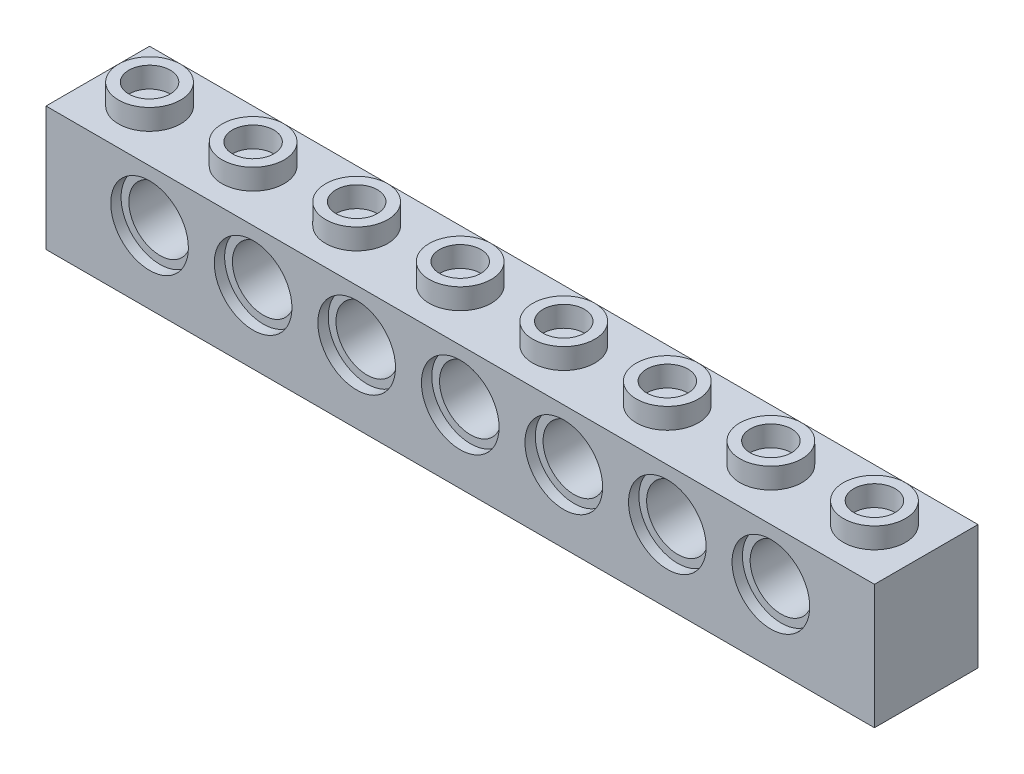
ISO-10303-21;
HEADER;
FILE_DESCRIPTION(('STEP AP214'),'2;1');
FILE_NAME('part.step','',(''),(''),'','','');
FILE_SCHEMA(('AUTOMOTIVE_DESIGN { 1 0 10303 214 1 1 1 1 }'));
ENDSEC;
DATA;
#1=APPLICATION_CONTEXT('core data for automotive mechanical design processes');
#2=APPLICATION_PROTOCOL_DEFINITION('international standard','automotive_design',2000,#1);
#3=PRODUCT_CONTEXT('',#1,'mechanical');
#4=PRODUCT('Part','Part','',(#3));
#5=PRODUCT_RELATED_PRODUCT_CATEGORY('part','',(#4));
#6=PRODUCT_DEFINITION_FORMATION('','',#4);
#7=PRODUCT_DEFINITION_CONTEXT('part definition',#1,'design');
#8=PRODUCT_DEFINITION('design','',#6,#7);
#9=PRODUCT_DEFINITION_SHAPE('','',#8);
#10=(LENGTH_UNIT() NAMED_UNIT(*) SI_UNIT(.MILLI.,.METRE.));
#11=(NAMED_UNIT(*) PLANE_ANGLE_UNIT() SI_UNIT($,.RADIAN.));
#12=(NAMED_UNIT(*) SI_UNIT($,.STERADIAN.) SOLID_ANGLE_UNIT());
#13=UNCERTAINTY_MEASURE_WITH_UNIT(LENGTH_MEASURE(1.E-05),#10,'distance_accuracy_value','');
#14=(GEOMETRIC_REPRESENTATION_CONTEXT(3) GLOBAL_UNCERTAINTY_ASSIGNED_CONTEXT((#13)) GLOBAL_UNIT_ASSIGNED_CONTEXT((#10,
#11,#12)) REPRESENTATION_CONTEXT('',''));
#15=CARTESIAN_POINT('',(0.,0.,0.));
#16=DIRECTION('',(0.,0.,1.));
#17=DIRECTION('',(1.,0.,0.));
#18=AXIS2_PLACEMENT_3D('',#15,#16,#17);
#19=CARTESIAN_POINT('',(0.,5.6,-4.));
#20=DIRECTION('',(0.,0.,1.));
#21=DIRECTION('',(1.,0.,0.));
#22=AXIS2_PLACEMENT_3D('',#19,#20,#21);
#23=CYLINDRICAL_SURFACE('',#22,2.4);
#24=CARTESIAN_POINT('',(0.,5.6,3.2));
#25=DIRECTION('',(0.,0.,1.));
#26=DIRECTION('',(1.,0.,0.));
#27=AXIS2_PLACEMENT_3D('',#24,#25,#26);
#28=CIRCLE('',#27,2.4);
#29=CARTESIAN_POINT('',(2.4,5.6,3.2));
#30=VERTEX_POINT('',#29);
#31=EDGE_CURVE('E277',#30,#30,#28,.F.);
#32=ORIENTED_EDGE('',*,*,#31,.F.);
#33=EDGE_LOOP('',(#32));
#34=FACE_BOUND('',#33,.T.);
#35=CARTESIAN_POINT('',(0.,5.6,-3.2));
#36=DIRECTION('',(0.,0.,-1.));
#37=DIRECTION('',(-1.,0.,0.));
#38=AXIS2_PLACEMENT_3D('',#35,#36,#37);
#39=CIRCLE('',#38,2.4);
#40=CARTESIAN_POINT('',(-2.4,5.6,-3.2));
#41=VERTEX_POINT('',#40);
#42=EDGE_CURVE('E386',#41,#41,#39,.F.);
#43=ORIENTED_EDGE('',*,*,#42,.F.);
#44=EDGE_LOOP('',(#43));
#45=FACE_BOUND('',#44,.T.);
#46=ADVANCED_FACE('F34',(#34,#45),#23,.F.);
#47=CARTESIAN_POINT('',(-8.,5.59999999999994,-4.));
#48=DIRECTION('',(0.,0.,1.));
#49=DIRECTION('',(1.,0.,0.));
#50=AXIS2_PLACEMENT_3D('',#47,#48,#49);
#51=CYLINDRICAL_SURFACE('',#50,2.4);
#52=CARTESIAN_POINT('',(-8.,5.59999999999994,3.2));
#53=DIRECTION('',(0.,0.,1.));
#54=DIRECTION('',(1.,0.,0.));
#55=AXIS2_PLACEMENT_3D('',#52,#53,#54);
#56=CIRCLE('',#55,2.4);
#57=CARTESIAN_POINT('',(-5.6,5.59999999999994,3.2));
#58=VERTEX_POINT('',#57);
#59=EDGE_CURVE('E362',#58,#58,#56,.F.);
#60=ORIENTED_EDGE('',*,*,#59,.F.);
#61=EDGE_LOOP('',(#60));
#62=FACE_BOUND('',#61,.T.);
#63=CARTESIAN_POINT('',(-8.,5.59999999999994,-3.2));
#64=DIRECTION('',(0.,0.,-1.));
#65=DIRECTION('',(-1.,0.,0.));
#66=AXIS2_PLACEMENT_3D('',#63,#64,#65);
#67=CIRCLE('',#66,2.4);
#68=CARTESIAN_POINT('',(-10.4,5.59999999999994,-3.2));
#69=VERTEX_POINT('',#68);
#70=EDGE_CURVE('E383',#69,#69,#67,.F.);
#71=ORIENTED_EDGE('',*,*,#70,.F.);
#72=EDGE_LOOP('',(#71));
#73=FACE_BOUND('',#72,.T.);
#74=ADVANCED_FACE('F722',(#62,#73),#51,.F.);
#75=CARTESIAN_POINT('',(24.,5.6,-4.));
#76=DIRECTION('',(0.,0.,1.));
#77=DIRECTION('',(1.,0.,0.));
#78=AXIS2_PLACEMENT_3D('',#75,#76,#77);
#79=CYLINDRICAL_SURFACE('',#78,2.4);
#80=CARTESIAN_POINT('',(24.,5.6,3.2));
#81=DIRECTION('',(0.,0.,1.));
#82=DIRECTION('',(1.,0.,0.));
#83=AXIS2_PLACEMENT_3D('',#80,#81,#82);
#84=CIRCLE('',#83,2.4);
#85=CARTESIAN_POINT('',(26.4,5.6,3.2));
#86=VERTEX_POINT('',#85);
#87=EDGE_CURVE('E359',#86,#86,#84,.F.);
#88=ORIENTED_EDGE('',*,*,#87,.F.);
#89=EDGE_LOOP('',(#88));
#90=FACE_BOUND('',#89,.T.);
#91=CARTESIAN_POINT('',(24.,5.6,-3.2));
#92=DIRECTION('',(0.,0.,-1.));
#93=DIRECTION('',(-1.,0.,0.));
#94=AXIS2_PLACEMENT_3D('',#91,#92,#93);
#95=CIRCLE('',#94,2.4);
#96=CARTESIAN_POINT('',(21.6,5.6,-3.2));
#97=VERTEX_POINT('',#96);
#98=EDGE_CURVE('E380',#97,#97,#95,.F.);
#99=ORIENTED_EDGE('',*,*,#98,.F.);
#100=EDGE_LOOP('',(#99));
#101=FACE_BOUND('',#100,.T.);
#102=ADVANCED_FACE('F728',(#90,#101),#79,.F.);
#103=CARTESIAN_POINT('',(16.,5.6,-4.));
#104=DIRECTION('',(0.,0.,1.));
#105=DIRECTION('',(1.,0.,0.));
#106=AXIS2_PLACEMENT_3D('',#103,#104,#105);
#107=CYLINDRICAL_SURFACE('',#106,2.4);
#108=CARTESIAN_POINT('',(16.,5.6,3.2));
#109=DIRECTION('',(0.,0.,1.));
#110=DIRECTION('',(1.,0.,0.));
#111=AXIS2_PLACEMENT_3D('',#108,#109,#110);
#112=CIRCLE('',#111,2.4);
#113=CARTESIAN_POINT('',(18.4,5.6,3.2));
#114=VERTEX_POINT('',#113);
#115=EDGE_CURVE('E356',#114,#114,#112,.F.);
#116=ORIENTED_EDGE('',*,*,#115,.F.);
#117=EDGE_LOOP('',(#116));
#118=FACE_BOUND('',#117,.T.);
#119=CARTESIAN_POINT('',(16.,5.6,-3.2));
#120=DIRECTION('',(0.,0.,-1.));
#121=DIRECTION('',(-1.,0.,0.));
#122=AXIS2_PLACEMENT_3D('',#119,#120,#121);
#123=CIRCLE('',#122,2.4);
#124=CARTESIAN_POINT('',(13.6,5.6,-3.2));
#125=VERTEX_POINT('',#124);
#126=EDGE_CURVE('E377',#125,#125,#123,.F.);
#127=ORIENTED_EDGE('',*,*,#126,.F.);
#128=EDGE_LOOP('',(#127));
#129=FACE_BOUND('',#128,.T.);
#130=ADVANCED_FACE('F1069',(#118,#129),#107,.F.);
#131=CARTESIAN_POINT('',(8.,5.6,-4.));
#132=DIRECTION('',(0.,0.,1.));
#133=DIRECTION('',(1.,0.,0.));
#134=AXIS2_PLACEMENT_3D('',#131,#132,#133);
#135=CYLINDRICAL_SURFACE('',#134,2.4);
#136=CARTESIAN_POINT('',(8.,5.6,3.2));
#137=DIRECTION('',(0.,0.,1.));
#138=DIRECTION('',(1.,0.,0.));
#139=AXIS2_PLACEMENT_3D('',#136,#137,#138);
#140=CIRCLE('',#139,2.4);
#141=CARTESIAN_POINT('',(10.4,5.6,3.2));
#142=VERTEX_POINT('',#141);
#143=EDGE_CURVE('E353',#142,#142,#140,.F.);
#144=ORIENTED_EDGE('',*,*,#143,.F.);
#145=EDGE_LOOP('',(#144));
#146=FACE_BOUND('',#145,.T.);
#147=CARTESIAN_POINT('',(8.,5.6,-3.2));
#148=DIRECTION('',(0.,0.,-1.));
#149=DIRECTION('',(-1.,0.,0.));
#150=AXIS2_PLACEMENT_3D('',#147,#148,#149);
#151=CIRCLE('',#150,2.4);
#152=CARTESIAN_POINT('',(5.6,5.6,-3.2));
#153=VERTEX_POINT('',#152);
#154=EDGE_CURVE('E374',#153,#153,#151,.F.);
#155=ORIENTED_EDGE('',*,*,#154,.F.);
#156=EDGE_LOOP('',(#155));
#157=FACE_BOUND('',#156,.T.);
#158=ADVANCED_FACE('F1075',(#146,#157),#135,.F.);
#159=CARTESIAN_POINT('',(-16.,5.59999999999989,-4.));
#160=DIRECTION('',(0.,0.,1.));
#161=DIRECTION('',(1.,0.,0.));
#162=AXIS2_PLACEMENT_3D('',#159,#160,#161);
#163=CYLINDRICAL_SURFACE('',#162,2.4);
#164=CARTESIAN_POINT('',(-16.,5.59999999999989,3.2));
#165=DIRECTION('',(0.,0.,1.));
#166=DIRECTION('',(1.,0.,0.));
#167=AXIS2_PLACEMENT_3D('',#164,#165,#166);
#168=CIRCLE('',#167,2.4);
#169=CARTESIAN_POINT('',(-13.6,5.59999999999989,3.2));
#170=VERTEX_POINT('',#169);
#171=EDGE_CURVE('E349',#170,#170,#168,.F.);
#172=ORIENTED_EDGE('',*,*,#171,.F.);
#173=EDGE_LOOP('',(#172));
#174=FACE_BOUND('',#173,.T.);
#175=CARTESIAN_POINT('',(-16.,5.59999999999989,-3.2));
#176=DIRECTION('',(0.,0.,-1.));
#177=DIRECTION('',(-1.,0.,0.));
#178=AXIS2_PLACEMENT_3D('',#175,#176,#177);
#179=CIRCLE('',#178,2.4);
#180=CARTESIAN_POINT('',(-18.4,5.59999999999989,-3.2));
#181=VERTEX_POINT('',#180);
#182=EDGE_CURVE('E370',#181,#181,#179,.F.);
#183=ORIENTED_EDGE('',*,*,#182,.F.);
#184=EDGE_LOOP('',(#183));
#185=FACE_BOUND('',#184,.T.);
#186=ADVANCED_FACE('F1080',(#174,#185),#163,.F.);
#187=CARTESIAN_POINT('',(-24.,5.59999999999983,-4.));
#188=DIRECTION('',(0.,0.,1.));
#189=DIRECTION('',(1.,0.,0.));
#190=AXIS2_PLACEMENT_3D('',#187,#188,#189);
#191=CYLINDRICAL_SURFACE('',#190,2.4);
#192=CARTESIAN_POINT('',(-24.,5.59999999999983,3.2));
#193=DIRECTION('',(0.,0.,1.));
#194=DIRECTION('',(1.,0.,0.));
#195=AXIS2_PLACEMENT_3D('',#192,#193,#194);
#196=CIRCLE('',#195,2.4);
#197=CARTESIAN_POINT('',(-21.6,5.59999999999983,3.2));
#198=VERTEX_POINT('',#197);
#199=EDGE_CURVE('E346',#198,#198,#196,.F.);
#200=ORIENTED_EDGE('',*,*,#199,.F.);
#201=EDGE_LOOP('',(#200));
#202=FACE_BOUND('',#201,.T.);
#203=CARTESIAN_POINT('',(-24.,5.59999999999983,-3.2));
#204=DIRECTION('',(0.,0.,-1.));
#205=DIRECTION('',(-1.,0.,0.));
#206=AXIS2_PLACEMENT_3D('',#203,#204,#205);
#207=CIRCLE('',#206,2.4);
#208=CARTESIAN_POINT('',(-26.4,5.59999999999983,-3.2));
#209=VERTEX_POINT('',#208);
#210=EDGE_CURVE('E367',#209,#209,#207,.F.);
#211=ORIENTED_EDGE('',*,*,#210,.F.);
#212=EDGE_LOOP('',(#211));
#213=FACE_BOUND('',#212,.T.);
#214=ADVANCED_FACE('F735',(#202,#213),#191,.F.);
#215=CARTESIAN_POINT('',(0.,0.,0.));
#216=DIRECTION('',(0.,-1.,0.));
#217=DIRECTION('',(0.,0.,-1.));
#218=AXIS2_PLACEMENT_3D('',#215,#216,#217);
#219=PLANE('',#218);
#220=DIRECTION('',(0.,0.,-1.));
#221=VECTOR('',#220,1.);
#222=CARTESIAN_POINT('',(32.,0.,4.));
#223=LINE('',#222,#221);
#224=CARTESIAN_POINT('',(32.,0.,4.));
#225=VERTEX_POINT('',#224);
#226=CARTESIAN_POINT('',(32.,0.,-4.));
#227=VERTEX_POINT('',#226);
#228=EDGE_CURVE('E322',#225,#227,#223,.T.);
#229=ORIENTED_EDGE('',*,*,#228,.F.);
#230=DIRECTION('',(1.,0.,0.));
#231=VECTOR('',#230,1.);
#232=CARTESIAN_POINT('',(-32.,0.,4.));
#233=LINE('',#232,#231);
#234=CARTESIAN_POINT('',(-32.,0.,4.));
#235=VERTEX_POINT('',#234);
#236=EDGE_CURVE('E84',#235,#225,#233,.T.);
#237=ORIENTED_EDGE('',*,*,#236,.F.);
#238=DIRECTION('',(0.,0.,1.));
#239=VECTOR('',#238,1.);
#240=CARTESIAN_POINT('',(-32.,0.,4.));
#241=LINE('',#240,#239);
#242=CARTESIAN_POINT('',(-32.,0.,-4.));
#243=VERTEX_POINT('',#242);
#244=EDGE_CURVE('E334',#243,#235,#241,.T.);
#245=ORIENTED_EDGE('',*,*,#244,.F.);
#246=DIRECTION('',(-1.,0.,0.));
#247=VECTOR('',#246,1.);
#248=CARTESIAN_POINT('',(-32.,0.,-4.));
#249=LINE('',#248,#247);
#250=EDGE_CURVE('E332',#227,#243,#249,.T.);
#251=ORIENTED_EDGE('',*,*,#250,.F.);
#252=EDGE_LOOP('',(#229,#237,#245,#251));
#253=FACE_BOUND('',#252,.T.);
#254=DIRECTION('',(1.,0.,0.));
#255=VECTOR('',#254,1.);
#256=CARTESIAN_POINT('',(0.,0.,2.4));
#257=LINE('',#256,#255);
#258=CARTESIAN_POINT('',(-30.4,0.,2.4));
#259=VERTEX_POINT('',#258);
#260=CARTESIAN_POINT('',(30.4,0.,2.4));
#261=VERTEX_POINT('',#260);
#262=EDGE_CURVE('E220',#259,#261,#257,.T.);
#263=ORIENTED_EDGE('',*,*,#262,.T.);
#264=DIRECTION('',(0.,0.,-1.));
#265=VECTOR('',#264,1.);
#266=CARTESIAN_POINT('',(30.4,0.,0.));
#267=LINE('',#266,#265);
#268=CARTESIAN_POINT('',(30.4,0.,-2.4));
#269=VERTEX_POINT('',#268);
#270=EDGE_CURVE('E265',#261,#269,#267,.T.);
#271=ORIENTED_EDGE('',*,*,#270,.T.);
#272=DIRECTION('',(-1.,0.,0.));
#273=VECTOR('',#272,1.);
#274=CARTESIAN_POINT('',(0.,0.,-2.4));
#275=LINE('',#274,#273);
#276=CARTESIAN_POINT('',(-30.4,0.,-2.4));
#277=VERTEX_POINT('',#276);
#278=EDGE_CURVE('E225',#269,#277,#275,.T.);
#279=ORIENTED_EDGE('',*,*,#278,.T.);
#280=DIRECTION('',(0.,0.,1.));
#281=VECTOR('',#280,1.);
#282=CARTESIAN_POINT('',(-30.4,0.,0.));
#283=LINE('',#282,#281);
#284=EDGE_CURVE('E54',#277,#259,#283,.T.);
#285=ORIENTED_EDGE('',*,*,#284,.T.);
#286=EDGE_LOOP('',(#263,#271,#279,#285));
#287=FACE_BOUND('',#286,.T.);
#288=ADVANCED_FACE('F742',(#253,#287),#219,.T.);
#289=CARTESIAN_POINT('',(32.,9.6,4.));
#290=DIRECTION('',(-1.,0.,0.));
#291=DIRECTION('',(0.,0.,1.));
#292=AXIS2_PLACEMENT_3D('',#289,#290,#291);
#293=PLANE('',#292);
#294=ORIENTED_EDGE('',*,*,#228,.T.);
#295=DIRECTION('',(0.,-1.,0.));
#296=VECTOR('',#295,1.);
#297=CARTESIAN_POINT('',(32.,9.6,-4.));
#298=LINE('',#297,#296);
#299=CARTESIAN_POINT('',(32.,9.6,-4.));
#300=VERTEX_POINT('',#299);
#301=EDGE_CURVE('E343',#300,#227,#298,.T.);
#302=ORIENTED_EDGE('',*,*,#301,.F.);
#303=DIRECTION('',(0.,0.,-1.));
#304=VECTOR('',#303,1.);
#305=CARTESIAN_POINT('',(32.,9.6,4.));
#306=LINE('',#305,#304);
#307=CARTESIAN_POINT('',(32.,9.6,4.));
#308=VERTEX_POINT('',#307);
#309=EDGE_CURVE('E323',#308,#300,#306,.T.);
#310=ORIENTED_EDGE('',*,*,#309,.F.);
#311=DIRECTION('',(0.,-1.,0.));
#312=VECTOR('',#311,1.);
#313=CARTESIAN_POINT('',(32.,9.6,4.));
#314=LINE('',#313,#312);
#315=EDGE_CURVE('E329',#308,#225,#314,.T.);
#316=ORIENTED_EDGE('',*,*,#315,.T.);
#317=EDGE_LOOP('',(#294,#302,#310,#316));
#318=FACE_BOUND('',#317,.T.);
#319=ADVANCED_FACE('F36',(#318),#293,.F.);
#320=CARTESIAN_POINT('',(-32.,9.6,-4.));
#321=DIRECTION('',(0.,0.,1.));
#322=DIRECTION('',(1.,0.,0.));
#323=AXIS2_PLACEMENT_3D('',#320,#321,#322);
#324=PLANE('',#323);
#325=CARTESIAN_POINT('',(-24.,5.59999999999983,-4.));
#326=DIRECTION('',(0.,0.,1.));
#327=DIRECTION('',(1.,0.,0.));
#328=AXIS2_PLACEMENT_3D('',#325,#326,#327);
#329=CIRCLE('',#328,3.);
#330=CARTESIAN_POINT('',(-21.,5.59999999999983,-4.));
#331=VERTEX_POINT('',#330);
#332=EDGE_CURVE('E762',#331,#331,#329,.T.);
#333=ORIENTED_EDGE('',*,*,#332,.T.);
#334=EDGE_LOOP('',(#333));
#335=FACE_BOUND('',#334,.T.);
#336=CARTESIAN_POINT('',(-16.,5.59999999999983,-4.));
#337=DIRECTION('',(0.,0.,1.));
#338=DIRECTION('',(1.,0.,0.));
#339=AXIS2_PLACEMENT_3D('',#336,#337,#338);
#340=CIRCLE('',#339,3.);
#341=CARTESIAN_POINT('',(-13.,5.59999999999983,-4.));
#342=VERTEX_POINT('',#341);
#343=EDGE_CURVE('E766',#342,#342,#340,.T.);
#344=ORIENTED_EDGE('',*,*,#343,.T.);
#345=EDGE_LOOP('',(#344));
#346=FACE_BOUND('',#345,.T.);
#347=CARTESIAN_POINT('',(-8.,5.59999999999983,-4.));
#348=DIRECTION('',(0.,0.,1.));
#349=DIRECTION('',(1.,0.,0.));
#350=AXIS2_PLACEMENT_3D('',#347,#348,#349);
#351=CIRCLE('',#350,3.);
#352=CARTESIAN_POINT('',(-5.,5.59999999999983,-4.));
#353=VERTEX_POINT('',#352);
#354=EDGE_CURVE('E770',#353,#353,#351,.T.);
#355=ORIENTED_EDGE('',*,*,#354,.T.);
#356=EDGE_LOOP('',(#355));
#357=FACE_BOUND('',#356,.T.);
#358=CARTESIAN_POINT('',(0.,5.59999999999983,-4.));
#359=DIRECTION('',(0.,0.,1.));
#360=DIRECTION('',(1.,0.,0.));
#361=AXIS2_PLACEMENT_3D('',#358,#359,#360);
#362=CIRCLE('',#361,3.);
#363=CARTESIAN_POINT('',(3.,5.59999999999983,-4.));
#364=VERTEX_POINT('',#363);
#365=EDGE_CURVE('E774',#364,#364,#362,.T.);
#366=ORIENTED_EDGE('',*,*,#365,.T.);
#367=EDGE_LOOP('',(#366));
#368=FACE_BOUND('',#367,.T.);
#369=CARTESIAN_POINT('',(8.,5.59999999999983,-4.));
#370=DIRECTION('',(0.,0.,1.));
#371=DIRECTION('',(1.,0.,0.));
#372=AXIS2_PLACEMENT_3D('',#369,#370,#371);
#373=CIRCLE('',#372,3.);
#374=CARTESIAN_POINT('',(11.,5.59999999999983,-4.));
#375=VERTEX_POINT('',#374);
#376=EDGE_CURVE('E778',#375,#375,#373,.T.);
#377=ORIENTED_EDGE('',*,*,#376,.T.);
#378=EDGE_LOOP('',(#377));
#379=FACE_BOUND('',#378,.T.);
#380=CARTESIAN_POINT('',(16.,5.59999999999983,-4.));
#381=DIRECTION('',(0.,0.,1.));
#382=DIRECTION('',(1.,0.,0.));
#383=AXIS2_PLACEMENT_3D('',#380,#381,#382);
#384=CIRCLE('',#383,3.);
#385=CARTESIAN_POINT('',(19.,5.59999999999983,-4.));
#386=VERTEX_POINT('',#385);
#387=EDGE_CURVE('E782',#386,#386,#384,.T.);
#388=ORIENTED_EDGE('',*,*,#387,.T.);
#389=EDGE_LOOP('',(#388));
#390=FACE_BOUND('',#389,.T.);
#391=CARTESIAN_POINT('',(24.,5.59999999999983,-4.));
#392=DIRECTION('',(0.,0.,1.));
#393=DIRECTION('',(1.,0.,0.));
#394=AXIS2_PLACEMENT_3D('',#391,#392,#393);
#395=CIRCLE('',#394,3.);
#396=CARTESIAN_POINT('',(27.,5.59999999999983,-4.));
#397=VERTEX_POINT('',#396);
#398=EDGE_CURVE('E785',#397,#397,#395,.T.);
#399=ORIENTED_EDGE('',*,*,#398,.T.);
#400=EDGE_LOOP('',(#399));
#401=FACE_BOUND('',#400,.T.);
#402=ORIENTED_EDGE('',*,*,#250,.T.);
#403=DIRECTION('',(0.,-1.,0.));
#404=VECTOR('',#403,1.);
#405=CARTESIAN_POINT('',(-32.,9.6,-4.));
#406=LINE('',#405,#404);
#407=CARTESIAN_POINT('',(-32.,9.6,-4.));
#408=VERTEX_POINT('',#407);
#409=EDGE_CURVE('E340',#408,#243,#406,.T.);
#410=ORIENTED_EDGE('',*,*,#409,.F.);
#411=DIRECTION('',(-1.,0.,0.));
#412=VECTOR('',#411,1.);
#413=CARTESIAN_POINT('',(-32.,9.6,-4.));
#414=LINE('',#413,#412);
#415=EDGE_CURVE('E92',#300,#408,#414,.T.);
#416=ORIENTED_EDGE('',*,*,#415,.F.);
#417=ORIENTED_EDGE('',*,*,#301,.T.);
#418=EDGE_LOOP('',(#402,#410,#416,#417));
#419=FACE_BOUND('',#418,.T.);
#420=ADVANCED_FACE('F751',(#335,#346,#357,#368,#379,#390,#401,#419),#324,.F.);
#421=CARTESIAN_POINT('',(-32.,9.6,4.));
#422=DIRECTION('',(1.,0.,0.));
#423=DIRECTION('',(0.,0.,-1.));
#424=AXIS2_PLACEMENT_3D('',#421,#422,#423);
#425=PLANE('',#424);
#426=ORIENTED_EDGE('',*,*,#244,.T.);
#427=DIRECTION('',(0.,-1.,0.));
#428=VECTOR('',#427,1.);
#429=CARTESIAN_POINT('',(-32.,9.6,4.));
#430=LINE('',#429,#428);
#431=CARTESIAN_POINT('',(-32.,9.6,4.));
#432=VERTEX_POINT('',#431);
#433=EDGE_CURVE('E338',#432,#235,#430,.T.);
#434=ORIENTED_EDGE('',*,*,#433,.F.);
#435=DIRECTION('',(0.,0.,1.));
#436=VECTOR('',#435,1.);
#437=CARTESIAN_POINT('',(-32.,9.6,4.));
#438=LINE('',#437,#436);
#439=EDGE_CURVE('E326',#408,#432,#438,.T.);
#440=ORIENTED_EDGE('',*,*,#439,.F.);
#441=ORIENTED_EDGE('',*,*,#409,.T.);
#442=EDGE_LOOP('',(#426,#434,#440,#441));
#443=FACE_BOUND('',#442,.T.);
#444=ADVANCED_FACE('F748',(#443),#425,.F.);
#445=CARTESIAN_POINT('',(-32.,9.6,4.));
#446=DIRECTION('',(0.,0.,-1.));
#447=DIRECTION('',(-1.,0.,0.));
#448=AXIS2_PLACEMENT_3D('',#445,#446,#447);
#449=PLANE('',#448);
#450=CARTESIAN_POINT('',(-24.,5.59999999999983,4.));
#451=DIRECTION('',(0.,0.,1.));
#452=DIRECTION('',(1.,0.,0.));
#453=AXIS2_PLACEMENT_3D('',#450,#451,#452);
#454=CIRCLE('',#453,3.);
#455=CARTESIAN_POINT('',(-21.,5.59999999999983,4.));
#456=VERTEX_POINT('',#455);
#457=EDGE_CURVE('E1025',#456,#456,#454,.T.);
#458=ORIENTED_EDGE('',*,*,#457,.F.);
#459=EDGE_LOOP('',(#458));
#460=FACE_BOUND('',#459,.T.);
#461=CARTESIAN_POINT('',(-16.,5.59999999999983,4.));
#462=DIRECTION('',(0.,0.,1.));
#463=DIRECTION('',(1.,0.,0.));
#464=AXIS2_PLACEMENT_3D('',#461,#462,#463);
#465=CIRCLE('',#464,3.);
#466=CARTESIAN_POINT('',(-13.,5.59999999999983,4.));
#467=VERTEX_POINT('',#466);
#468=EDGE_CURVE('E1031',#467,#467,#465,.T.);
#469=ORIENTED_EDGE('',*,*,#468,.F.);
#470=EDGE_LOOP('',(#469));
#471=FACE_BOUND('',#470,.T.);
#472=CARTESIAN_POINT('',(-8.,5.59999999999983,4.));
#473=DIRECTION('',(0.,0.,1.));
#474=DIRECTION('',(1.,0.,0.));
#475=AXIS2_PLACEMENT_3D('',#472,#473,#474);
#476=CIRCLE('',#475,3.);
#477=CARTESIAN_POINT('',(-5.,5.59999999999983,4.));
#478=VERTEX_POINT('',#477);
#479=EDGE_CURVE('E1037',#478,#478,#476,.T.);
#480=ORIENTED_EDGE('',*,*,#479,.F.);
#481=EDGE_LOOP('',(#480));
#482=FACE_BOUND('',#481,.T.);
#483=CARTESIAN_POINT('',(0.,5.59999999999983,4.));
#484=DIRECTION('',(0.,0.,1.));
#485=DIRECTION('',(1.,0.,0.));
#486=AXIS2_PLACEMENT_3D('',#483,#484,#485);
#487=CIRCLE('',#486,3.);
#488=CARTESIAN_POINT('',(3.,5.59999999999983,4.));
#489=VERTEX_POINT('',#488);
#490=EDGE_CURVE('E1043',#489,#489,#487,.T.);
#491=ORIENTED_EDGE('',*,*,#490,.F.);
#492=EDGE_LOOP('',(#491));
#493=FACE_BOUND('',#492,.T.);
#494=CARTESIAN_POINT('',(8.,5.59999999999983,4.));
#495=DIRECTION('',(0.,0.,1.));
#496=DIRECTION('',(1.,0.,0.));
#497=AXIS2_PLACEMENT_3D('',#494,#495,#496);
#498=CIRCLE('',#497,3.);
#499=CARTESIAN_POINT('',(11.,5.59999999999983,4.));
#500=VERTEX_POINT('',#499);
#501=EDGE_CURVE('E1049',#500,#500,#498,.T.);
#502=ORIENTED_EDGE('',*,*,#501,.F.);
#503=EDGE_LOOP('',(#502));
#504=FACE_BOUND('',#503,.T.);
#505=CARTESIAN_POINT('',(16.,5.59999999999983,4.));
#506=DIRECTION('',(0.,0.,1.));
#507=DIRECTION('',(1.,0.,0.));
#508=AXIS2_PLACEMENT_3D('',#505,#506,#507);
#509=CIRCLE('',#508,3.);
#510=CARTESIAN_POINT('',(19.,5.59999999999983,4.));
#511=VERTEX_POINT('',#510);
#512=EDGE_CURVE('E1055',#511,#511,#509,.T.);
#513=ORIENTED_EDGE('',*,*,#512,.F.);
#514=EDGE_LOOP('',(#513));
#515=FACE_BOUND('',#514,.T.);
#516=CARTESIAN_POINT('',(24.,5.59999999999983,4.));
#517=DIRECTION('',(0.,0.,1.));
#518=DIRECTION('',(1.,0.,0.));
#519=AXIS2_PLACEMENT_3D('',#516,#517,#518);
#520=CIRCLE('',#519,3.);
#521=CARTESIAN_POINT('',(27.,5.59999999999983,4.));
#522=VERTEX_POINT('',#521);
#523=EDGE_CURVE('E234',#522,#522,#520,.T.);
#524=ORIENTED_EDGE('',*,*,#523,.F.);
#525=EDGE_LOOP('',(#524));
#526=FACE_BOUND('',#525,.T.);
#527=ORIENTED_EDGE('',*,*,#236,.T.);
#528=ORIENTED_EDGE('',*,*,#315,.F.);
#529=DIRECTION('',(1.,0.,0.));
#530=VECTOR('',#529,1.);
#531=CARTESIAN_POINT('',(-32.,9.6,4.));
#532=LINE('',#531,#530);
#533=EDGE_CURVE('E63',#432,#308,#532,.T.);
#534=ORIENTED_EDGE('',*,*,#533,.F.);
#535=ORIENTED_EDGE('',*,*,#433,.T.);
#536=EDGE_LOOP('',(#527,#528,#534,#535));
#537=FACE_BOUND('',#536,.T.);
#538=ADVANCED_FACE('F740',(#460,#471,#482,#493,#504,#515,#526,#537),#449,.F.);
#539=CARTESIAN_POINT('',(0.,9.6,0.));
#540=DIRECTION('',(0.,-1.,0.));
#541=DIRECTION('',(0.,0.,-1.));
#542=AXIS2_PLACEMENT_3D('',#539,#540,#541);
#543=PLANE('',#542);
#544=CARTESIAN_POINT('',(28.,9.6,0.));
#545=DIRECTION('',(0.,-1.,0.));
#546=DIRECTION('',(0.,0.,-1.));
#547=AXIS2_PLACEMENT_3D('',#544,#545,#546);
#548=CIRCLE('',#547,2.4);
#549=CARTESIAN_POINT('',(28.,9.6,-2.4));
#550=VERTEX_POINT('',#549);
#551=EDGE_CURVE('E409',#550,#550,#548,.F.);
#552=ORIENTED_EDGE('',*,*,#551,.F.);
#553=EDGE_LOOP('',(#552));
#554=FACE_BOUND('',#553,.T.);
#555=CARTESIAN_POINT('',(20.,9.6,0.));
#556=DIRECTION('',(0.,-1.,0.));
#557=DIRECTION('',(0.,0.,-1.));
#558=AXIS2_PLACEMENT_3D('',#555,#556,#557);
#559=CIRCLE('',#558,2.4);
#560=CARTESIAN_POINT('',(20.,9.6,-2.4));
#561=VERTEX_POINT('',#560);
#562=EDGE_CURVE('E406',#561,#561,#559,.F.);
#563=ORIENTED_EDGE('',*,*,#562,.F.);
#564=EDGE_LOOP('',(#563));
#565=FACE_BOUND('',#564,.T.);
#566=CARTESIAN_POINT('',(12.,9.6,0.));
#567=DIRECTION('',(0.,-1.,0.));
#568=DIRECTION('',(0.,0.,-1.));
#569=AXIS2_PLACEMENT_3D('',#566,#567,#568);
#570=CIRCLE('',#569,2.4);
#571=CARTESIAN_POINT('',(12.,9.6,-2.4));
#572=VERTEX_POINT('',#571);
#573=EDGE_CURVE('E403',#572,#572,#570,.F.);
#574=ORIENTED_EDGE('',*,*,#573,.F.);
#575=EDGE_LOOP('',(#574));
#576=FACE_BOUND('',#575,.T.);
#577=CARTESIAN_POINT('',(4.,9.6,0.));
#578=DIRECTION('',(0.,-1.,0.));
#579=DIRECTION('',(0.,0.,-1.));
#580=AXIS2_PLACEMENT_3D('',#577,#578,#579);
#581=CIRCLE('',#580,2.4);
#582=CARTESIAN_POINT('',(4.,9.6,-2.4));
#583=VERTEX_POINT('',#582);
#584=EDGE_CURVE('E400',#583,#583,#581,.F.);
#585=ORIENTED_EDGE('',*,*,#584,.F.);
#586=EDGE_LOOP('',(#585));
#587=FACE_BOUND('',#586,.T.);
#588=CARTESIAN_POINT('',(-4.,9.6,0.));
#589=DIRECTION('',(0.,-1.,0.));
#590=DIRECTION('',(0.,0.,-1.));
#591=AXIS2_PLACEMENT_3D('',#588,#589,#590);
#592=CIRCLE('',#591,2.4);
#593=CARTESIAN_POINT('',(-4.,9.6,-2.4));
#594=VERTEX_POINT('',#593);
#595=EDGE_CURVE('E397',#594,#594,#592,.F.);
#596=ORIENTED_EDGE('',*,*,#595,.F.);
#597=EDGE_LOOP('',(#596));
#598=FACE_BOUND('',#597,.T.);
#599=CARTESIAN_POINT('',(-12.,9.6,0.));
#600=DIRECTION('',(0.,-1.,0.));
#601=DIRECTION('',(0.,0.,-1.));
#602=AXIS2_PLACEMENT_3D('',#599,#600,#601);
#603=CIRCLE('',#602,2.4);
#604=CARTESIAN_POINT('',(-12.,9.6,-2.4));
#605=VERTEX_POINT('',#604);
#606=EDGE_CURVE('E394',#605,#605,#603,.F.);
#607=ORIENTED_EDGE('',*,*,#606,.F.);
#608=EDGE_LOOP('',(#607));
#609=FACE_BOUND('',#608,.T.);
#610=CARTESIAN_POINT('',(-20.,9.6,0.));
#611=DIRECTION('',(0.,-1.,0.));
#612=DIRECTION('',(0.,0.,-1.));
#613=AXIS2_PLACEMENT_3D('',#610,#611,#612);
#614=CIRCLE('',#613,2.4);
#615=CARTESIAN_POINT('',(-20.,9.6,-2.4));
#616=VERTEX_POINT('',#615);
#617=EDGE_CURVE('E391',#616,#616,#614,.F.);
#618=ORIENTED_EDGE('',*,*,#617,.F.);
#619=EDGE_LOOP('',(#618));
#620=FACE_BOUND('',#619,.T.);
#621=CARTESIAN_POINT('',(-28.,9.6,0.));
#622=DIRECTION('',(0.,-1.,0.));
#623=DIRECTION('',(0.,0.,-1.));
#624=AXIS2_PLACEMENT_3D('',#621,#622,#623);
#625=CIRCLE('',#624,2.4);
#626=CARTESIAN_POINT('',(-28.,9.6,-2.4));
#627=VERTEX_POINT('',#626);
#628=EDGE_CURVE('E345',#627,#627,#625,.F.);
#629=ORIENTED_EDGE('',*,*,#628,.F.);
#630=EDGE_LOOP('',(#629));
#631=FACE_BOUND('',#630,.T.);
#632=ORIENTED_EDGE('',*,*,#309,.T.);
#633=ORIENTED_EDGE('',*,*,#415,.T.);
#634=ORIENTED_EDGE('',*,*,#439,.T.);
#635=ORIENTED_EDGE('',*,*,#533,.T.);
#636=EDGE_LOOP('',(#632,#633,#634,#635));
#637=FACE_BOUND('',#636,.T.);
#638=ADVANCED_FACE('F737',(#554,#565,#576,#587,#598,#609,#620,#631,#637),#543,.F.);
#639=CARTESIAN_POINT('',(0.,8.,0.));
#640=DIRECTION('',(0.,-1.,0.));
#641=DIRECTION('',(0.,0.,-1.));
#642=AXIS2_PLACEMENT_3D('',#639,#640,#641);
#643=PLANE('',#642);
#644=DIRECTION('',(1.,0.,0.));
#645=VECTOR('',#644,1.);
#646=CARTESIAN_POINT('',(0.,8.,2.4));
#647=LINE('',#646,#645);
#648=CARTESIAN_POINT('',(-30.4,8.,2.4));
#649=VERTEX_POINT('',#648);
#650=CARTESIAN_POINT('',(-26.6832815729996,8.,2.4));
#651=VERTEX_POINT('',#650);
#652=EDGE_CURVE('E274',#649,#651,#647,.T.);
#653=ORIENTED_EDGE('',*,*,#652,.F.);
#654=DIRECTION('',(0.,0.,1.));
#655=VECTOR('',#654,1.);
#656=CARTESIAN_POINT('',(-30.4,8.,0.));
#657=LINE('',#656,#655);
#658=CARTESIAN_POINT('',(-30.4,8.,-2.4));
#659=VERTEX_POINT('',#658);
#660=EDGE_CURVE('E268',#659,#649,#657,.T.);
#661=ORIENTED_EDGE('',*,*,#660,.F.);
#662=DIRECTION('',(-1.,0.,0.));
#663=VECTOR('',#662,1.);
#664=CARTESIAN_POINT('',(0.,8.,-2.4));
#665=LINE('',#664,#663);
#666=CARTESIAN_POINT('',(-26.6832815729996,8.,-2.4));
#667=VERTEX_POINT('',#666);
#668=EDGE_CURVE('E266',#667,#659,#665,.T.);
#669=ORIENTED_EDGE('',*,*,#668,.F.);
#670=DIRECTION('',(0.,0.,1.));
#671=VECTOR('',#670,1.);
#672=CARTESIAN_POINT('',(-26.6832815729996,8.,-4.));
#673=LINE('',#672,#671);
#674=EDGE_CURVE('E320',#651,#667,#673,.F.);
#675=ORIENTED_EDGE('',*,*,#674,.F.);
#676=EDGE_LOOP('',(#653,#661,#669,#675));
#677=FACE_BOUND('',#676,.T.);
#678=ADVANCED_FACE('F669',(#677),#643,.T.);
#679=DIRECTION('',(0.,0.,1.));
#680=VECTOR('',#679,1.);
#681=CARTESIAN_POINT('',(-21.3167184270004,8.,-4.));
#682=LINE('',#681,#680);
#683=CARTESIAN_POINT('',(-21.3167184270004,8.,2.4));
#684=VERTEX_POINT('',#683);
#685=CARTESIAN_POINT('',(-21.3167184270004,8.,-2.4));
#686=VERTEX_POINT('',#685);
#687=EDGE_CURVE('E318',#684,#686,#682,.F.);
#688=ORIENTED_EDGE('',*,*,#687,.T.);
#689=CARTESIAN_POINT('',(-18.6832815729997,8.,-2.4));
#690=VERTEX_POINT('',#689);
#691=EDGE_CURVE('E269',#690,#686,#665,.T.);
#692=ORIENTED_EDGE('',*,*,#691,.F.);
#693=DIRECTION('',(0.,0.,1.));
#694=VECTOR('',#693,1.);
#695=CARTESIAN_POINT('',(-18.6832815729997,8.,-4.));
#696=LINE('',#695,#694);
#697=CARTESIAN_POINT('',(-18.6832815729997,8.,2.4));
#698=VERTEX_POINT('',#697);
#699=EDGE_CURVE('E316',#698,#690,#696,.F.);
#700=ORIENTED_EDGE('',*,*,#699,.F.);
#701=EDGE_CURVE('E840',#684,#698,#647,.T.);
#702=ORIENTED_EDGE('',*,*,#701,.F.);
#703=EDGE_LOOP('',(#688,#692,#700,#702));
#704=FACE_BOUND('',#703,.T.);
#705=ADVANCED_FACE('F837',(#704),#643,.T.);
#706=CARTESIAN_POINT('',(2.68328157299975,8.,2.4));
#707=VERTEX_POINT('',#706);
#708=CARTESIAN_POINT('',(5.31671842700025,8.,2.4));
#709=VERTEX_POINT('',#708);
#710=EDGE_CURVE('E846',#707,#709,#647,.T.);
#711=ORIENTED_EDGE('',*,*,#710,.F.);
#712=DIRECTION('',(0.,0.,1.));
#713=VECTOR('',#712,1.);
#714=CARTESIAN_POINT('',(2.68328157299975,8.,-4.));
#715=LINE('',#714,#713);
#716=CARTESIAN_POINT('',(2.68328157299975,8.,-2.4));
#717=VERTEX_POINT('',#716);
#718=EDGE_CURVE('E226',#707,#717,#715,.F.);
#719=ORIENTED_EDGE('',*,*,#718,.T.);
#720=CARTESIAN_POINT('',(5.31671842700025,8.,-2.4));
#721=VERTEX_POINT('',#720);
#722=EDGE_CURVE('E270',#721,#717,#665,.T.);
#723=ORIENTED_EDGE('',*,*,#722,.F.);
#724=DIRECTION('',(0.,0.,1.));
#725=VECTOR('',#724,1.);
#726=CARTESIAN_POINT('',(5.31671842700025,8.,-4.));
#727=LINE('',#726,#725);
#728=EDGE_CURVE('E312',#709,#721,#727,.F.);
#729=ORIENTED_EDGE('',*,*,#728,.F.);
#730=EDGE_LOOP('',(#711,#719,#723,#729));
#731=FACE_BOUND('',#730,.T.);
#732=ADVANCED_FACE('F852',(#731),#643,.T.);
#733=DIRECTION('',(0.,0.,1.));
#734=VECTOR('',#733,1.);
#735=CARTESIAN_POINT('',(10.6832815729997,8.,-4.));
#736=LINE('',#735,#734);
#737=CARTESIAN_POINT('',(10.6832815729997,8.,2.4));
#738=VERTEX_POINT('',#737);
#739=CARTESIAN_POINT('',(10.6832815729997,8.,-2.4));
#740=VERTEX_POINT('',#739);
#741=EDGE_CURVE('E310',#738,#740,#736,.F.);
#742=ORIENTED_EDGE('',*,*,#741,.T.);
#743=CARTESIAN_POINT('',(13.3167184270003,8.,-2.4));
#744=VERTEX_POINT('',#743);
#745=EDGE_CURVE('E807',#744,#740,#665,.T.);
#746=ORIENTED_EDGE('',*,*,#745,.F.);
#747=DIRECTION('',(0.,0.,1.));
#748=VECTOR('',#747,1.);
#749=CARTESIAN_POINT('',(13.3167184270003,8.,-4.));
#750=LINE('',#749,#748);
#751=CARTESIAN_POINT('',(13.3167184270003,8.,2.4));
#752=VERTEX_POINT('',#751);
#753=EDGE_CURVE('E308',#752,#744,#750,.F.);
#754=ORIENTED_EDGE('',*,*,#753,.F.);
#755=EDGE_CURVE('E847',#738,#752,#647,.T.);
#756=ORIENTED_EDGE('',*,*,#755,.F.);
#757=EDGE_LOOP('',(#742,#746,#754,#756));
#758=FACE_BOUND('',#757,.T.);
#759=ADVANCED_FACE('F860',(#758),#643,.T.);
#760=DIRECTION('',(0.,0.,1.));
#761=VECTOR('',#760,1.);
#762=CARTESIAN_POINT('',(18.6832815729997,8.,-4.));
#763=LINE('',#762,#761);
#764=CARTESIAN_POINT('',(18.6832815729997,8.,2.4));
#765=VERTEX_POINT('',#764);
#766=CARTESIAN_POINT('',(18.6832815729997,8.,-2.4));
#767=VERTEX_POINT('',#766);
#768=EDGE_CURVE('E306',#765,#767,#763,.F.);
#769=ORIENTED_EDGE('',*,*,#768,.T.);
#770=CARTESIAN_POINT('',(21.3167184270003,8.,-2.4));
#771=VERTEX_POINT('',#770);
#772=EDGE_CURVE('E209',#771,#767,#665,.T.);
#773=ORIENTED_EDGE('',*,*,#772,.F.);
#774=DIRECTION('',(0.,0.,1.));
#775=VECTOR('',#774,1.);
#776=CARTESIAN_POINT('',(21.3167184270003,8.,-4.));
#777=LINE('',#776,#775);
#778=CARTESIAN_POINT('',(21.3167184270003,8.,2.4));
#779=VERTEX_POINT('',#778);
#780=EDGE_CURVE('E304',#779,#771,#777,.F.);
#781=ORIENTED_EDGE('',*,*,#780,.F.);
#782=EDGE_CURVE('E291',#765,#779,#647,.T.);
#783=ORIENTED_EDGE('',*,*,#782,.F.);
#784=EDGE_LOOP('',(#769,#773,#781,#783));
#785=FACE_BOUND('',#784,.T.);
#786=ADVANCED_FACE('F806',(#785),#643,.T.);
#787=DIRECTION('',(0.,0.,1.));
#788=VECTOR('',#787,1.);
#789=CARTESIAN_POINT('',(-13.3167184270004,8.,-4.));
#790=LINE('',#789,#788);
#791=CARTESIAN_POINT('',(-13.3167184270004,8.,2.4));
#792=VERTEX_POINT('',#791);
#793=CARTESIAN_POINT('',(-13.3167184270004,8.,-2.4));
#794=VERTEX_POINT('',#793);
#795=EDGE_CURVE('E314',#792,#794,#790,.F.);
#796=ORIENTED_EDGE('',*,*,#795,.T.);
#797=CARTESIAN_POINT('',(-10.6832815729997,8.,-2.4));
#798=VERTEX_POINT('',#797);
#799=EDGE_CURVE('E809',#798,#794,#665,.T.);
#800=ORIENTED_EDGE('',*,*,#799,.F.);
#801=DIRECTION('',(0.,0.,1.));
#802=VECTOR('',#801,1.);
#803=CARTESIAN_POINT('',(-10.6832815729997,8.,-4.));
#804=LINE('',#803,#802);
#805=CARTESIAN_POINT('',(-10.6832815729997,8.,2.4));
#806=VERTEX_POINT('',#805);
#807=EDGE_CURVE('E301',#806,#798,#804,.F.);
#808=ORIENTED_EDGE('',*,*,#807,.F.);
#809=EDGE_CURVE('E830',#792,#806,#647,.T.);
#810=ORIENTED_EDGE('',*,*,#809,.F.);
#811=EDGE_LOOP('',(#796,#800,#808,#810));
#812=FACE_BOUND('',#811,.T.);
#813=ADVANCED_FACE('F829',(#812),#643,.T.);
#814=DIRECTION('',(0.,0.,1.));
#815=VECTOR('',#814,1.);
#816=CARTESIAN_POINT('',(-5.3167184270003,8.,-4.));
#817=LINE('',#816,#815);
#818=CARTESIAN_POINT('',(-5.3167184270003,8.,2.4));
#819=VERTEX_POINT('',#818);
#820=CARTESIAN_POINT('',(-5.3167184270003,8.,-2.4));
#821=VERTEX_POINT('',#820);
#822=EDGE_CURVE('E299',#819,#821,#817,.F.);
#823=ORIENTED_EDGE('',*,*,#822,.T.);
#824=CARTESIAN_POINT('',(-2.68328157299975,8.,-2.4));
#825=VERTEX_POINT('',#824);
#826=EDGE_CURVE('E211',#825,#821,#665,.T.);
#827=ORIENTED_EDGE('',*,*,#826,.F.);
#828=DIRECTION('',(0.,0.,1.));
#829=VECTOR('',#828,1.);
#830=CARTESIAN_POINT('',(-2.68328157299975,8.,-4.));
#831=LINE('',#830,#829);
#832=CARTESIAN_POINT('',(-2.68328157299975,8.,2.4));
#833=VERTEX_POINT('',#832);
#834=EDGE_CURVE('E229',#833,#825,#831,.F.);
#835=ORIENTED_EDGE('',*,*,#834,.F.);
#836=EDGE_CURVE('E292',#819,#833,#647,.T.);
#837=ORIENTED_EDGE('',*,*,#836,.F.);
#838=EDGE_LOOP('',(#823,#827,#835,#837));
#839=FACE_BOUND('',#838,.T.);
#840=ADVANCED_FACE('F656',(#839),#643,.T.);
#841=CARTESIAN_POINT('',(30.4,9.6,4.));
#842=DIRECTION('',(-1.,0.,0.));
#843=DIRECTION('',(0.,0.,1.));
#844=AXIS2_PLACEMENT_3D('',#841,#842,#843);
#845=PLANE('',#844);
#846=ORIENTED_EDGE('',*,*,#270,.F.);
#847=DIRECTION('',(0.,-1.,0.));
#848=VECTOR('',#847,1.);
#849=CARTESIAN_POINT('',(30.4,9.6,2.4));
#850=LINE('',#849,#848);
#851=CARTESIAN_POINT('',(30.4,8.,2.4));
#852=VERTEX_POINT('',#851);
#853=EDGE_CURVE('E219',#852,#261,#850,.T.);
#854=ORIENTED_EDGE('',*,*,#853,.F.);
#855=DIRECTION('',(0.,0.,-1.));
#856=VECTOR('',#855,1.);
#857=CARTESIAN_POINT('',(30.4,8.,0.));
#858=LINE('',#857,#856);
#859=CARTESIAN_POINT('',(30.4,8.,-2.4));
#860=VERTEX_POINT('',#859);
#861=EDGE_CURVE('E203',#852,#860,#858,.T.);
#862=ORIENTED_EDGE('',*,*,#861,.T.);
#863=DIRECTION('',(0.,-1.,0.));
#864=VECTOR('',#863,1.);
#865=CARTESIAN_POINT('',(30.4,9.6,-2.4));
#866=LINE('',#865,#864);
#867=EDGE_CURVE('E217',#860,#269,#866,.T.);
#868=ORIENTED_EDGE('',*,*,#867,.T.);
#869=EDGE_LOOP('',(#846,#854,#862,#868));
#870=FACE_BOUND('',#869,.T.);
#871=ADVANCED_FACE('F216',(#870),#845,.T.);
#872=CARTESIAN_POINT('',(-32.,9.6,-2.4));
#873=DIRECTION('',(0.,0.,1.));
#874=DIRECTION('',(1.,0.,0.));
#875=AXIS2_PLACEMENT_3D('',#872,#873,#874);
#876=PLANE('',#875);
#877=ORIENTED_EDGE('',*,*,#826,.T.);
#878=CARTESIAN_POINT('',(-8.,5.59999999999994,-2.4));
#879=DIRECTION('',(0.,0.,1.));
#880=DIRECTION('',(1.,0.,0.));
#881=AXIS2_PLACEMENT_3D('',#878,#879,#880);
#882=CIRCLE('',#881,3.6);
#883=EDGE_CURVE('E260',#798,#821,#882,.T.);
#884=ORIENTED_EDGE('',*,*,#883,.F.);
#885=ORIENTED_EDGE('',*,*,#799,.T.);
#886=CARTESIAN_POINT('',(-16.,5.59999999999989,-2.4));
#887=DIRECTION('',(0.,0.,1.));
#888=DIRECTION('',(1.,0.,0.));
#889=AXIS2_PLACEMENT_3D('',#886,#887,#888);
#890=CIRCLE('',#889,3.6);
#891=EDGE_CURVE('E244',#690,#794,#890,.T.);
#892=ORIENTED_EDGE('',*,*,#891,.F.);
#893=ORIENTED_EDGE('',*,*,#691,.T.);
#894=CARTESIAN_POINT('',(-24.,5.59999999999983,-2.4));
#895=DIRECTION('',(0.,0.,1.));
#896=DIRECTION('',(1.,0.,0.));
#897=AXIS2_PLACEMENT_3D('',#894,#895,#896);
#898=CIRCLE('',#897,3.6);
#899=EDGE_CURVE('E239',#667,#686,#898,.T.);
#900=ORIENTED_EDGE('',*,*,#899,.F.);
#901=ORIENTED_EDGE('',*,*,#668,.T.);
#902=DIRECTION('',(0.,-1.,0.));
#903=VECTOR('',#902,1.);
#904=CARTESIAN_POINT('',(-30.4,9.6,-2.4));
#905=LINE('',#904,#903);
#906=EDGE_CURVE('E227',#659,#277,#905,.T.);
#907=ORIENTED_EDGE('',*,*,#906,.T.);
#908=ORIENTED_EDGE('',*,*,#278,.F.);
#909=ORIENTED_EDGE('',*,*,#867,.F.);
#910=CARTESIAN_POINT('',(26.6832815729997,8.,-2.4));
#911=VERTEX_POINT('',#910);
#912=EDGE_CURVE('E199',#860,#911,#665,.T.);
#913=ORIENTED_EDGE('',*,*,#912,.T.);
#914=CARTESIAN_POINT('',(24.,5.6,-2.4));
#915=DIRECTION('',(0.,0.,1.));
#916=DIRECTION('',(1.,0.,0.));
#917=AXIS2_PLACEMENT_3D('',#914,#915,#916);
#918=CIRCLE('',#917,3.6);
#919=EDGE_CURVE('E257',#771,#911,#918,.T.);
#920=ORIENTED_EDGE('',*,*,#919,.F.);
#921=ORIENTED_EDGE('',*,*,#772,.T.);
#922=CARTESIAN_POINT('',(16.,5.6,-2.4));
#923=DIRECTION('',(0.,0.,1.));
#924=DIRECTION('',(1.,0.,0.));
#925=AXIS2_PLACEMENT_3D('',#922,#923,#924);
#926=CIRCLE('',#925,3.6);
#927=EDGE_CURVE('E253',#744,#767,#926,.T.);
#928=ORIENTED_EDGE('',*,*,#927,.F.);
#929=ORIENTED_EDGE('',*,*,#745,.T.);
#930=CARTESIAN_POINT('',(8.,5.6,-2.4));
#931=DIRECTION('',(0.,0.,1.));
#932=DIRECTION('',(1.,0.,0.));
#933=AXIS2_PLACEMENT_3D('',#930,#931,#932);
#934=CIRCLE('',#933,3.6);
#935=EDGE_CURVE('E248',#721,#740,#934,.T.);
#936=ORIENTED_EDGE('',*,*,#935,.F.);
#937=ORIENTED_EDGE('',*,*,#722,.T.);
#938=CARTESIAN_POINT('',(0.,5.6,-2.4));
#939=DIRECTION('',(0.,0.,1.));
#940=DIRECTION('',(1.,0.,0.));
#941=AXIS2_PLACEMENT_3D('',#938,#939,#940);
#942=CIRCLE('',#941,3.6);
#943=EDGE_CURVE('E263',#825,#717,#942,.T.);
#944=ORIENTED_EDGE('',*,*,#943,.F.);
#945=EDGE_LOOP('',(#877,#884,#885,#892,#893,#900,#901,#907,#908,#909,#913,#920,#921,#928,#929,
#936,#937,#944));
#946=FACE_BOUND('',#945,.T.);
#947=ADVANCED_FACE('F223',(#946),#876,.T.);
#948=CARTESIAN_POINT('',(-30.4,9.6,4.));
#949=DIRECTION('',(1.,0.,0.));
#950=DIRECTION('',(0.,0.,-1.));
#951=AXIS2_PLACEMENT_3D('',#948,#949,#950);
#952=PLANE('',#951);
#953=ORIENTED_EDGE('',*,*,#284,.F.);
#954=ORIENTED_EDGE('',*,*,#906,.F.);
#955=ORIENTED_EDGE('',*,*,#660,.T.);
#956=DIRECTION('',(0.,-1.,0.));
#957=VECTOR('',#956,1.);
#958=CARTESIAN_POINT('',(-30.4,9.6,2.4));
#959=LINE('',#958,#957);
#960=EDGE_CURVE('E231',#649,#259,#959,.T.);
#961=ORIENTED_EDGE('',*,*,#960,.T.);
#962=EDGE_LOOP('',(#953,#954,#955,#961));
#963=FACE_BOUND('',#962,.T.);
#964=ADVANCED_FACE('F659',(#963),#952,.T.);
#965=CARTESIAN_POINT('',(-32.,9.6,2.4));
#966=DIRECTION('',(0.,0.,-1.));
#967=DIRECTION('',(-1.,0.,0.));
#968=AXIS2_PLACEMENT_3D('',#965,#966,#967);
#969=PLANE('',#968);
#970=ORIENTED_EDGE('',*,*,#710,.T.);
#971=CARTESIAN_POINT('',(8.,5.6,2.4));
#972=DIRECTION('',(0.,0.,-1.));
#973=DIRECTION('',(-1.,0.,0.));
#974=AXIS2_PLACEMENT_3D('',#971,#972,#973);
#975=CIRCLE('',#974,3.6);
#976=EDGE_CURVE('E252',#709,#738,#975,.F.);
#977=ORIENTED_EDGE('',*,*,#976,.T.);
#978=ORIENTED_EDGE('',*,*,#755,.T.);
#979=CARTESIAN_POINT('',(16.,5.6,2.4));
#980=DIRECTION('',(0.,0.,-1.));
#981=DIRECTION('',(-1.,0.,0.));
#982=AXIS2_PLACEMENT_3D('',#979,#980,#981);
#983=CIRCLE('',#982,3.6);
#984=EDGE_CURVE('E256',#752,#765,#983,.F.);
#985=ORIENTED_EDGE('',*,*,#984,.T.);
#986=ORIENTED_EDGE('',*,*,#782,.T.);
#987=CARTESIAN_POINT('',(24.,5.6,2.4));
#988=DIRECTION('',(0.,0.,-1.));
#989=DIRECTION('',(-1.,0.,0.));
#990=AXIS2_PLACEMENT_3D('',#987,#988,#989);
#991=CIRCLE('',#990,3.6);
#992=CARTESIAN_POINT('',(26.6832815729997,8.,2.4));
#993=VERTEX_POINT('',#992);
#994=EDGE_CURVE('E259',#779,#993,#991,.F.);
#995=ORIENTED_EDGE('',*,*,#994,.T.);
#996=EDGE_CURVE('E238',#993,#852,#647,.T.);
#997=ORIENTED_EDGE('',*,*,#996,.T.);
#998=ORIENTED_EDGE('',*,*,#853,.T.);
#999=ORIENTED_EDGE('',*,*,#262,.F.);
#1000=ORIENTED_EDGE('',*,*,#960,.F.);
#1001=ORIENTED_EDGE('',*,*,#652,.T.);
#1002=CARTESIAN_POINT('',(-24.,5.59999999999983,2.4));
#1003=DIRECTION('',(0.,0.,-1.));
#1004=DIRECTION('',(-1.,0.,0.));
#1005=AXIS2_PLACEMENT_3D('',#1002,#1003,#1004);
#1006=CIRCLE('',#1005,3.6);
#1007=EDGE_CURVE('E243',#651,#684,#1006,.F.);
#1008=ORIENTED_EDGE('',*,*,#1007,.T.);
#1009=ORIENTED_EDGE('',*,*,#701,.T.);
#1010=CARTESIAN_POINT('',(-16.,5.59999999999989,2.4));
#1011=DIRECTION('',(0.,0.,-1.));
#1012=DIRECTION('',(-1.,0.,0.));
#1013=AXIS2_PLACEMENT_3D('',#1010,#1011,#1012);
#1014=CIRCLE('',#1013,3.6);
#1015=EDGE_CURVE('E242',#698,#792,#1014,.F.);
#1016=ORIENTED_EDGE('',*,*,#1015,.T.);
#1017=ORIENTED_EDGE('',*,*,#809,.T.);
#1018=CARTESIAN_POINT('',(-8.,5.59999999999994,2.4));
#1019=DIRECTION('',(0.,0.,-1.));
#1020=DIRECTION('',(-1.,0.,0.));
#1021=AXIS2_PLACEMENT_3D('',#1018,#1019,#1020);
#1022=CIRCLE('',#1021,3.6);
#1023=EDGE_CURVE('E247',#806,#819,#1022,.F.);
#1024=ORIENTED_EDGE('',*,*,#1023,.T.);
#1025=ORIENTED_EDGE('',*,*,#836,.T.);
#1026=CARTESIAN_POINT('',(0.,5.6,2.4));
#1027=DIRECTION('',(0.,0.,-1.));
#1028=DIRECTION('',(-1.,0.,0.));
#1029=AXIS2_PLACEMENT_3D('',#1026,#1027,#1028);
#1030=CIRCLE('',#1029,3.6);
#1031=EDGE_CURVE('E251',#833,#707,#1030,.F.);
#1032=ORIENTED_EDGE('',*,*,#1031,.T.);
#1033=EDGE_LOOP('',(#970,#977,#978,#985,#986,#995,#997,#998,#999,#1000,#1001,#1008,#1009,#1016,
#1017,#1024,#1025,#1032));
#1034=FACE_BOUND('',#1033,.T.);
#1035=ADVANCED_FACE('F662',(#1034),#969,.T.);
#1036=DIRECTION('',(0.,0.,1.));
#1037=VECTOR('',#1036,1.);
#1038=CARTESIAN_POINT('',(26.6832815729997,8.,-4.));
#1039=LINE('',#1038,#1037);
#1040=EDGE_CURVE('E204',#993,#911,#1039,.F.);
#1041=ORIENTED_EDGE('',*,*,#1040,.T.);
#1042=ORIENTED_EDGE('',*,*,#912,.F.);
#1043=ORIENTED_EDGE('',*,*,#861,.F.);
#1044=ORIENTED_EDGE('',*,*,#996,.F.);
#1045=EDGE_LOOP('',(#1041,#1042,#1043,#1044));
#1046=FACE_BOUND('',#1045,.T.);
#1047=ADVANCED_FACE('F201',(#1046),#643,.T.);
#1048=CARTESIAN_POINT('',(0.,5.6,-4.));
#1049=DIRECTION('',(0.,0.,1.));
#1050=DIRECTION('',(1.,0.,0.));
#1051=AXIS2_PLACEMENT_3D('',#1048,#1049,#1050);
#1052=CYLINDRICAL_SURFACE('',#1051,3.6);
#1053=CARTESIAN_POINT('',(0.,2.,-1.6));
#1054=CARTESIAN_POINT('',(0.0851933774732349,2.00000326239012,-1.59999601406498));
#1055=CARTESIAN_POINT('',(0.170519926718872,2.00305792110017,-1.59315564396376));
#1056=CARTESIAN_POINT('',(0.338718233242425,2.01497322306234,-1.56606524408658));
#1057=CARTESIAN_POINT('',(0.421583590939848,2.02384781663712,-1.54578299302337));
#1058=CARTESIAN_POINT('',(0.582160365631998,2.04646087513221,-1.49271962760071));
#1059=CARTESIAN_POINT('',(0.659889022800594,2.06018197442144,-1.45998310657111));
#1060=CARTESIAN_POINT('',(0.808665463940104,2.09117647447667,-1.38313977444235));
#1061=CARTESIAN_POINT('',(0.879714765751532,2.10844906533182,-1.33903555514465));
#1062=CARTESIAN_POINT('',(1.01718390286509,2.14592007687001,-1.23813212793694));
#1063=CARTESIAN_POINT('',(1.08318528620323,2.16622254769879,-1.18080188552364));
#1064=CARTESIAN_POINT('',(1.20500534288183,2.2070517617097,-1.05620138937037));
#1065=CARTESIAN_POINT('',(1.26081794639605,2.22757863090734,-0.988925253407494));
#1066=CARTESIAN_POINT('',(1.36387685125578,2.26787162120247,-0.841649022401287));
#1067=CARTESIAN_POINT('',(1.41044249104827,2.28752538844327,-0.761138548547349));
#1068=CARTESIAN_POINT('',(1.48918446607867,2.3221663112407,-0.592435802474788));
#1069=CARTESIAN_POINT('',(1.52136920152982,2.33715618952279,-0.504248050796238));
#1070=CARTESIAN_POINT('',(1.56864921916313,2.35963020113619,-0.327503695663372));
#1071=CARTESIAN_POINT('',(1.58455453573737,2.36746773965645,-0.239210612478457));
#1072=CARTESIAN_POINT('',(1.60134262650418,2.37574828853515,-0.0608881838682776));
#1073=CARTESIAN_POINT('',(1.60223543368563,2.37619623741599,0.0291399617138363));
#1074=CARTESIAN_POINT('',(1.58957731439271,2.36994178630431,0.199756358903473));
#1075=CARTESIAN_POINT('',(1.57731203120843,2.36387579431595,0.280468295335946));
#1076=CARTESIAN_POINT('',(1.5408648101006,2.34636510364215,0.438540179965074));
#1077=CARTESIAN_POINT('',(1.51668019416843,2.33491919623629,0.515899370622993));
#1078=CARTESIAN_POINT('',(1.45660165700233,2.30767314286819,0.667146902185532));
#1079=CARTESIAN_POINT('',(1.42045708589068,2.29178102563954,0.740918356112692));
#1080=CARTESIAN_POINT('',(1.33766493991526,2.25744737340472,0.881660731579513));
#1081=CARTESIAN_POINT('',(1.29101294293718,2.23900476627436,0.94862877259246));
#1082=CARTESIAN_POINT('',(1.18320646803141,2.19946688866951,1.08073088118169));
#1083=CARTESIAN_POINT('',(1.12108194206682,2.17828822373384,1.14505078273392));
#1084=CARTESIAN_POINT('',(0.98675056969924,2.13716080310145,1.26265395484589));
#1085=CARTESIAN_POINT('',(0.914540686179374,2.11721242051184,1.31593388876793));
#1086=CARTESIAN_POINT('',(0.759322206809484,2.0800604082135,1.41137058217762));
#1087=CARTESIAN_POINT('',(0.676057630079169,2.06295526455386,1.45315227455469));
#1088=CARTESIAN_POINT('',(0.502725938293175,2.03419535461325,1.52182155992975));
#1089=CARTESIAN_POINT('',(0.412663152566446,2.02253715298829,1.54871854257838));
#1090=CARTESIAN_POINT('',(0.235056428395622,2.00665393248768,1.58504950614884));
#1091=CARTESIAN_POINT('',(0.147776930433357,2.00196603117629,1.59557335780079));
#1092=CARTESIAN_POINT('',(-0.027421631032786,1.99903996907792,1.60216249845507));
#1093=CARTESIAN_POINT('',(-0.115340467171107,2.00079961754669,1.59823269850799));
#1094=CARTESIAN_POINT('',(-0.283925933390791,2.01027763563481,1.57676514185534));
#1095=CARTESIAN_POINT('',(-0.36471713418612,2.0176438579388,1.56003128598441));
#1096=CARTESIAN_POINT('',(-0.522233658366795,2.03719566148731,1.51459361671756));
#1097=CARTESIAN_POINT('',(-0.598958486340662,2.04938182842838,1.48588834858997));
#1098=CARTESIAN_POINT('',(-0.748883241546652,2.07790098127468,1.41640889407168));
#1099=CARTESIAN_POINT('',(-0.821898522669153,2.0943514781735,1.37528612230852));
#1100=CARTESIAN_POINT('',(-0.960255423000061,2.1296950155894,1.28251885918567));
#1101=CARTESIAN_POINT('',(-1.02559368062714,2.14858911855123,1.23086978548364));
#1102=CARTESIAN_POINT('',(-1.15229377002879,2.18869765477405,1.11366657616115));
#1103=CARTESIAN_POINT('',(-1.21291070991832,2.20997636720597,1.04732725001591));
#1104=CARTESIAN_POINT('',(-1.32240193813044,2.25116692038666,0.905155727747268));
#1105=CARTESIAN_POINT('',(-1.37127206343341,2.27107827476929,0.829320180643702));
#1106=CARTESIAN_POINT('',(-1.45686058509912,2.30761767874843,0.6679005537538));
#1107=CARTESIAN_POINT('',(-1.49326662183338,2.32415763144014,0.582129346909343));
#1108=CARTESIAN_POINT('',(-1.55077193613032,2.35097997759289,0.404698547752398));
#1109=CARTESIAN_POINT('',(-1.57188619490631,2.36126849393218,0.313044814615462));
#1110=CARTESIAN_POINT('',(-1.59662838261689,2.37339957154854,0.13481473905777));
#1111=CARTESIAN_POINT('',(-1.60158675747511,2.3758840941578,0.0484664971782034));
#1112=CARTESIAN_POINT('',(-1.59752619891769,2.3738696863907,-0.123807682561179));
#1113=CARTESIAN_POINT('',(-1.58851024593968,2.36937224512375,-0.20973370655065));
#1114=CARTESIAN_POINT('',(-1.55792181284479,2.3545202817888,-0.373353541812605));
#1115=CARTESIAN_POINT('',(-1.5371373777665,2.34453440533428,-0.4512316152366));
#1116=CARTESIAN_POINT('',(-1.48443355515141,2.32016842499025,-0.602385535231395));
#1117=CARTESIAN_POINT('',(-1.45251094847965,2.30578705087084,-0.675660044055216));
#1118=CARTESIAN_POINT('',(-1.37609687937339,2.27311155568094,-0.820670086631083));
#1119=CARTESIAN_POINT('',(-1.3309310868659,2.25462575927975,-0.892006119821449));
#1120=CARTESIAN_POINT('',(-1.23018875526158,2.21628328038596,-1.0264998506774));
#1121=CARTESIAN_POINT('',(-1.17460786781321,2.19642602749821,-1.0896541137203));
#1122=CARTESIAN_POINT('',(-1.04886512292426,2.15549413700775,-1.21169793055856));
#1123=CARTESIAN_POINT('',(-0.977853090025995,2.13446495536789,-1.26973117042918));
#1124=CARTESIAN_POINT('',(-0.826361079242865,2.09525447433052,-1.37314817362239));
#1125=CARTESIAN_POINT('',(-0.745876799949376,2.07707447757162,-1.41852615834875));
#1126=CARTESIAN_POINT('',(-0.578441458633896,2.04576634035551,-1.49457909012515));
#1127=CARTESIAN_POINT('',(-0.491573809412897,2.03258340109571,-1.52541448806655));
#1128=CARTESIAN_POINT('',(-0.313292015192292,2.01254474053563,-1.57171180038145));
#1129=CARTESIAN_POINT('',(-0.221892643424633,2.00566972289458,-1.58722061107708));
#1130=CARTESIAN_POINT('',(-0.108285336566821,2.00156305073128,-1.59647978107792));
#1131=CARTESIAN_POINT('',(-0.086655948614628,2.00097791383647,-1.5977986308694));
#1132=CARTESIAN_POINT('',(-0.0433539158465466,2.00019597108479,-1.59955925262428));
#1133=CARTESIAN_POINT('',(-0.0216812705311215,1.99999916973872,-1.60000101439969));
#1134=CARTESIAN_POINT('',(0.,2.,-1.6));
#1135=B_SPLINE_CURVE_WITH_KNOTS('',3,(#1053,#1054,#1055,#1056,#1057,#1058,#1059,#1060,#1061,
#1062,#1063,#1064,#1065,#1066,#1067,#1068,#1069,#1070,#1071,#1072,#1073,#1074,#1075,#1076,#1077,
#1078,#1079,#1080,#1081,#1082,#1083,#1084,#1085,#1086,#1087,#1088,#1089,#1090,#1091,#1092,#1093,
#1094,#1095,#1096,#1097,#1098,#1099,#1100,#1101,#1102,#1103,#1104,#1105,#1106,#1107,#1108,#1109,
#1110,#1111,#1112,#1113,#1114,#1115,#1116,#1117,#1118,#1119,#1120,#1121,#1122,#1123,#1124,#1125,
#1126,#1127,#1128,#1129,#1130,#1131,#1132,#1133,#1134),.UNSPECIFIED.,.T.,.F.,(4,2,2,2,2,2,2,2,2,
2,2,2,2,2,2,2,2,2,2,2,2,2,2,2,2,2,2,2,2,2,2,2,2,2,2,2,2,2,2,2,4),(0.,0.255491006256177,
0.51159667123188,0.766793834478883,1.02193286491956,1.29003128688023,1.55828890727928,
1.84203517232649,2.12561547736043,2.39427580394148,2.66275657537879,2.90720680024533,
3.15171197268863,3.40170548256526,3.65180440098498,3.92626677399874,4.20081197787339,
4.4834671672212,4.76594384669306,5.02866250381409,5.2912919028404,5.53866228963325,
5.7860627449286,6.04118156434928,6.29641168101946,6.57221213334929,6.84811018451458,
7.13048812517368,7.41258904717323,7.67077919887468,7.92891429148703,8.17151971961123,
8.41419532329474,8.67242157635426,8.93075588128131,9.21168814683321,9.49274848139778,
9.77063076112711,10.0476601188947,10.1126804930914,10.1777016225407),.UNSPECIFIED.);
#1136=CARTESIAN_POINT('',(0.,2.,-1.6));
#1137=VERTEX_POINT('',#1136);
#1138=EDGE_CURVE('E677',#1137,#1137,#1135,.T.);
#1139=ORIENTED_EDGE('',*,*,#1138,.F.);
#1140=EDGE_LOOP('',(#1139));
#1141=FACE_BOUND('',#1140,.T.);
#1142=ORIENTED_EDGE('',*,*,#834,.T.);
#1143=ORIENTED_EDGE('',*,*,#943,.T.);
#1144=ORIENTED_EDGE('',*,*,#718,.F.);
#1145=ORIENTED_EDGE('',*,*,#1031,.F.);
#1146=EDGE_LOOP('',(#1142,#1143,#1144,#1145));
#1147=FACE_BOUND('',#1146,.T.);
#1148=ADVANCED_FACE('F668',(#1141,#1147),#1052,.T.);
#1149=CARTESIAN_POINT('',(-8.,5.59999999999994,-4.));
#1150=DIRECTION('',(0.,0.,1.));
#1151=DIRECTION('',(1.,0.,0.));
#1152=AXIS2_PLACEMENT_3D('',#1149,#1150,#1151);
#1153=CYLINDRICAL_SURFACE('',#1152,3.6);
#1154=CARTESIAN_POINT('',(-8.,1.99999999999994,-1.6));
#1155=CARTESIAN_POINT('',(-7.91480662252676,2.00000326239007,-1.59999601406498));
#1156=CARTESIAN_POINT('',(-7.82948007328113,2.00305792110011,-1.59315564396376));
#1157=CARTESIAN_POINT('',(-7.66128176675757,2.01497322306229,-1.56606524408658));
#1158=CARTESIAN_POINT('',(-7.57841640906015,2.02384781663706,-1.54578299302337));
#1159=CARTESIAN_POINT('',(-7.417839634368,2.04646087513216,-1.49271962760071));
#1160=CARTESIAN_POINT('',(-7.34011097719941,2.06018197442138,-1.45998310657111));
#1161=CARTESIAN_POINT('',(-7.1913345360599,2.09117647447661,-1.38313977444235));
#1162=CARTESIAN_POINT('',(-7.12028523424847,2.10844906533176,-1.33903555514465));
#1163=CARTESIAN_POINT('',(-6.98281609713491,2.14592007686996,-1.23813212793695));
#1164=CARTESIAN_POINT('',(-6.91681471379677,2.16622254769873,-1.18080188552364));
#1165=CARTESIAN_POINT('',(-6.79499465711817,2.20705176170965,-1.05620138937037));
#1166=CARTESIAN_POINT('',(-6.73918205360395,2.22757863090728,-0.988925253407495));
#1167=CARTESIAN_POINT('',(-6.63612314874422,2.26787162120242,-0.841649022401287));
#1168=CARTESIAN_POINT('',(-6.58955750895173,2.28752538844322,-0.76113854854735));
#1169=CARTESIAN_POINT('',(-6.51081553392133,2.32216631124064,-0.592435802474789));
#1170=CARTESIAN_POINT('',(-6.47863079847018,2.33715618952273,-0.504248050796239));
#1171=CARTESIAN_POINT('',(-6.43135078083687,2.35963020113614,-0.327503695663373));
#1172=CARTESIAN_POINT('',(-6.41544546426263,2.3674677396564,-0.239210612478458));
#1173=CARTESIAN_POINT('',(-6.39865737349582,2.3757482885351,-0.0608881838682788));
#1174=CARTESIAN_POINT('',(-6.39776456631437,2.37619623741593,0.029139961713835));
#1175=CARTESIAN_POINT('',(-6.41042268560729,2.36994178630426,0.199756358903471));
#1176=CARTESIAN_POINT('',(-6.42268796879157,2.3638757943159,0.280468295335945));
#1177=CARTESIAN_POINT('',(-6.4591351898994,2.34636510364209,0.438540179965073));
#1178=CARTESIAN_POINT('',(-6.48331980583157,2.33491919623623,0.515899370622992));
#1179=CARTESIAN_POINT('',(-6.54339834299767,2.30767314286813,0.667146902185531));
#1180=CARTESIAN_POINT('',(-6.57954291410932,2.29178102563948,0.740918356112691));
#1181=CARTESIAN_POINT('',(-6.66233506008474,2.25744737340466,0.881660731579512));
#1182=CARTESIAN_POINT('',(-6.70898705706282,2.23900476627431,0.948628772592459));
#1183=CARTESIAN_POINT('',(-6.81679353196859,2.19946688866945,1.08073088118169));
#1184=CARTESIAN_POINT('',(-6.87891805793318,2.17828822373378,1.14505078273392));
#1185=CARTESIAN_POINT('',(-7.01324943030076,2.1371608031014,1.26265395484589));
#1186=CARTESIAN_POINT('',(-7.08545931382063,2.11721242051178,1.31593388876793));
#1187=CARTESIAN_POINT('',(-7.24067779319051,2.08006040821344,1.41137058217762));
#1188=CARTESIAN_POINT('',(-7.32394236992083,2.06295526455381,1.45315227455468));
#1189=CARTESIAN_POINT('',(-7.49727406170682,2.03419535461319,1.52182155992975));
#1190=CARTESIAN_POINT('',(-7.58733684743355,2.02253715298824,1.54871854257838));
#1191=CARTESIAN_POINT('',(-7.76494357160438,2.00665393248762,1.58504950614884));
#1192=CARTESIAN_POINT('',(-7.85222306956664,2.00196603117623,1.59557335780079));
#1193=CARTESIAN_POINT('',(-8.02742163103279,1.99903996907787,1.60216249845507));
#1194=CARTESIAN_POINT('',(-8.11534046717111,2.00079961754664,1.59823269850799));
#1195=CARTESIAN_POINT('',(-8.28392593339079,2.01027763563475,1.57676514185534));
#1196=CARTESIAN_POINT('',(-8.36471713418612,2.01764385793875,1.56003128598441));
#1197=CARTESIAN_POINT('',(-8.52223365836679,2.03719566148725,1.51459361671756));
#1198=CARTESIAN_POINT('',(-8.59895848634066,2.04938182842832,1.48588834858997));
#1199=CARTESIAN_POINT('',(-8.74888324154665,2.07790098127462,1.41640889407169));
#1200=CARTESIAN_POINT('',(-8.82189852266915,2.09435147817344,1.37528612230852));
#1201=CARTESIAN_POINT('',(-8.96025542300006,2.12969501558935,1.28251885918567));
#1202=CARTESIAN_POINT('',(-9.02559368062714,2.14858911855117,1.23086978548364));
#1203=CARTESIAN_POINT('',(-9.15229377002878,2.188697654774,1.11366657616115));
#1204=CARTESIAN_POINT('',(-9.21291070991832,2.20997636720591,1.04732725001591));
#1205=CARTESIAN_POINT('',(-9.32240193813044,2.2511669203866,0.905155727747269));
#1206=CARTESIAN_POINT('',(-9.37127206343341,2.27107827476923,0.829320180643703));
#1207=CARTESIAN_POINT('',(-9.45686058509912,2.30761767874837,0.667900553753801));
#1208=CARTESIAN_POINT('',(-9.49326662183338,2.32415763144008,0.582129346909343));
#1209=CARTESIAN_POINT('',(-9.55077193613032,2.35097997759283,0.404698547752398));
#1210=CARTESIAN_POINT('',(-9.57188619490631,2.36126849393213,0.313044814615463));
#1211=CARTESIAN_POINT('',(-9.59662838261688,2.37339957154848,0.134814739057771));
#1212=CARTESIAN_POINT('',(-9.60158675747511,2.37588409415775,0.0484664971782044));
#1213=CARTESIAN_POINT('',(-9.59752619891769,2.37386968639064,-0.123807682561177));
#1214=CARTESIAN_POINT('',(-9.58851024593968,2.3693722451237,-0.209733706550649));
#1215=CARTESIAN_POINT('',(-9.55792181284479,2.35452028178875,-0.373353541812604));
#1216=CARTESIAN_POINT('',(-9.5371373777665,2.34453440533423,-0.451231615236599));
#1217=CARTESIAN_POINT('',(-9.48443355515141,2.32016842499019,-0.602385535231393));
#1218=CARTESIAN_POINT('',(-9.45251094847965,2.30578705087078,-0.675660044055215));
#1219=CARTESIAN_POINT('',(-9.37609687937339,2.27311155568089,-0.820670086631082));
#1220=CARTESIAN_POINT('',(-9.3309310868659,2.2546257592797,-0.892006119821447));
#1221=CARTESIAN_POINT('',(-9.23018875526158,2.2162832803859,-1.0264998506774));
#1222=CARTESIAN_POINT('',(-9.17460786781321,2.19642602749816,-1.08965411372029));
#1223=CARTESIAN_POINT('',(-9.04886512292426,2.1554941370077,-1.21169793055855));
#1224=CARTESIAN_POINT('',(-8.977853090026,2.13446495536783,-1.26973117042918));
#1225=CARTESIAN_POINT('',(-8.82636107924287,2.09525447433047,-1.37314817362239));
#1226=CARTESIAN_POINT('',(-8.74587679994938,2.07707447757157,-1.41852615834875));
#1227=CARTESIAN_POINT('',(-8.5784414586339,2.04576634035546,-1.49457909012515));
#1228=CARTESIAN_POINT('',(-8.4915738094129,2.03258340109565,-1.52541448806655));
#1229=CARTESIAN_POINT('',(-8.3132920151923,2.01254474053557,-1.57171180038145));
#1230=CARTESIAN_POINT('',(-8.22189264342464,2.00566972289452,-1.58722061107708));
#1231=CARTESIAN_POINT('',(-8.10828533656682,2.00156305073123,-1.59647978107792));
#1232=CARTESIAN_POINT('',(-8.08665594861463,2.00097791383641,-1.5977986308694));
#1233=CARTESIAN_POINT('',(-8.04335391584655,2.00019597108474,-1.59955925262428));
#1234=CARTESIAN_POINT('',(-8.02168127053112,1.99999916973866,-1.60000101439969));
#1235=CARTESIAN_POINT('',(-8.,1.99999999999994,-1.6));
#1236=B_SPLINE_CURVE_WITH_KNOTS('',3,(#1154,#1155,#1156,#1157,#1158,#1159,#1160,#1161,#1162,
#1163,#1164,#1165,#1166,#1167,#1168,#1169,#1170,#1171,#1172,#1173,#1174,#1175,#1176,#1177,#1178,
#1179,#1180,#1181,#1182,#1183,#1184,#1185,#1186,#1187,#1188,#1189,#1190,#1191,#1192,#1193,#1194,
#1195,#1196,#1197,#1198,#1199,#1200,#1201,#1202,#1203,#1204,#1205,#1206,#1207,#1208,#1209,#1210,
#1211,#1212,#1213,#1214,#1215,#1216,#1217,#1218,#1219,#1220,#1221,#1222,#1223,#1224,#1225,#1226,
#1227,#1228,#1229,#1230,#1231,#1232,#1233,#1234,#1235),.UNSPECIFIED.,.T.,.F.,(4,2,2,2,2,2,2,2,2,
2,2,2,2,2,2,2,2,2,2,2,2,2,2,2,2,2,2,2,2,2,2,2,2,2,2,2,2,2,2,2,4),(0.,0.255491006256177,
0.511596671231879,0.766793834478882,1.02193286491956,1.29003128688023,1.55828890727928,
1.84203517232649,2.12561547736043,2.39427580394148,2.66275657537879,2.90720680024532,
3.15171197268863,3.40170548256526,3.65180440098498,3.92626677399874,4.20081197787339,
4.4834671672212,4.76594384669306,5.02866250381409,5.2912919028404,5.53866228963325,
5.7860627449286,6.04118156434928,6.29641168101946,6.57221213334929,6.84811018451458,
7.13048812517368,7.41258904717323,7.67077919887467,7.92891429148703,8.17151971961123,
8.41419532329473,8.67242157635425,8.93075588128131,9.21168814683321,9.49274848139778,
9.77063076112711,10.0476601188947,10.1126804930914,10.1777016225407),.UNSPECIFIED.);
#1237=CARTESIAN_POINT('',(-8.,1.99999999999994,-1.6));
#1238=VERTEX_POINT('',#1237);
#1239=EDGE_CURVE('E685',#1238,#1238,#1236,.T.);
#1240=ORIENTED_EDGE('',*,*,#1239,.F.);
#1241=EDGE_LOOP('',(#1240));
#1242=FACE_BOUND('',#1241,.T.);
#1243=ORIENTED_EDGE('',*,*,#807,.T.);
#1244=ORIENTED_EDGE('',*,*,#883,.T.);
#1245=ORIENTED_EDGE('',*,*,#822,.F.);
#1246=ORIENTED_EDGE('',*,*,#1023,.F.);
#1247=EDGE_LOOP('',(#1243,#1244,#1245,#1246));
#1248=FACE_BOUND('',#1247,.T.);
#1249=ADVANCED_FACE('F673',(#1242,#1248),#1153,.T.);
#1250=CARTESIAN_POINT('',(24.,5.6,-4.));
#1251=DIRECTION('',(0.,0.,1.));
#1252=DIRECTION('',(1.,0.,0.));
#1253=AXIS2_PLACEMENT_3D('',#1250,#1251,#1252);
#1254=CYLINDRICAL_SURFACE('',#1253,3.6);
#1255=CARTESIAN_POINT('',(24.,2.,-1.6));
#1256=CARTESIAN_POINT('',(24.0851933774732,2.00000326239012,-1.59999601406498));
#1257=CARTESIAN_POINT('',(24.1705199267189,2.00305792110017,-1.59315564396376));
#1258=CARTESIAN_POINT('',(24.3387182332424,2.01497322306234,-1.56606524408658));
#1259=CARTESIAN_POINT('',(24.4215835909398,2.02384781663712,-1.54578299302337));
#1260=CARTESIAN_POINT('',(24.582160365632,2.04646087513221,-1.49271962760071));
#1261=CARTESIAN_POINT('',(24.6598890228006,2.06018197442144,-1.45998310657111));
#1262=CARTESIAN_POINT('',(24.8086654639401,2.09117647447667,-1.38313977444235));
#1263=CARTESIAN_POINT('',(24.8797147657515,2.10844906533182,-1.33903555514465));
#1264=CARTESIAN_POINT('',(25.0171839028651,2.14592007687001,-1.23813212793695));
#1265=CARTESIAN_POINT('',(25.0831852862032,2.16622254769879,-1.18080188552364));
#1266=CARTESIAN_POINT('',(25.2050053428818,2.2070517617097,-1.05620138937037));
#1267=CARTESIAN_POINT('',(25.260817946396,2.22757863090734,-0.988925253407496));
#1268=CARTESIAN_POINT('',(25.3638768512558,2.26787162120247,-0.841649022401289));
#1269=CARTESIAN_POINT('',(25.4104424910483,2.28752538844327,-0.761138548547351));
#1270=CARTESIAN_POINT('',(25.4891844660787,2.3221663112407,-0.59243580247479));
#1271=CARTESIAN_POINT('',(25.5213692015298,2.33715618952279,-0.50424805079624));
#1272=CARTESIAN_POINT('',(25.5686492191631,2.35963020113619,-0.327503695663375));
#1273=CARTESIAN_POINT('',(25.5845545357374,2.36746773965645,-0.23921061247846));
#1274=CARTESIAN_POINT('',(25.6013426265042,2.37574828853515,-0.0608881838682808));
#1275=CARTESIAN_POINT('',(25.6022354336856,2.37619623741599,0.029139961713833));
#1276=CARTESIAN_POINT('',(25.5895773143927,2.36994178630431,0.19975635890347));
#1277=CARTESIAN_POINT('',(25.5773120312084,2.36387579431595,0.280468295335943));
#1278=CARTESIAN_POINT('',(25.5408648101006,2.34636510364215,0.438540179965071));
#1279=CARTESIAN_POINT('',(25.5166801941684,2.33491919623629,0.51589937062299));
#1280=CARTESIAN_POINT('',(25.4566016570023,2.30767314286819,0.667146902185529));
#1281=CARTESIAN_POINT('',(25.4204570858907,2.29178102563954,0.740918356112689));
#1282=CARTESIAN_POINT('',(25.3376649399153,2.25744737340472,0.881660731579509));
#1283=CARTESIAN_POINT('',(25.2910129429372,2.23900476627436,0.948628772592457));
#1284=CARTESIAN_POINT('',(25.1832064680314,2.19946688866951,1.08073088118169));
#1285=CARTESIAN_POINT('',(25.1210819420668,2.17828822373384,1.14505078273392));
#1286=CARTESIAN_POINT('',(24.9867505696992,2.13716080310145,1.26265395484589));
#1287=CARTESIAN_POINT('',(24.9145406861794,2.11721242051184,1.31593388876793));
#1288=CARTESIAN_POINT('',(24.7593222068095,2.0800604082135,1.41137058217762));
#1289=CARTESIAN_POINT('',(24.6760576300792,2.06295526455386,1.45315227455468));
#1290=CARTESIAN_POINT('',(24.5027259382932,2.03419535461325,1.52182155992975));
#1291=CARTESIAN_POINT('',(24.4126631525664,2.02253715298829,1.54871854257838));
#1292=CARTESIAN_POINT('',(24.2350564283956,2.00665393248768,1.58504950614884));
#1293=CARTESIAN_POINT('',(24.1477769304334,2.00196603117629,1.59557335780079));
#1294=CARTESIAN_POINT('',(23.9725783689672,1.99903996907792,1.60216249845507));
#1295=CARTESIAN_POINT('',(23.8846595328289,2.00079961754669,1.59823269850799));
#1296=CARTESIAN_POINT('',(23.7160740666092,2.01027763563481,1.57676514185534));
#1297=CARTESIAN_POINT('',(23.6352828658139,2.0176438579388,1.56003128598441));
#1298=CARTESIAN_POINT('',(23.4777663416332,2.03719566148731,1.51459361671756));
#1299=CARTESIAN_POINT('',(23.4010415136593,2.04938182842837,1.48588834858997));
#1300=CARTESIAN_POINT('',(23.2511167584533,2.07790098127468,1.41640889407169));
#1301=CARTESIAN_POINT('',(23.1781014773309,2.0943514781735,1.37528612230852));
#1302=CARTESIAN_POINT('',(23.0397445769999,2.1296950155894,1.28251885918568));
#1303=CARTESIAN_POINT('',(22.9744063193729,2.14858911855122,1.23086978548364));
#1304=CARTESIAN_POINT('',(22.8477062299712,2.18869765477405,1.11366657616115));
#1305=CARTESIAN_POINT('',(22.7870892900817,2.20997636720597,1.04732725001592));
#1306=CARTESIAN_POINT('',(22.6775980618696,2.25116692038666,0.905155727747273));
#1307=CARTESIAN_POINT('',(22.6287279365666,2.27107827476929,0.829320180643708));
#1308=CARTESIAN_POINT('',(22.5431394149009,2.30761767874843,0.667900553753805));
#1309=CARTESIAN_POINT('',(22.5067333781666,2.32415763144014,0.582129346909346));
#1310=CARTESIAN_POINT('',(22.4492280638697,2.35097997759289,0.404698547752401));
#1311=CARTESIAN_POINT('',(22.4281138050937,2.36126849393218,0.313044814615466));
#1312=CARTESIAN_POINT('',(22.4033716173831,2.37339957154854,0.134814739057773));
#1313=CARTESIAN_POINT('',(22.3984132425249,2.3758840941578,0.0484664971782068));
#1314=CARTESIAN_POINT('',(22.4024738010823,2.3738696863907,-0.123807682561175));
#1315=CARTESIAN_POINT('',(22.4114897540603,2.36937224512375,-0.209733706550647));
#1316=CARTESIAN_POINT('',(22.4420781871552,2.3545202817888,-0.373353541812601));
#1317=CARTESIAN_POINT('',(22.4628626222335,2.34453440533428,-0.451231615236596));
#1318=CARTESIAN_POINT('',(22.5155664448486,2.32016842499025,-0.60238553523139));
#1319=CARTESIAN_POINT('',(22.5474890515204,2.30578705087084,-0.675660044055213));
#1320=CARTESIAN_POINT('',(22.6239031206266,2.27311155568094,-0.82067008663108));
#1321=CARTESIAN_POINT('',(22.6690689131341,2.25462575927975,-0.892006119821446));
#1322=CARTESIAN_POINT('',(22.7698112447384,2.21628328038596,-1.0264998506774));
#1323=CARTESIAN_POINT('',(22.8253921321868,2.19642602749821,-1.08965411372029));
#1324=CARTESIAN_POINT('',(22.9511348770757,2.15549413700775,-1.21169793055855));
#1325=CARTESIAN_POINT('',(23.022146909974,2.13446495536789,-1.26973117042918));
#1326=CARTESIAN_POINT('',(23.1736389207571,2.09525447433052,-1.37314817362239));
#1327=CARTESIAN_POINT('',(23.2541232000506,2.07707447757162,-1.41852615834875));
#1328=CARTESIAN_POINT('',(23.4215585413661,2.04576634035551,-1.49457909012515));
#1329=CARTESIAN_POINT('',(23.5084261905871,2.03258340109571,-1.52541448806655));
#1330=CARTESIAN_POINT('',(23.6867079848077,2.01254474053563,-1.57171180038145));
#1331=CARTESIAN_POINT('',(23.7781073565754,2.00566972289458,-1.58722061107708));
#1332=CARTESIAN_POINT('',(23.8917146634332,2.00156305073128,-1.59647978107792));
#1333=CARTESIAN_POINT('',(23.9133440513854,2.00097791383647,-1.5977986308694));
#1334=CARTESIAN_POINT('',(23.9566460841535,2.00019597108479,-1.59955925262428));
#1335=CARTESIAN_POINT('',(23.9783187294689,1.99999916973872,-1.60000101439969));
#1336=CARTESIAN_POINT('',(24.,2.,-1.6));
#1337=B_SPLINE_CURVE_WITH_KNOTS('',3,(#1255,#1256,#1257,#1258,#1259,#1260,#1261,#1262,#1263,
#1264,#1265,#1266,#1267,#1268,#1269,#1270,#1271,#1272,#1273,#1274,#1275,#1276,#1277,#1278,#1279,
#1280,#1281,#1282,#1283,#1284,#1285,#1286,#1287,#1288,#1289,#1290,#1291,#1292,#1293,#1294,#1295,
#1296,#1297,#1298,#1299,#1300,#1301,#1302,#1303,#1304,#1305,#1306,#1307,#1308,#1309,#1310,#1311,
#1312,#1313,#1314,#1315,#1316,#1317,#1318,#1319,#1320,#1321,#1322,#1323,#1324,#1325,#1326,#1327,
#1328,#1329,#1330,#1331,#1332,#1333,#1334,#1335,#1336),.UNSPECIFIED.,.T.,.F.,(4,2,2,2,2,2,2,2,2,
2,2,2,2,2,2,2,2,2,2,2,2,2,2,2,2,2,2,2,2,2,2,2,2,2,2,2,2,2,2,2,4),(0.,0.255491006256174,
0.511596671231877,0.766793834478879,1.02193286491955,1.29003128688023,1.55828890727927,
1.84203517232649,2.12561547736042,2.39427580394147,2.66275657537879,2.90720680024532,
3.15171197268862,3.40170548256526,3.65180440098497,3.92626677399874,4.20081197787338,
4.48346716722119,4.76594384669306,5.02866250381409,5.2912919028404,5.53866228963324,
5.7860627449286,6.04118156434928,6.29641168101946,6.57221213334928,6.84811018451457,
7.13048812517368,7.41258904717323,7.67077919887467,7.92891429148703,8.17151971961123,
8.41419532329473,8.67242157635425,8.93075588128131,9.21168814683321,9.49274848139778,
9.77063076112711,10.0476601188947,10.1126804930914,10.1777016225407),.UNSPECIFIED.);
#1338=CARTESIAN_POINT('',(24.,2.,-1.6));
#1339=VERTEX_POINT('',#1338);
#1340=EDGE_CURVE('E11',#1339,#1339,#1337,.T.);
#1341=ORIENTED_EDGE('',*,*,#1340,.F.);
#1342=EDGE_LOOP('',(#1341));
#1343=FACE_BOUND('',#1342,.T.);
#1344=ORIENTED_EDGE('',*,*,#780,.T.);
#1345=ORIENTED_EDGE('',*,*,#919,.T.);
#1346=ORIENTED_EDGE('',*,*,#1040,.F.);
#1347=ORIENTED_EDGE('',*,*,#994,.F.);
#1348=EDGE_LOOP('',(#1344,#1345,#1346,#1347));
#1349=FACE_BOUND('',#1348,.T.);
#1350=ADVANCED_FACE('F801',(#1343,#1349),#1254,.T.);
#1351=CARTESIAN_POINT('',(16.,5.6,-4.));
#1352=DIRECTION('',(0.,0.,1.));
#1353=DIRECTION('',(1.,0.,0.));
#1354=AXIS2_PLACEMENT_3D('',#1351,#1352,#1353);
#1355=CYLINDRICAL_SURFACE('',#1354,3.6);
#1356=CARTESIAN_POINT('',(16.,2.,-1.6));
#1357=CARTESIAN_POINT('',(16.0851933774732,2.00000326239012,-1.59999601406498));
#1358=CARTESIAN_POINT('',(16.1705199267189,2.00305792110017,-1.59315564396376));
#1359=CARTESIAN_POINT('',(16.3387182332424,2.01497322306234,-1.56606524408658));
#1360=CARTESIAN_POINT('',(16.4215835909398,2.02384781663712,-1.54578299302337));
#1361=CARTESIAN_POINT('',(16.582160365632,2.04646087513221,-1.49271962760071));
#1362=CARTESIAN_POINT('',(16.6598890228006,2.06018197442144,-1.45998310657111));
#1363=CARTESIAN_POINT('',(16.8086654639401,2.09117647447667,-1.38313977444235));
#1364=CARTESIAN_POINT('',(16.8797147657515,2.10844906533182,-1.33903555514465));
#1365=CARTESIAN_POINT('',(17.0171839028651,2.14592007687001,-1.23813212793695));
#1366=CARTESIAN_POINT('',(17.0831852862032,2.16622254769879,-1.18080188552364));
#1367=CARTESIAN_POINT('',(17.2050053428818,2.2070517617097,-1.05620138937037));
#1368=CARTESIAN_POINT('',(17.260817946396,2.22757863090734,-0.988925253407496));
#1369=CARTESIAN_POINT('',(17.3638768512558,2.26787162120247,-0.841649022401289));
#1370=CARTESIAN_POINT('',(17.4104424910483,2.28752538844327,-0.761138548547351));
#1371=CARTESIAN_POINT('',(17.4891844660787,2.3221663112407,-0.59243580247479));
#1372=CARTESIAN_POINT('',(17.5213692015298,2.33715618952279,-0.50424805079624));
#1373=CARTESIAN_POINT('',(17.5686492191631,2.35963020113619,-0.327503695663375));
#1374=CARTESIAN_POINT('',(17.5845545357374,2.36746773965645,-0.23921061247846));
#1375=CARTESIAN_POINT('',(17.6013426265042,2.37574828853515,-0.0608881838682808));
#1376=CARTESIAN_POINT('',(17.6022354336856,2.37619623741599,0.029139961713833));
#1377=CARTESIAN_POINT('',(17.5895773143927,2.36994178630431,0.19975635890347));
#1378=CARTESIAN_POINT('',(17.5773120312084,2.36387579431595,0.280468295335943));
#1379=CARTESIAN_POINT('',(17.5408648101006,2.34636510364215,0.438540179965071));
#1380=CARTESIAN_POINT('',(17.5166801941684,2.33491919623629,0.51589937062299));
#1381=CARTESIAN_POINT('',(17.4566016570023,2.30767314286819,0.667146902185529));
#1382=CARTESIAN_POINT('',(17.4204570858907,2.29178102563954,0.74091835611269));
#1383=CARTESIAN_POINT('',(17.3376649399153,2.25744737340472,0.88166073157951));
#1384=CARTESIAN_POINT('',(17.2910129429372,2.23900476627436,0.948628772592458));
#1385=CARTESIAN_POINT('',(17.1832064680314,2.19946688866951,1.08073088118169));
#1386=CARTESIAN_POINT('',(17.1210819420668,2.17828822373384,1.14505078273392));
#1387=CARTESIAN_POINT('',(16.9867505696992,2.13716080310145,1.26265395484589));
#1388=CARTESIAN_POINT('',(16.9145406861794,2.11721242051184,1.31593388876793));
#1389=CARTESIAN_POINT('',(16.7593222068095,2.0800604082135,1.41137058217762));
#1390=CARTESIAN_POINT('',(16.6760576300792,2.06295526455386,1.45315227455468));
#1391=CARTESIAN_POINT('',(16.5027259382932,2.03419535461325,1.52182155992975));
#1392=CARTESIAN_POINT('',(16.4126631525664,2.02253715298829,1.54871854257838));
#1393=CARTESIAN_POINT('',(16.2350564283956,2.00665393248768,1.58504950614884));
#1394=CARTESIAN_POINT('',(16.1477769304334,2.00196603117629,1.59557335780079));
#1395=CARTESIAN_POINT('',(15.9725783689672,1.99903996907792,1.60216249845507));
#1396=CARTESIAN_POINT('',(15.8846595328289,2.00079961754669,1.59823269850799));
#1397=CARTESIAN_POINT('',(15.7160740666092,2.01027763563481,1.57676514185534));
#1398=CARTESIAN_POINT('',(15.6352828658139,2.0176438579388,1.56003128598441));
#1399=CARTESIAN_POINT('',(15.4777663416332,2.03719566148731,1.51459361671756));
#1400=CARTESIAN_POINT('',(15.4010415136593,2.04938182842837,1.48588834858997));
#1401=CARTESIAN_POINT('',(15.2511167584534,2.07790098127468,1.41640889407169));
#1402=CARTESIAN_POINT('',(15.1781014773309,2.0943514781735,1.37528612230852));
#1403=CARTESIAN_POINT('',(15.0397445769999,2.1296950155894,1.28251885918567));
#1404=CARTESIAN_POINT('',(14.9744063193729,2.14858911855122,1.23086978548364));
#1405=CARTESIAN_POINT('',(14.8477062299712,2.18869765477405,1.11366657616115));
#1406=CARTESIAN_POINT('',(14.7870892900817,2.20997636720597,1.04732725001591));
#1407=CARTESIAN_POINT('',(14.6775980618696,2.25116692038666,0.905155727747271));
#1408=CARTESIAN_POINT('',(14.6287279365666,2.27107827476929,0.829320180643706));
#1409=CARTESIAN_POINT('',(14.5431394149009,2.30761767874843,0.667900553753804));
#1410=CARTESIAN_POINT('',(14.5067333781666,2.32415763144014,0.582129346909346));
#1411=CARTESIAN_POINT('',(14.4492280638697,2.35097997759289,0.404698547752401));
#1412=CARTESIAN_POINT('',(14.4281138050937,2.36126849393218,0.313044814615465));
#1413=CARTESIAN_POINT('',(14.4033716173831,2.37339957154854,0.134814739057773));
#1414=CARTESIAN_POINT('',(14.3984132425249,2.3758840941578,0.0484664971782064));
#1415=CARTESIAN_POINT('',(14.4024738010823,2.3738696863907,-0.123807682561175));
#1416=CARTESIAN_POINT('',(14.4114897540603,2.36937224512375,-0.209733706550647));
#1417=CARTESIAN_POINT('',(14.4420781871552,2.3545202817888,-0.373353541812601));
#1418=CARTESIAN_POINT('',(14.4628626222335,2.34453440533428,-0.451231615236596));
#1419=CARTESIAN_POINT('',(14.5155664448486,2.32016842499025,-0.60238553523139));
#1420=CARTESIAN_POINT('',(14.5474890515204,2.30578705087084,-0.675660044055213));
#1421=CARTESIAN_POINT('',(14.6239031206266,2.27311155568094,-0.82067008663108));
#1422=CARTESIAN_POINT('',(14.6690689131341,2.25462575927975,-0.892006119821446));
#1423=CARTESIAN_POINT('',(14.7698112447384,2.21628328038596,-1.0264998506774));
#1424=CARTESIAN_POINT('',(14.8253921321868,2.19642602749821,-1.08965411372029));
#1425=CARTESIAN_POINT('',(14.9511348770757,2.15549413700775,-1.21169793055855));
#1426=CARTESIAN_POINT('',(15.022146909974,2.13446495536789,-1.26973117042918));
#1427=CARTESIAN_POINT('',(15.1736389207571,2.09525447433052,-1.37314817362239));
#1428=CARTESIAN_POINT('',(15.2541232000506,2.07707447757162,-1.41852615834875));
#1429=CARTESIAN_POINT('',(15.4215585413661,2.04576634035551,-1.49457909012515));
#1430=CARTESIAN_POINT('',(15.5084261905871,2.03258340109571,-1.52541448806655));
#1431=CARTESIAN_POINT('',(15.6867079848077,2.01254474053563,-1.57171180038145));
#1432=CARTESIAN_POINT('',(15.7781073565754,2.00566972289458,-1.58722061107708));
#1433=CARTESIAN_POINT('',(15.8917146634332,2.00156305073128,-1.59647978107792));
#1434=CARTESIAN_POINT('',(15.9133440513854,2.00097791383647,-1.5977986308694));
#1435=CARTESIAN_POINT('',(15.9566460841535,2.00019597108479,-1.59955925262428));
#1436=CARTESIAN_POINT('',(15.9783187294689,1.99999916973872,-1.60000101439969));
#1437=CARTESIAN_POINT('',(16.,2.,-1.6));
#1438=B_SPLINE_CURVE_WITH_KNOTS('',3,(#1356,#1357,#1358,#1359,#1360,#1361,#1362,#1363,#1364,
#1365,#1366,#1367,#1368,#1369,#1370,#1371,#1372,#1373,#1374,#1375,#1376,#1377,#1378,#1379,#1380,
#1381,#1382,#1383,#1384,#1385,#1386,#1387,#1388,#1389,#1390,#1391,#1392,#1393,#1394,#1395,#1396,
#1397,#1398,#1399,#1400,#1401,#1402,#1403,#1404,#1405,#1406,#1407,#1408,#1409,#1410,#1411,#1412,
#1413,#1414,#1415,#1416,#1417,#1418,#1419,#1420,#1421,#1422,#1423,#1424,#1425,#1426,#1427,#1428,
#1429,#1430,#1431,#1432,#1433,#1434,#1435,#1436,#1437),.UNSPECIFIED.,.T.,.F.,(4,2,2,2,2,2,2,2,2,
2,2,2,2,2,2,2,2,2,2,2,2,2,2,2,2,2,2,2,2,2,2,2,2,2,2,2,2,2,2,2,4),(0.,0.255491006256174,
0.511596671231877,0.766793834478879,1.02193286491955,1.29003128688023,1.55828890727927,
1.84203517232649,2.12561547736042,2.39427580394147,2.66275657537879,2.90720680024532,
3.15171197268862,3.40170548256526,3.65180440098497,3.92626677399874,4.20081197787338,
4.4834671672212,4.76594384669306,5.02866250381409,5.2912919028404,5.53866228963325,
5.7860627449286,6.04118156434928,6.29641168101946,6.57221213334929,6.84811018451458,
7.13048812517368,7.41258904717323,7.67077919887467,7.92891429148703,8.17151971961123,
8.41419532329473,8.67242157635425,8.93075588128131,9.2116881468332,9.49274848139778,
9.77063076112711,10.0476601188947,10.1126804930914,10.1777016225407),.UNSPECIFIED.);
#1439=CARTESIAN_POINT('',(16.,2.,-1.6));
#1440=VERTEX_POINT('',#1439);
#1441=EDGE_CURVE('E47',#1440,#1440,#1438,.T.);
#1442=ORIENTED_EDGE('',*,*,#1441,.F.);
#1443=EDGE_LOOP('',(#1442));
#1444=FACE_BOUND('',#1443,.T.);
#1445=ORIENTED_EDGE('',*,*,#753,.T.);
#1446=ORIENTED_EDGE('',*,*,#927,.T.);
#1447=ORIENTED_EDGE('',*,*,#768,.F.);
#1448=ORIENTED_EDGE('',*,*,#984,.F.);
#1449=EDGE_LOOP('',(#1445,#1446,#1447,#1448));
#1450=FACE_BOUND('',#1449,.T.);
#1451=ADVANCED_FACE('F862',(#1444,#1450),#1355,.T.);
#1452=CARTESIAN_POINT('',(8.,5.6,-4.));
#1453=DIRECTION('',(0.,0.,1.));
#1454=DIRECTION('',(1.,0.,0.));
#1455=AXIS2_PLACEMENT_3D('',#1452,#1453,#1454);
#1456=CYLINDRICAL_SURFACE('',#1455,3.6);
#1457=CARTESIAN_POINT('',(8.,2.,-1.6));
#1458=CARTESIAN_POINT('',(8.08519337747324,2.00000326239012,-1.59999601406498));
#1459=CARTESIAN_POINT('',(8.17051992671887,2.00305792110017,-1.59315564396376));
#1460=CARTESIAN_POINT('',(8.33871823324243,2.01497322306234,-1.56606524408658));
#1461=CARTESIAN_POINT('',(8.42158359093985,2.02384781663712,-1.54578299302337));
#1462=CARTESIAN_POINT('',(8.582160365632,2.04646087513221,-1.49271962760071));
#1463=CARTESIAN_POINT('',(8.65988902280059,2.06018197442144,-1.45998310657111));
#1464=CARTESIAN_POINT('',(8.8086654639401,2.09117647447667,-1.38313977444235));
#1465=CARTESIAN_POINT('',(8.87971476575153,2.10844906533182,-1.33903555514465));
#1466=CARTESIAN_POINT('',(9.01718390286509,2.14592007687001,-1.23813212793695));
#1467=CARTESIAN_POINT('',(9.08318528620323,2.16622254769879,-1.18080188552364));
#1468=CARTESIAN_POINT('',(9.20500534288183,2.2070517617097,-1.05620138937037));
#1469=CARTESIAN_POINT('',(9.26081794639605,2.22757863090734,-0.988925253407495));
#1470=CARTESIAN_POINT('',(9.36387685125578,2.26787162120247,-0.841649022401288));
#1471=CARTESIAN_POINT('',(9.41044249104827,2.28752538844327,-0.76113854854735));
#1472=CARTESIAN_POINT('',(9.48918446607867,2.3221663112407,-0.592435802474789));
#1473=CARTESIAN_POINT('',(9.52136920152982,2.33715618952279,-0.504248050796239));
#1474=CARTESIAN_POINT('',(9.56864921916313,2.35963020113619,-0.327503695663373));
#1475=CARTESIAN_POINT('',(9.58455453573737,2.36746773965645,-0.239210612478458));
#1476=CARTESIAN_POINT('',(9.60134262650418,2.37574828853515,-0.0608881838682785));
#1477=CARTESIAN_POINT('',(9.60223543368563,2.37619623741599,0.0291399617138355));
#1478=CARTESIAN_POINT('',(9.58957731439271,2.36994178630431,0.199756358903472));
#1479=CARTESIAN_POINT('',(9.57731203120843,2.36387579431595,0.280468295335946));
#1480=CARTESIAN_POINT('',(9.5408648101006,2.34636510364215,0.438540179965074));
#1481=CARTESIAN_POINT('',(9.51668019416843,2.33491919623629,0.515899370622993));
#1482=CARTESIAN_POINT('',(9.45660165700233,2.30767314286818,0.667146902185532));
#1483=CARTESIAN_POINT('',(9.42045708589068,2.29178102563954,0.740918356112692));
#1484=CARTESIAN_POINT('',(9.33766493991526,2.25744737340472,0.881660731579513));
#1485=CARTESIAN_POINT('',(9.29101294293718,2.23900476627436,0.94862877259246));
#1486=CARTESIAN_POINT('',(9.18320646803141,2.19946688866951,1.08073088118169));
#1487=CARTESIAN_POINT('',(9.12108194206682,2.17828822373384,1.14505078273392));
#1488=CARTESIAN_POINT('',(8.98675056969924,2.13716080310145,1.26265395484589));
#1489=CARTESIAN_POINT('',(8.91454068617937,2.11721242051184,1.31593388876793));
#1490=CARTESIAN_POINT('',(8.75932220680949,2.0800604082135,1.41137058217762));
#1491=CARTESIAN_POINT('',(8.67605763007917,2.06295526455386,1.45315227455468));
#1492=CARTESIAN_POINT('',(8.50272593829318,2.03419535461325,1.52182155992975));
#1493=CARTESIAN_POINT('',(8.41266315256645,2.02253715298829,1.54871854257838));
#1494=CARTESIAN_POINT('',(8.23505642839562,2.00665393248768,1.58504950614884));
#1495=CARTESIAN_POINT('',(8.14777693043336,2.00196603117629,1.59557335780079));
#1496=CARTESIAN_POINT('',(7.97257836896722,1.99903996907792,1.60216249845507));
#1497=CARTESIAN_POINT('',(7.88465953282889,2.00079961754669,1.59823269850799));
#1498=CARTESIAN_POINT('',(7.71607406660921,2.01027763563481,1.57676514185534));
#1499=CARTESIAN_POINT('',(7.63528286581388,2.0176438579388,1.56003128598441));
#1500=CARTESIAN_POINT('',(7.47776634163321,2.03719566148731,1.51459361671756));
#1501=CARTESIAN_POINT('',(7.40104151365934,2.04938182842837,1.48588834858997));
#1502=CARTESIAN_POINT('',(7.25111675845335,2.07790098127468,1.41640889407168));
#1503=CARTESIAN_POINT('',(7.17810147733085,2.0943514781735,1.37528612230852));
#1504=CARTESIAN_POINT('',(7.03974457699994,2.1296950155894,1.28251885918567));
#1505=CARTESIAN_POINT('',(6.97440631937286,2.14858911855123,1.23086978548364));
#1506=CARTESIAN_POINT('',(6.84770622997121,2.18869765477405,1.11366657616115));
#1507=CARTESIAN_POINT('',(6.78708929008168,2.20997636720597,1.04732725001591));
#1508=CARTESIAN_POINT('',(6.67759806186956,2.25116692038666,0.905155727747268));
#1509=CARTESIAN_POINT('',(6.62872793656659,2.27107827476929,0.829320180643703));
#1510=CARTESIAN_POINT('',(6.54313941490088,2.30761767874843,0.667900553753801));
#1511=CARTESIAN_POINT('',(6.50673337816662,2.32415763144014,0.582129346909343));
#1512=CARTESIAN_POINT('',(6.44922806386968,2.35097997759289,0.404698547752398));
#1513=CARTESIAN_POINT('',(6.42811380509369,2.36126849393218,0.313044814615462));
#1514=CARTESIAN_POINT('',(6.40337161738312,2.37339957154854,0.13481473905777));
#1515=CARTESIAN_POINT('',(6.39841324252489,2.3758840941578,0.0484664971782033));
#1516=CARTESIAN_POINT('',(6.40247380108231,2.3738696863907,-0.123807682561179));
#1517=CARTESIAN_POINT('',(6.41148975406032,2.36937224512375,-0.20973370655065));
#1518=CARTESIAN_POINT('',(6.44207818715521,2.3545202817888,-0.373353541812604));
#1519=CARTESIAN_POINT('',(6.4628626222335,2.34453440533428,-0.451231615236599));
#1520=CARTESIAN_POINT('',(6.51556644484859,2.32016842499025,-0.602385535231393));
#1521=CARTESIAN_POINT('',(6.54748905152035,2.30578705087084,-0.675660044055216));
#1522=CARTESIAN_POINT('',(6.62390312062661,2.27311155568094,-0.820670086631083));
#1523=CARTESIAN_POINT('',(6.6690689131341,2.25462575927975,-0.892006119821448));
#1524=CARTESIAN_POINT('',(6.76981124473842,2.21628328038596,-1.0264998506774));
#1525=CARTESIAN_POINT('',(6.82539213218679,2.19642602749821,-1.08965411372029));
#1526=CARTESIAN_POINT('',(6.95113487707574,2.15549413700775,-1.21169793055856));
#1527=CARTESIAN_POINT('',(7.02214690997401,2.13446495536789,-1.26973117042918));
#1528=CARTESIAN_POINT('',(7.17363892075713,2.09525447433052,-1.37314817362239));
#1529=CARTESIAN_POINT('',(7.25412320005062,2.07707447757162,-1.41852615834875));
#1530=CARTESIAN_POINT('',(7.4215585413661,2.04576634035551,-1.49457909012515));
#1531=CARTESIAN_POINT('',(7.5084261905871,2.03258340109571,-1.52541448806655));
#1532=CARTESIAN_POINT('',(7.68670798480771,2.01254474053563,-1.57171180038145));
#1533=CARTESIAN_POINT('',(7.77810735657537,2.00566972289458,-1.58722061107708));
#1534=CARTESIAN_POINT('',(7.89171466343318,2.00156305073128,-1.59647978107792));
#1535=CARTESIAN_POINT('',(7.91334405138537,2.00097791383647,-1.5977986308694));
#1536=CARTESIAN_POINT('',(7.95664608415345,2.00019597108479,-1.59955925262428));
#1537=CARTESIAN_POINT('',(7.97831872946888,1.99999916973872,-1.60000101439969));
#1538=CARTESIAN_POINT('',(8.,2.,-1.6));
#1539=B_SPLINE_CURVE_WITH_KNOTS('',3,(#1457,#1458,#1459,#1460,#1461,#1462,#1463,#1464,#1465,
#1466,#1467,#1468,#1469,#1470,#1471,#1472,#1473,#1474,#1475,#1476,#1477,#1478,#1479,#1480,#1481,
#1482,#1483,#1484,#1485,#1486,#1487,#1488,#1489,#1490,#1491,#1492,#1493,#1494,#1495,#1496,#1497,
#1498,#1499,#1500,#1501,#1502,#1503,#1504,#1505,#1506,#1507,#1508,#1509,#1510,#1511,#1512,#1513,
#1514,#1515,#1516,#1517,#1518,#1519,#1520,#1521,#1522,#1523,#1524,#1525,#1526,#1527,#1528,#1529,
#1530,#1531,#1532,#1533,#1534,#1535,#1536,#1537,#1538),.UNSPECIFIED.,.T.,.F.,(4,2,2,2,2,2,2,2,2,
2,2,2,2,2,2,2,2,2,2,2,2,2,2,2,2,2,2,2,2,2,2,2,2,2,2,2,2,2,2,2,4),(0.,0.255491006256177,
0.511596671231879,0.766793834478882,1.02193286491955,1.29003128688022,1.55828890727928,
1.84203517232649,2.12561547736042,2.39427580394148,2.66275657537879,2.90720680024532,
3.15171197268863,3.40170548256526,3.65180440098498,3.92626677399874,4.20081197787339,
4.4834671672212,4.76594384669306,5.02866250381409,5.29129190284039,5.53866228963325,
5.7860627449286,6.04118156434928,6.29641168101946,6.57221213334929,6.84811018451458,
7.13048812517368,7.41258904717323,7.67077919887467,7.92891429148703,8.17151971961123,
8.41419532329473,8.67242157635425,8.93075588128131,9.21168814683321,9.49274848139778,
9.77063076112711,10.0476601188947,10.1126804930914,10.1777016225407),.UNSPECIFIED.);
#1540=CARTESIAN_POINT('',(8.,2.,-1.6));
#1541=VERTEX_POINT('',#1540);
#1542=EDGE_CURVE('E684',#1541,#1541,#1539,.T.);
#1543=ORIENTED_EDGE('',*,*,#1542,.F.);
#1544=EDGE_LOOP('',(#1543));
#1545=FACE_BOUND('',#1544,.T.);
#1546=ORIENTED_EDGE('',*,*,#728,.T.);
#1547=ORIENTED_EDGE('',*,*,#935,.T.);
#1548=ORIENTED_EDGE('',*,*,#741,.F.);
#1549=ORIENTED_EDGE('',*,*,#976,.F.);
#1550=EDGE_LOOP('',(#1546,#1547,#1548,#1549));
#1551=FACE_BOUND('',#1550,.T.);
#1552=ADVANCED_FACE('F856',(#1545,#1551),#1456,.T.);
#1553=CARTESIAN_POINT('',(-16.,5.59999999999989,-4.));
#1554=DIRECTION('',(0.,0.,1.));
#1555=DIRECTION('',(1.,0.,0.));
#1556=AXIS2_PLACEMENT_3D('',#1553,#1554,#1555);
#1557=CYLINDRICAL_SURFACE('',#1556,3.6);
#1558=CARTESIAN_POINT('',(-16.,1.99999999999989,-1.6));
#1559=CARTESIAN_POINT('',(-15.9148066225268,2.00000326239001,-1.59999601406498));
#1560=CARTESIAN_POINT('',(-15.8294800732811,2.00305792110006,-1.59315564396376));
#1561=CARTESIAN_POINT('',(-15.6612817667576,2.01497322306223,-1.56606524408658));
#1562=CARTESIAN_POINT('',(-15.5784164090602,2.02384781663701,-1.54578299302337));
#1563=CARTESIAN_POINT('',(-15.417839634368,2.0464608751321,-1.49271962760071));
#1564=CARTESIAN_POINT('',(-15.3401109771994,2.06018197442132,-1.45998310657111));
#1565=CARTESIAN_POINT('',(-15.1913345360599,2.09117647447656,-1.38313977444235));
#1566=CARTESIAN_POINT('',(-15.1202852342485,2.1084490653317,-1.33903555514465));
#1567=CARTESIAN_POINT('',(-14.9828160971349,2.1459200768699,-1.23813212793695));
#1568=CARTESIAN_POINT('',(-14.9168147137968,2.16622254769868,-1.18080188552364));
#1569=CARTESIAN_POINT('',(-14.7949946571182,2.20705176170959,-1.05620138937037));
#1570=CARTESIAN_POINT('',(-14.739182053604,2.22757863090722,-0.988925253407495));
#1571=CARTESIAN_POINT('',(-14.6361231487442,2.26787162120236,-0.841649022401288));
#1572=CARTESIAN_POINT('',(-14.5895575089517,2.28752538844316,-0.76113854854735));
#1573=CARTESIAN_POINT('',(-14.5108155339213,2.32216631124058,-0.592435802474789));
#1574=CARTESIAN_POINT('',(-14.4786307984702,2.33715618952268,-0.504248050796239));
#1575=CARTESIAN_POINT('',(-14.4313507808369,2.35963020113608,-0.327503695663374));
#1576=CARTESIAN_POINT('',(-14.4154454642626,2.36746773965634,-0.239210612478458));
#1577=CARTESIAN_POINT('',(-14.3986573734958,2.37574828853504,-0.0608881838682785));
#1578=CARTESIAN_POINT('',(-14.3977645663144,2.37619623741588,0.0291399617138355));
#1579=CARTESIAN_POINT('',(-14.4104226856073,2.3699417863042,0.199756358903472));
#1580=CARTESIAN_POINT('',(-14.4226879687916,2.36387579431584,0.280468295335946));
#1581=CARTESIAN_POINT('',(-14.4591351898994,2.34636510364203,0.438540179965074));
#1582=CARTESIAN_POINT('',(-14.4833198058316,2.33491919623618,0.515899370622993));
#1583=CARTESIAN_POINT('',(-14.5433983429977,2.30767314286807,0.667146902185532));
#1584=CARTESIAN_POINT('',(-14.5795429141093,2.29178102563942,0.740918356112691));
#1585=CARTESIAN_POINT('',(-14.6623350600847,2.25744737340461,0.881660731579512));
#1586=CARTESIAN_POINT('',(-14.7089870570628,2.23900476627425,0.94862877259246));
#1587=CARTESIAN_POINT('',(-14.8167935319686,2.1994668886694,1.08073088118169));
#1588=CARTESIAN_POINT('',(-14.8789180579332,2.17828822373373,1.14505078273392));
#1589=CARTESIAN_POINT('',(-15.0132494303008,2.13716080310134,1.26265395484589));
#1590=CARTESIAN_POINT('',(-15.0854593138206,2.11721242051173,1.31593388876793));
#1591=CARTESIAN_POINT('',(-15.2406777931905,2.08006040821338,1.41137058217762));
#1592=CARTESIAN_POINT('',(-15.3239423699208,2.06295526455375,1.45315227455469));
#1593=CARTESIAN_POINT('',(-15.4972740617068,2.03419535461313,1.52182155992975));
#1594=CARTESIAN_POINT('',(-15.5873368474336,2.02253715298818,1.54871854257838));
#1595=CARTESIAN_POINT('',(-15.7649435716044,2.00665393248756,1.58504950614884));
#1596=CARTESIAN_POINT('',(-15.8522230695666,2.00196603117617,1.59557335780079));
#1597=CARTESIAN_POINT('',(-16.0274216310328,1.99903996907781,1.60216249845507));
#1598=CARTESIAN_POINT('',(-16.1153404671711,2.00079961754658,1.59823269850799));
#1599=CARTESIAN_POINT('',(-16.2839259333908,2.01027763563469,1.57676514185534));
#1600=CARTESIAN_POINT('',(-16.3647171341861,2.01764385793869,1.56003128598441));
#1601=CARTESIAN_POINT('',(-16.5222336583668,2.0371956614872,1.51459361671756));
#1602=CARTESIAN_POINT('',(-16.5989584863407,2.04938182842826,1.48588834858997));
#1603=CARTESIAN_POINT('',(-16.7488832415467,2.07790098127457,1.41640889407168));
#1604=CARTESIAN_POINT('',(-16.8218985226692,2.09435147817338,1.37528612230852));
#1605=CARTESIAN_POINT('',(-16.9602554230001,2.12969501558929,1.28251885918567));
#1606=CARTESIAN_POINT('',(-17.0255936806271,2.14858911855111,1.23086978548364));
#1607=CARTESIAN_POINT('',(-17.1522937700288,2.18869765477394,1.11366657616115));
#1608=CARTESIAN_POINT('',(-17.2129107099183,2.20997636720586,1.04732725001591));
#1609=CARTESIAN_POINT('',(-17.3224019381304,2.25116692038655,0.905155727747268));
#1610=CARTESIAN_POINT('',(-17.3712720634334,2.27107827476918,0.829320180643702));
#1611=CARTESIAN_POINT('',(-17.4568605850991,2.30761767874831,0.6679005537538));
#1612=CARTESIAN_POINT('',(-17.4932666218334,2.32415763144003,0.582129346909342));
#1613=CARTESIAN_POINT('',(-17.5507719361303,2.35097997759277,0.404698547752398));
#1614=CARTESIAN_POINT('',(-17.5718861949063,2.36126849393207,0.313044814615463));
#1615=CARTESIAN_POINT('',(-17.5966283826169,2.37339957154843,0.134814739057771));
#1616=CARTESIAN_POINT('',(-17.6015867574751,2.37588409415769,0.0484664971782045));
#1617=CARTESIAN_POINT('',(-17.5975261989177,2.37386968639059,-0.123807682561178));
#1618=CARTESIAN_POINT('',(-17.5885102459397,2.36937224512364,-0.209733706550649));
#1619=CARTESIAN_POINT('',(-17.5579218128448,2.35452028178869,-0.373353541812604));
#1620=CARTESIAN_POINT('',(-17.5371373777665,2.34453440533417,-0.451231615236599));
#1621=CARTESIAN_POINT('',(-17.4844335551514,2.32016842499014,-0.602385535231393));
#1622=CARTESIAN_POINT('',(-17.4525109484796,2.30578705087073,-0.675660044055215));
#1623=CARTESIAN_POINT('',(-17.3760968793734,2.27311155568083,-0.820670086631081));
#1624=CARTESIAN_POINT('',(-17.3309310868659,2.25462575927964,-0.892006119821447));
#1625=CARTESIAN_POINT('',(-17.2301887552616,2.21628328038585,-1.0264998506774));
#1626=CARTESIAN_POINT('',(-17.1746078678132,2.1964260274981,-1.0896541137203));
#1627=CARTESIAN_POINT('',(-17.0488651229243,2.15549413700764,-1.21169793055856));
#1628=CARTESIAN_POINT('',(-16.977853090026,2.13446495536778,-1.26973117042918));
#1629=CARTESIAN_POINT('',(-16.8263610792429,2.09525447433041,-1.37314817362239));
#1630=CARTESIAN_POINT('',(-16.7458767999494,2.07707447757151,-1.41852615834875));
#1631=CARTESIAN_POINT('',(-16.5784414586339,2.0457663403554,-1.49457909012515));
#1632=CARTESIAN_POINT('',(-16.4915738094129,2.0325834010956,-1.52541448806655));
#1633=CARTESIAN_POINT('',(-16.3132920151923,2.01254474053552,-1.57171180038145));
#1634=CARTESIAN_POINT('',(-16.2218926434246,2.00566972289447,-1.58722061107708));
#1635=CARTESIAN_POINT('',(-16.1082853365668,2.00156305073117,-1.59647978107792));
#1636=CARTESIAN_POINT('',(-16.0866559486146,2.00097791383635,-1.5977986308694));
#1637=CARTESIAN_POINT('',(-16.0433539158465,2.00019597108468,-1.59955925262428));
#1638=CARTESIAN_POINT('',(-16.0216812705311,1.9999991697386,-1.60000101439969));
#1639=CARTESIAN_POINT('',(-16.,1.99999999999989,-1.6));
#1640=B_SPLINE_CURVE_WITH_KNOTS('',3,(#1558,#1559,#1560,#1561,#1562,#1563,#1564,#1565,#1566,
#1567,#1568,#1569,#1570,#1571,#1572,#1573,#1574,#1575,#1576,#1577,#1578,#1579,#1580,#1581,#1582,
#1583,#1584,#1585,#1586,#1587,#1588,#1589,#1590,#1591,#1592,#1593,#1594,#1595,#1596,#1597,#1598,
#1599,#1600,#1601,#1602,#1603,#1604,#1605,#1606,#1607,#1608,#1609,#1610,#1611,#1612,#1613,#1614,
#1615,#1616,#1617,#1618,#1619,#1620,#1621,#1622,#1623,#1624,#1625,#1626,#1627,#1628,#1629,#1630,
#1631,#1632,#1633,#1634,#1635,#1636,#1637,#1638,#1639),.UNSPECIFIED.,.T.,.F.,(4,2,2,2,2,2,2,2,2,
2,2,2,2,2,2,2,2,2,2,2,2,2,2,2,2,2,2,2,2,2,2,2,2,2,2,2,2,2,2,2,4),(0.,0.255491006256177,
0.511596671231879,0.766793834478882,1.02193286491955,1.29003128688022,1.55828890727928,
1.84203517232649,2.12561547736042,2.39427580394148,2.66275657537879,2.90720680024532,
3.15171197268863,3.40170548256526,3.65180440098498,3.92626677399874,4.20081197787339,
4.4834671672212,4.76594384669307,5.02866250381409,5.2912919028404,5.53866228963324,
5.7860627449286,6.04118156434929,6.29641168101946,6.57221213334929,6.84811018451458,
7.13048812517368,7.41258904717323,7.67077919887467,7.92891429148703,8.17151971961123,
8.41419532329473,8.67242157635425,8.93075588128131,9.2116881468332,9.49274848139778,
9.77063076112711,10.0476601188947,10.1126804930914,10.1777016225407),.UNSPECIFIED.);
#1641=CARTESIAN_POINT('',(-16.,1.99999999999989,-1.6));
#1642=VERTEX_POINT('',#1641);
#1643=EDGE_CURVE('E420',#1642,#1642,#1640,.T.);
#1644=ORIENTED_EDGE('',*,*,#1643,.F.);
#1645=EDGE_LOOP('',(#1644));
#1646=FACE_BOUND('',#1645,.T.);
#1647=ORIENTED_EDGE('',*,*,#699,.T.);
#1648=ORIENTED_EDGE('',*,*,#891,.T.);
#1649=ORIENTED_EDGE('',*,*,#795,.F.);
#1650=ORIENTED_EDGE('',*,*,#1015,.F.);
#1651=EDGE_LOOP('',(#1647,#1648,#1649,#1650));
#1652=FACE_BOUND('',#1651,.T.);
#1653=ADVANCED_FACE('F833',(#1646,#1652),#1557,.T.);
#1654=CARTESIAN_POINT('',(-24.,5.59999999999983,-4.));
#1655=DIRECTION('',(0.,0.,1.));
#1656=DIRECTION('',(1.,0.,0.));
#1657=AXIS2_PLACEMENT_3D('',#1654,#1655,#1656);
#1658=CYLINDRICAL_SURFACE('',#1657,3.6);
#1659=CARTESIAN_POINT('',(-24.,1.99999999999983,-1.6));
#1660=CARTESIAN_POINT('',(-23.9148066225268,2.00000326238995,-1.59999601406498));
#1661=CARTESIAN_POINT('',(-23.8294800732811,2.0030579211,-1.59315564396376));
#1662=CARTESIAN_POINT('',(-23.6612817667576,2.01497322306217,-1.56606524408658));
#1663=CARTESIAN_POINT('',(-23.5784164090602,2.02384781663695,-1.54578299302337));
#1664=CARTESIAN_POINT('',(-23.417839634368,2.04646087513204,-1.49271962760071));
#1665=CARTESIAN_POINT('',(-23.3401109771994,2.06018197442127,-1.45998310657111));
#1666=CARTESIAN_POINT('',(-23.1913345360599,2.0911764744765,-1.38313977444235));
#1667=CARTESIAN_POINT('',(-23.1202852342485,2.10844906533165,-1.33903555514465));
#1668=CARTESIAN_POINT('',(-22.9828160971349,2.14592007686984,-1.23813212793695));
#1669=CARTESIAN_POINT('',(-22.9168147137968,2.16622254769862,-1.18080188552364));
#1670=CARTESIAN_POINT('',(-22.7949946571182,2.20705176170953,-1.05620138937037));
#1671=CARTESIAN_POINT('',(-22.739182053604,2.22757863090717,-0.988925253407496));
#1672=CARTESIAN_POINT('',(-22.6361231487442,2.2678716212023,-0.841649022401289));
#1673=CARTESIAN_POINT('',(-22.5895575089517,2.2875253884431,-0.761138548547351));
#1674=CARTESIAN_POINT('',(-22.5108155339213,2.32216631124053,-0.59243580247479));
#1675=CARTESIAN_POINT('',(-22.4786307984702,2.33715618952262,-0.50424805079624));
#1676=CARTESIAN_POINT('',(-22.4313507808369,2.35963020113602,-0.327503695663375));
#1677=CARTESIAN_POINT('',(-22.4154454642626,2.36746773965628,-0.23921061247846));
#1678=CARTESIAN_POINT('',(-22.3986573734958,2.37574828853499,-0.0608881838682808));
#1679=CARTESIAN_POINT('',(-22.3977645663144,2.37619623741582,0.029139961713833));
#1680=CARTESIAN_POINT('',(-22.4104226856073,2.36994178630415,0.19975635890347));
#1681=CARTESIAN_POINT('',(-22.4226879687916,2.36387579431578,0.280468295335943));
#1682=CARTESIAN_POINT('',(-22.4591351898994,2.34636510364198,0.438540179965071));
#1683=CARTESIAN_POINT('',(-22.4833198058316,2.33491919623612,0.51589937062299));
#1684=CARTESIAN_POINT('',(-22.5433983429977,2.30767314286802,0.667146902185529));
#1685=CARTESIAN_POINT('',(-22.5795429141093,2.29178102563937,0.74091835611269));
#1686=CARTESIAN_POINT('',(-22.6623350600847,2.25744737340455,0.88166073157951));
#1687=CARTESIAN_POINT('',(-22.7089870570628,2.2390047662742,0.948628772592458));
#1688=CARTESIAN_POINT('',(-22.8167935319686,2.19946688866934,1.08073088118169));
#1689=CARTESIAN_POINT('',(-22.8789180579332,2.17828822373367,1.14505078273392));
#1690=CARTESIAN_POINT('',(-23.0132494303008,2.13716080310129,1.26265395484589));
#1691=CARTESIAN_POINT('',(-23.0854593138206,2.11721242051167,1.31593388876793));
#1692=CARTESIAN_POINT('',(-23.2406777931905,2.08006040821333,1.41137058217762));
#1693=CARTESIAN_POINT('',(-23.3239423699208,2.06295526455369,1.45315227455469));
#1694=CARTESIAN_POINT('',(-23.4972740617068,2.03419535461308,1.52182155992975));
#1695=CARTESIAN_POINT('',(-23.5873368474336,2.02253715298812,1.54871854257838));
#1696=CARTESIAN_POINT('',(-23.7649435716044,2.00665393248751,1.58504950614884));
#1697=CARTESIAN_POINT('',(-23.8522230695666,2.00196603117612,1.59557335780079));
#1698=CARTESIAN_POINT('',(-24.0274216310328,1.99903996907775,1.60216249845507));
#1699=CARTESIAN_POINT('',(-24.1153404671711,2.00079961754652,1.59823269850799));
#1700=CARTESIAN_POINT('',(-24.2839259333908,2.01027763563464,1.57676514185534));
#1701=CARTESIAN_POINT('',(-24.3647171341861,2.01764385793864,1.56003128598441));
#1702=CARTESIAN_POINT('',(-24.5222336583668,2.03719566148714,1.51459361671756));
#1703=CARTESIAN_POINT('',(-24.5989584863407,2.04938182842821,1.48588834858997));
#1704=CARTESIAN_POINT('',(-24.7488832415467,2.07790098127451,1.41640889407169));
#1705=CARTESIAN_POINT('',(-24.8218985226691,2.09435147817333,1.37528612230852));
#1706=CARTESIAN_POINT('',(-24.9602554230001,2.12969501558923,1.28251885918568));
#1707=CARTESIAN_POINT('',(-25.0255936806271,2.14858911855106,1.23086978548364));
#1708=CARTESIAN_POINT('',(-25.1522937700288,2.18869765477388,1.11366657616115));
#1709=CARTESIAN_POINT('',(-25.2129107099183,2.2099763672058,1.04732725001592));
#1710=CARTESIAN_POINT('',(-25.3224019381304,2.25116692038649,0.905155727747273));
#1711=CARTESIAN_POINT('',(-25.3712720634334,2.27107827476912,0.829320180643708));
#1712=CARTESIAN_POINT('',(-25.4568605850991,2.30761767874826,0.667900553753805));
#1713=CARTESIAN_POINT('',(-25.4932666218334,2.32415763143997,0.582129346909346));
#1714=CARTESIAN_POINT('',(-25.5507719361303,2.35097997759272,0.404698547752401));
#1715=CARTESIAN_POINT('',(-25.5718861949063,2.36126849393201,0.313044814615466));
#1716=CARTESIAN_POINT('',(-25.5966283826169,2.37339957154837,0.134814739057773));
#1717=CARTESIAN_POINT('',(-25.6015867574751,2.37588409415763,0.0484664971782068));
#1718=CARTESIAN_POINT('',(-25.5975261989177,2.37386968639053,-0.123807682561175));
#1719=CARTESIAN_POINT('',(-25.5885102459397,2.36937224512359,-0.209733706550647));
#1720=CARTESIAN_POINT('',(-25.5579218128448,2.35452028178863,-0.373353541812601));
#1721=CARTESIAN_POINT('',(-25.5371373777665,2.34453440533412,-0.451231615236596));
#1722=CARTESIAN_POINT('',(-25.4844335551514,2.32016842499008,-0.60238553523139));
#1723=CARTESIAN_POINT('',(-25.4525109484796,2.30578705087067,-0.675660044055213));
#1724=CARTESIAN_POINT('',(-25.3760968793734,2.27311155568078,-0.82067008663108));
#1725=CARTESIAN_POINT('',(-25.3309310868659,2.25462575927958,-0.892006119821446));
#1726=CARTESIAN_POINT('',(-25.2301887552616,2.21628328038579,-1.0264998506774));
#1727=CARTESIAN_POINT('',(-25.1746078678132,2.19642602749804,-1.08965411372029));
#1728=CARTESIAN_POINT('',(-25.0488651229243,2.15549413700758,-1.21169793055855));
#1729=CARTESIAN_POINT('',(-24.977853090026,2.13446495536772,-1.26973117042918));
#1730=CARTESIAN_POINT('',(-24.8263610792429,2.09525447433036,-1.37314817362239));
#1731=CARTESIAN_POINT('',(-24.7458767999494,2.07707447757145,-1.41852615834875));
#1732=CARTESIAN_POINT('',(-24.5784414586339,2.04576634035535,-1.49457909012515));
#1733=CARTESIAN_POINT('',(-24.4915738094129,2.03258340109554,-1.52541448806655));
#1734=CARTESIAN_POINT('',(-24.3132920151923,2.01254474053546,-1.57171180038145));
#1735=CARTESIAN_POINT('',(-24.2218926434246,2.00566972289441,-1.58722061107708));
#1736=CARTESIAN_POINT('',(-24.1082853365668,2.00156305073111,-1.59647978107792));
#1737=CARTESIAN_POINT('',(-24.0866559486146,2.0009779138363,-1.5977986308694));
#1738=CARTESIAN_POINT('',(-24.0433539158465,2.00019597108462,-1.59955925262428));
#1739=CARTESIAN_POINT('',(-24.0216812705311,1.99999916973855,-1.60000101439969));
#1740=CARTESIAN_POINT('',(-24.,1.99999999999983,-1.6));
#1741=B_SPLINE_CURVE_WITH_KNOTS('',3,(#1659,#1660,#1661,#1662,#1663,#1664,#1665,#1666,#1667,
#1668,#1669,#1670,#1671,#1672,#1673,#1674,#1675,#1676,#1677,#1678,#1679,#1680,#1681,#1682,#1683,
#1684,#1685,#1686,#1687,#1688,#1689,#1690,#1691,#1692,#1693,#1694,#1695,#1696,#1697,#1698,#1699,
#1700,#1701,#1702,#1703,#1704,#1705,#1706,#1707,#1708,#1709,#1710,#1711,#1712,#1713,#1714,#1715,
#1716,#1717,#1718,#1719,#1720,#1721,#1722,#1723,#1724,#1725,#1726,#1727,#1728,#1729,#1730,#1731,
#1732,#1733,#1734,#1735,#1736,#1737,#1738,#1739,#1740),.UNSPECIFIED.,.T.,.F.,(4,2,2,2,2,2,2,2,2,
2,2,2,2,2,2,2,2,2,2,2,2,2,2,2,2,2,2,2,2,2,2,2,2,2,2,2,2,2,2,2,4),(0.,0.255491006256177,
0.511596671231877,0.766793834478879,1.02193286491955,1.29003128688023,1.55828890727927,
1.84203517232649,2.12561547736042,2.39427580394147,2.66275657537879,2.90720680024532,
3.15171197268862,3.40170548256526,3.65180440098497,3.92626677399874,4.20081197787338,
4.4834671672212,4.76594384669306,5.02866250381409,5.2912919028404,5.53866228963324,
5.7860627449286,6.04118156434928,6.29641168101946,6.57221213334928,6.84811018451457,
7.13048812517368,7.41258904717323,7.67077919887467,7.92891429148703,8.17151971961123,
8.41419532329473,8.67242157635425,8.93075588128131,9.21168814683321,9.49274848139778,
9.77063076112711,10.0476601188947,10.1126804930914,10.1777016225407),.UNSPECIFIED.);
#1742=CARTESIAN_POINT('',(-24.,1.99999999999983,-1.6));
#1743=VERTEX_POINT('',#1742);
#1744=EDGE_CURVE('E412',#1743,#1743,#1741,.T.);
#1745=ORIENTED_EDGE('',*,*,#1744,.F.);
#1746=EDGE_LOOP('',(#1745));
#1747=FACE_BOUND('',#1746,.T.);
#1748=ORIENTED_EDGE('',*,*,#674,.T.);
#1749=ORIENTED_EDGE('',*,*,#899,.T.);
#1750=ORIENTED_EDGE('',*,*,#687,.F.);
#1751=ORIENTED_EDGE('',*,*,#1007,.F.);
#1752=EDGE_LOOP('',(#1748,#1749,#1750,#1751));
#1753=FACE_BOUND('',#1752,.T.);
#1754=ADVANCED_FACE('F427',(#1747,#1753),#1658,.T.);
#1755=CARTESIAN_POINT('',(-24.,5.59999999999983,3.2));
#1756=DIRECTION('',(0.,0.,1.));
#1757=DIRECTION('',(1.,0.,0.));
#1758=AXIS2_PLACEMENT_3D('',#1755,#1756,#1757);
#1759=PLANE('',#1758);
#1760=CARTESIAN_POINT('',(-24.,5.59999999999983,3.2));
#1761=DIRECTION('',(0.,0.,1.));
#1762=DIRECTION('',(1.,0.,0.));
#1763=AXIS2_PLACEMENT_3D('',#1760,#1761,#1762);
#1764=CIRCLE('',#1763,3.);
#1765=CARTESIAN_POINT('',(-21.,5.59999999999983,3.2));
#1766=VERTEX_POINT('',#1765);
#1767=EDGE_CURVE('E350',#1766,#1766,#1764,.T.);
#1768=ORIENTED_EDGE('',*,*,#1767,.T.);
#1769=EDGE_LOOP('',(#1768));
#1770=FACE_BOUND('',#1769,.T.);
#1771=ORIENTED_EDGE('',*,*,#199,.T.);
#1772=EDGE_LOOP('',(#1771));
#1773=FACE_BOUND('',#1772,.T.);
#1774=ADVANCED_FACE('F599',(#1770,#1773),#1759,.T.);
#1775=CARTESIAN_POINT('',(-24.,5.59999999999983,3.2));
#1776=DIRECTION('',(0.,0.,1.));
#1777=DIRECTION('',(1.,0.,0.));
#1778=AXIS2_PLACEMENT_3D('',#1775,#1776,#1777);
#1779=CYLINDRICAL_SURFACE('',#1778,3.);
#1780=ORIENTED_EDGE('',*,*,#1767,.F.);
#1781=EDGE_LOOP('',(#1780));
#1782=FACE_BOUND('',#1781,.T.);
#1783=ORIENTED_EDGE('',*,*,#457,.T.);
#1784=EDGE_LOOP('',(#1783));
#1785=FACE_BOUND('',#1784,.T.);
#1786=ADVANCED_FACE('F602',(#1782,#1785),#1779,.F.);
#1787=CARTESIAN_POINT('',(-16.,5.59999999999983,3.2));
#1788=DIRECTION('',(0.,0.,1.));
#1789=DIRECTION('',(1.,0.,0.));
#1790=AXIS2_PLACEMENT_3D('',#1787,#1788,#1789);
#1791=PLANE('',#1790);
#1792=CARTESIAN_POINT('',(-16.,5.59999999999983,3.2));
#1793=DIRECTION('',(0.,0.,1.));
#1794=DIRECTION('',(1.,0.,0.));
#1795=AXIS2_PLACEMENT_3D('',#1792,#1793,#1794);
#1796=CIRCLE('',#1795,3.);
#1797=CARTESIAN_POINT('',(-13.,5.59999999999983,3.2));
#1798=VERTEX_POINT('',#1797);
#1799=EDGE_CURVE('E1028',#1798,#1798,#1796,.T.);
#1800=ORIENTED_EDGE('',*,*,#1799,.T.);
#1801=EDGE_LOOP('',(#1800));
#1802=FACE_BOUND('',#1801,.T.);
#1803=ORIENTED_EDGE('',*,*,#171,.T.);
#1804=EDGE_LOOP('',(#1803));
#1805=FACE_BOUND('',#1804,.T.);
#1806=ADVANCED_FACE('F606',(#1802,#1805),#1791,.T.);
#1807=CARTESIAN_POINT('',(-16.,5.59999999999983,3.2));
#1808=DIRECTION('',(0.,0.,1.));
#1809=DIRECTION('',(1.,0.,0.));
#1810=AXIS2_PLACEMENT_3D('',#1807,#1808,#1809);
#1811=CYLINDRICAL_SURFACE('',#1810,3.);
#1812=ORIENTED_EDGE('',*,*,#1799,.F.);
#1813=EDGE_LOOP('',(#1812));
#1814=FACE_BOUND('',#1813,.T.);
#1815=ORIENTED_EDGE('',*,*,#468,.T.);
#1816=EDGE_LOOP('',(#1815));
#1817=FACE_BOUND('',#1816,.T.);
#1818=ADVANCED_FACE('F610',(#1814,#1817),#1811,.F.);
#1819=CARTESIAN_POINT('',(8.,5.59999999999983,3.2));
#1820=DIRECTION('',(0.,0.,1.));
#1821=DIRECTION('',(1.,0.,0.));
#1822=AXIS2_PLACEMENT_3D('',#1819,#1820,#1821);
#1823=PLANE('',#1822);
#1824=CARTESIAN_POINT('',(8.,5.59999999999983,3.2));
#1825=DIRECTION('',(0.,0.,1.));
#1826=DIRECTION('',(1.,0.,0.));
#1827=AXIS2_PLACEMENT_3D('',#1824,#1825,#1826);
#1828=CIRCLE('',#1827,3.);
#1829=CARTESIAN_POINT('',(11.,5.59999999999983,3.2));
#1830=VERTEX_POINT('',#1829);
#1831=EDGE_CURVE('E1046',#1830,#1830,#1828,.T.);
#1832=ORIENTED_EDGE('',*,*,#1831,.T.);
#1833=EDGE_LOOP('',(#1832));
#1834=FACE_BOUND('',#1833,.T.);
#1835=ORIENTED_EDGE('',*,*,#143,.T.);
#1836=EDGE_LOOP('',(#1835));
#1837=FACE_BOUND('',#1836,.T.);
#1838=ADVANCED_FACE('F614',(#1834,#1837),#1823,.T.);
#1839=CARTESIAN_POINT('',(8.,5.59999999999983,3.2));
#1840=DIRECTION('',(0.,0.,1.));
#1841=DIRECTION('',(1.,0.,0.));
#1842=AXIS2_PLACEMENT_3D('',#1839,#1840,#1841);
#1843=CYLINDRICAL_SURFACE('',#1842,3.);
#1844=ORIENTED_EDGE('',*,*,#1831,.F.);
#1845=EDGE_LOOP('',(#1844));
#1846=FACE_BOUND('',#1845,.T.);
#1847=ORIENTED_EDGE('',*,*,#501,.T.);
#1848=EDGE_LOOP('',(#1847));
#1849=FACE_BOUND('',#1848,.T.);
#1850=ADVANCED_FACE('F634',(#1846,#1849),#1843,.F.);
#1851=CARTESIAN_POINT('',(16.,5.59999999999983,3.2));
#1852=DIRECTION('',(0.,0.,1.));
#1853=DIRECTION('',(1.,0.,0.));
#1854=AXIS2_PLACEMENT_3D('',#1851,#1852,#1853);
#1855=PLANE('',#1854);
#1856=CARTESIAN_POINT('',(16.,5.59999999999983,3.2));
#1857=DIRECTION('',(0.,0.,1.));
#1858=DIRECTION('',(1.,0.,0.));
#1859=AXIS2_PLACEMENT_3D('',#1856,#1857,#1858);
#1860=CIRCLE('',#1859,3.);
#1861=CARTESIAN_POINT('',(19.,5.59999999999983,3.2));
#1862=VERTEX_POINT('',#1861);
#1863=EDGE_CURVE('E1052',#1862,#1862,#1860,.T.);
#1864=ORIENTED_EDGE('',*,*,#1863,.T.);
#1865=EDGE_LOOP('',(#1864));
#1866=FACE_BOUND('',#1865,.T.);
#1867=ORIENTED_EDGE('',*,*,#115,.T.);
#1868=EDGE_LOOP('',(#1867));
#1869=FACE_BOUND('',#1868,.T.);
#1870=ADVANCED_FACE('F638',(#1866,#1869),#1855,.T.);
#1871=CARTESIAN_POINT('',(16.,5.59999999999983,3.2));
#1872=DIRECTION('',(0.,0.,1.));
#1873=DIRECTION('',(1.,0.,0.));
#1874=AXIS2_PLACEMENT_3D('',#1871,#1872,#1873);
#1875=CYLINDRICAL_SURFACE('',#1874,3.);
#1876=ORIENTED_EDGE('',*,*,#1863,.F.);
#1877=EDGE_LOOP('',(#1876));
#1878=FACE_BOUND('',#1877,.T.);
#1879=ORIENTED_EDGE('',*,*,#512,.T.);
#1880=EDGE_LOOP('',(#1879));
#1881=FACE_BOUND('',#1880,.T.);
#1882=ADVANCED_FACE('F642',(#1878,#1881),#1875,.F.);
#1883=CARTESIAN_POINT('',(24.,5.59999999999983,3.2));
#1884=DIRECTION('',(0.,0.,1.));
#1885=DIRECTION('',(1.,0.,0.));
#1886=AXIS2_PLACEMENT_3D('',#1883,#1884,#1885);
#1887=PLANE('',#1886);
#1888=CARTESIAN_POINT('',(24.,5.59999999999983,3.2));
#1889=DIRECTION('',(0.,0.,1.));
#1890=DIRECTION('',(1.,0.,0.));
#1891=AXIS2_PLACEMENT_3D('',#1888,#1889,#1890);
#1892=CIRCLE('',#1891,3.);
#1893=CARTESIAN_POINT('',(27.,5.59999999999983,3.2));
#1894=VERTEX_POINT('',#1893);
#1895=EDGE_CURVE('E1057',#1894,#1894,#1892,.T.);
#1896=ORIENTED_EDGE('',*,*,#1895,.T.);
#1897=EDGE_LOOP('',(#1896));
#1898=FACE_BOUND('',#1897,.T.);
#1899=ORIENTED_EDGE('',*,*,#87,.T.);
#1900=EDGE_LOOP('',(#1899));
#1901=FACE_BOUND('',#1900,.T.);
#1902=ADVANCED_FACE('F646',(#1898,#1901),#1887,.T.);
#1903=CARTESIAN_POINT('',(24.,5.59999999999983,3.2));
#1904=DIRECTION('',(0.,0.,1.));
#1905=DIRECTION('',(1.,0.,0.));
#1906=AXIS2_PLACEMENT_3D('',#1903,#1904,#1905);
#1907=CYLINDRICAL_SURFACE('',#1906,3.);
#1908=ORIENTED_EDGE('',*,*,#1895,.F.);
#1909=EDGE_LOOP('',(#1908));
#1910=FACE_BOUND('',#1909,.T.);
#1911=ORIENTED_EDGE('',*,*,#523,.T.);
#1912=EDGE_LOOP('',(#1911));
#1913=FACE_BOUND('',#1912,.T.);
#1914=ADVANCED_FACE('F620',(#1910,#1913),#1907,.F.);
#1915=CARTESIAN_POINT('',(-8.,5.59999999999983,3.2));
#1916=DIRECTION('',(0.,0.,1.));
#1917=DIRECTION('',(1.,0.,0.));
#1918=AXIS2_PLACEMENT_3D('',#1915,#1916,#1917);
#1919=PLANE('',#1918);
#1920=CARTESIAN_POINT('',(-8.,5.59999999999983,3.2));
#1921=DIRECTION('',(0.,0.,1.));
#1922=DIRECTION('',(1.,0.,0.));
#1923=AXIS2_PLACEMENT_3D('',#1920,#1921,#1922);
#1924=CIRCLE('',#1923,3.);
#1925=CARTESIAN_POINT('',(-5.,5.59999999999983,3.2));
#1926=VERTEX_POINT('',#1925);
#1927=EDGE_CURVE('E1034',#1926,#1926,#1924,.T.);
#1928=ORIENTED_EDGE('',*,*,#1927,.T.);
#1929=EDGE_LOOP('',(#1928));
#1930=FACE_BOUND('',#1929,.T.);
#1931=ORIENTED_EDGE('',*,*,#59,.T.);
#1932=EDGE_LOOP('',(#1931));
#1933=FACE_BOUND('',#1932,.T.);
#1934=ADVANCED_FACE('F616',(#1930,#1933),#1919,.T.);
#1935=CARTESIAN_POINT('',(-8.,5.59999999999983,3.2));
#1936=DIRECTION('',(0.,0.,1.));
#1937=DIRECTION('',(1.,0.,0.));
#1938=AXIS2_PLACEMENT_3D('',#1935,#1936,#1937);
#1939=CYLINDRICAL_SURFACE('',#1938,3.);
#1940=ORIENTED_EDGE('',*,*,#1927,.F.);
#1941=EDGE_LOOP('',(#1940));
#1942=FACE_BOUND('',#1941,.T.);
#1943=ORIENTED_EDGE('',*,*,#479,.T.);
#1944=EDGE_LOOP('',(#1943));
#1945=FACE_BOUND('',#1944,.T.);
#1946=ADVANCED_FACE('F619',(#1942,#1945),#1939,.F.);
#1947=CARTESIAN_POINT('',(0.,5.59999999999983,3.2));
#1948=DIRECTION('',(0.,0.,1.));
#1949=DIRECTION('',(1.,0.,0.));
#1950=AXIS2_PLACEMENT_3D('',#1947,#1948,#1949);
#1951=PLANE('',#1950);
#1952=CARTESIAN_POINT('',(0.,5.59999999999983,3.2));
#1953=DIRECTION('',(0.,0.,1.));
#1954=DIRECTION('',(1.,0.,0.));
#1955=AXIS2_PLACEMENT_3D('',#1952,#1953,#1954);
#1956=CIRCLE('',#1955,3.);
#1957=CARTESIAN_POINT('',(3.,5.59999999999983,3.2));
#1958=VERTEX_POINT('',#1957);
#1959=EDGE_CURVE('E1040',#1958,#1958,#1956,.T.);
#1960=ORIENTED_EDGE('',*,*,#1959,.T.);
#1961=EDGE_LOOP('',(#1960));
#1962=FACE_BOUND('',#1961,.T.);
#1963=ORIENTED_EDGE('',*,*,#31,.T.);
#1964=EDGE_LOOP('',(#1963));
#1965=FACE_BOUND('',#1964,.T.);
#1966=ADVANCED_FACE('F624',(#1962,#1965),#1951,.T.);
#1967=CARTESIAN_POINT('',(0.,5.59999999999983,3.2));
#1968=DIRECTION('',(0.,0.,1.));
#1969=DIRECTION('',(1.,0.,0.));
#1970=AXIS2_PLACEMENT_3D('',#1967,#1968,#1969);
#1971=CYLINDRICAL_SURFACE('',#1970,3.);
#1972=ORIENTED_EDGE('',*,*,#1959,.F.);
#1973=EDGE_LOOP('',(#1972));
#1974=FACE_BOUND('',#1973,.T.);
#1975=ORIENTED_EDGE('',*,*,#490,.T.);
#1976=EDGE_LOOP('',(#1975));
#1977=FACE_BOUND('',#1976,.T.);
#1978=ADVANCED_FACE('F594',(#1974,#1977),#1971,.F.);
#1979=CARTESIAN_POINT('',(24.,5.59999999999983,-3.2));
#1980=DIRECTION('',(0.,0.,-1.));
#1981=DIRECTION('',(1.,0.,0.));
#1982=AXIS2_PLACEMENT_3D('',#1979,#1980,#1981);
#1983=PLANE('',#1982);
#1984=CARTESIAN_POINT('',(24.,5.59999999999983,-3.2));
#1985=DIRECTION('',(0.,0.,1.));
#1986=DIRECTION('',(1.,0.,0.));
#1987=AXIS2_PLACEMENT_3D('',#1984,#1985,#1986);
#1988=CIRCLE('',#1987,3.);
#1989=CARTESIAN_POINT('',(27.,5.59999999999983,-3.2));
#1990=VERTEX_POINT('',#1989);
#1991=EDGE_CURVE('E1019',#1990,#1990,#1988,.T.);
#1992=ORIENTED_EDGE('',*,*,#1991,.F.);
#1993=EDGE_LOOP('',(#1992));
#1994=FACE_BOUND('',#1993,.T.);
#1995=ORIENTED_EDGE('',*,*,#98,.T.);
#1996=EDGE_LOOP('',(#1995));
#1997=FACE_BOUND('',#1996,.T.);
#1998=ADVANCED_FACE('F591',(#1994,#1997),#1983,.T.);
#1999=CARTESIAN_POINT('',(24.,5.59999999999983,-3.2));
#2000=DIRECTION('',(0.,0.,-1.));
#2001=DIRECTION('',(-1.,0.,0.));
#2002=AXIS2_PLACEMENT_3D('',#1999,#2000,#2001);
#2003=CYLINDRICAL_SURFACE('',#2002,3.);
#2004=ORIENTED_EDGE('',*,*,#1991,.T.);
#2005=EDGE_LOOP('',(#2004));
#2006=FACE_BOUND('',#2005,.T.);
#2007=ORIENTED_EDGE('',*,*,#398,.F.);
#2008=EDGE_LOOP('',(#2007));
#2009=FACE_BOUND('',#2008,.T.);
#2010=ADVANCED_FACE('F586',(#2006,#2009),#2003,.F.);
#2011=CARTESIAN_POINT('',(16.,5.59999999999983,-3.2));
#2012=DIRECTION('',(0.,0.,-1.));
#2013=DIRECTION('',(1.,0.,0.));
#2014=AXIS2_PLACEMENT_3D('',#2011,#2012,#2013);
#2015=PLANE('',#2014);
#2016=CARTESIAN_POINT('',(16.,5.59999999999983,-3.2));
#2017=DIRECTION('',(0.,0.,1.));
#2018=DIRECTION('',(1.,0.,0.));
#2019=AXIS2_PLACEMENT_3D('',#2016,#2017,#2018);
#2020=CIRCLE('',#2019,3.);
#2021=CARTESIAN_POINT('',(19.,5.59999999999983,-3.2));
#2022=VERTEX_POINT('',#2021);
#2023=EDGE_CURVE('E1015',#2022,#2022,#2020,.T.);
#2024=ORIENTED_EDGE('',*,*,#2023,.F.);
#2025=EDGE_LOOP('',(#2024));
#2026=FACE_BOUND('',#2025,.T.);
#2027=ORIENTED_EDGE('',*,*,#126,.T.);
#2028=EDGE_LOOP('',(#2027));
#2029=FACE_BOUND('',#2028,.T.);
#2030=ADVANCED_FACE('F583',(#2026,#2029),#2015,.T.);
#2031=CARTESIAN_POINT('',(16.,5.59999999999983,-3.2));
#2032=DIRECTION('',(0.,0.,-1.));
#2033=DIRECTION('',(-1.,0.,0.));
#2034=AXIS2_PLACEMENT_3D('',#2031,#2032,#2033);
#2035=CYLINDRICAL_SURFACE('',#2034,3.);
#2036=ORIENTED_EDGE('',*,*,#2023,.T.);
#2037=EDGE_LOOP('',(#2036));
#2038=FACE_BOUND('',#2037,.T.);
#2039=ORIENTED_EDGE('',*,*,#387,.F.);
#2040=EDGE_LOOP('',(#2039));
#2041=FACE_BOUND('',#2040,.T.);
#2042=ADVANCED_FACE('F578',(#2038,#2041),#2035,.F.);
#2043=CARTESIAN_POINT('',(8.,5.59999999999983,-3.2));
#2044=DIRECTION('',(0.,0.,-1.));
#2045=DIRECTION('',(1.,0.,0.));
#2046=AXIS2_PLACEMENT_3D('',#2043,#2044,#2045);
#2047=PLANE('',#2046);
#2048=CARTESIAN_POINT('',(8.,5.59999999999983,-3.2));
#2049=DIRECTION('',(0.,0.,1.));
#2050=DIRECTION('',(1.,0.,0.));
#2051=AXIS2_PLACEMENT_3D('',#2048,#2049,#2050);
#2052=CIRCLE('',#2051,3.);
#2053=CARTESIAN_POINT('',(11.,5.59999999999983,-3.2));
#2054=VERTEX_POINT('',#2053);
#2055=EDGE_CURVE('E1011',#2054,#2054,#2052,.T.);
#2056=ORIENTED_EDGE('',*,*,#2055,.F.);
#2057=EDGE_LOOP('',(#2056));
#2058=FACE_BOUND('',#2057,.T.);
#2059=ORIENTED_EDGE('',*,*,#154,.T.);
#2060=EDGE_LOOP('',(#2059));
#2061=FACE_BOUND('',#2060,.T.);
#2062=ADVANCED_FACE('F575',(#2058,#2061),#2047,.T.);
#2063=CARTESIAN_POINT('',(8.,5.59999999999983,-3.2));
#2064=DIRECTION('',(0.,0.,-1.));
#2065=DIRECTION('',(-1.,0.,0.));
#2066=AXIS2_PLACEMENT_3D('',#2063,#2064,#2065);
#2067=CYLINDRICAL_SURFACE('',#2066,3.);
#2068=ORIENTED_EDGE('',*,*,#2055,.T.);
#2069=EDGE_LOOP('',(#2068));
#2070=FACE_BOUND('',#2069,.T.);
#2071=ORIENTED_EDGE('',*,*,#376,.F.);
#2072=EDGE_LOOP('',(#2071));
#2073=FACE_BOUND('',#2072,.T.);
#2074=ADVANCED_FACE('F570',(#2070,#2073),#2067,.F.);
#2075=CARTESIAN_POINT('',(0.,5.59999999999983,-3.2));
#2076=DIRECTION('',(0.,0.,-1.));
#2077=DIRECTION('',(1.,0.,0.));
#2078=AXIS2_PLACEMENT_3D('',#2075,#2076,#2077);
#2079=PLANE('',#2078);
#2080=CARTESIAN_POINT('',(0.,5.59999999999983,-3.2));
#2081=DIRECTION('',(0.,0.,1.));
#2082=DIRECTION('',(1.,0.,0.));
#2083=AXIS2_PLACEMENT_3D('',#2080,#2081,#2082);
#2084=CIRCLE('',#2083,3.);
#2085=CARTESIAN_POINT('',(3.,5.59999999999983,-3.2));
#2086=VERTEX_POINT('',#2085);
#2087=EDGE_CURVE('E1007',#2086,#2086,#2084,.T.);
#2088=ORIENTED_EDGE('',*,*,#2087,.F.);
#2089=EDGE_LOOP('',(#2088));
#2090=FACE_BOUND('',#2089,.T.);
#2091=ORIENTED_EDGE('',*,*,#42,.T.);
#2092=EDGE_LOOP('',(#2091));
#2093=FACE_BOUND('',#2092,.T.);
#2094=ADVANCED_FACE('F567',(#2090,#2093),#2079,.T.);
#2095=CARTESIAN_POINT('',(0.,5.59999999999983,-3.2));
#2096=DIRECTION('',(0.,0.,-1.));
#2097=DIRECTION('',(-1.,0.,0.));
#2098=AXIS2_PLACEMENT_3D('',#2095,#2096,#2097);
#2099=CYLINDRICAL_SURFACE('',#2098,3.);
#2100=ORIENTED_EDGE('',*,*,#2087,.T.);
#2101=EDGE_LOOP('',(#2100));
#2102=FACE_BOUND('',#2101,.T.);
#2103=ORIENTED_EDGE('',*,*,#365,.F.);
#2104=EDGE_LOOP('',(#2103));
#2105=FACE_BOUND('',#2104,.T.);
#2106=ADVANCED_FACE('F562',(#2102,#2105),#2099,.F.);
#2107=CARTESIAN_POINT('',(-8.,5.59999999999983,-3.2));
#2108=DIRECTION('',(0.,0.,-1.));
#2109=DIRECTION('',(1.,0.,0.));
#2110=AXIS2_PLACEMENT_3D('',#2107,#2108,#2109);
#2111=PLANE('',#2110);
#2112=CARTESIAN_POINT('',(-8.,5.59999999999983,-3.2));
#2113=DIRECTION('',(0.,0.,1.));
#2114=DIRECTION('',(1.,0.,0.));
#2115=AXIS2_PLACEMENT_3D('',#2112,#2113,#2114);
#2116=CIRCLE('',#2115,3.);
#2117=CARTESIAN_POINT('',(-5.,5.59999999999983,-3.2));
#2118=VERTEX_POINT('',#2117);
#2119=EDGE_CURVE('E1003',#2118,#2118,#2116,.T.);
#2120=ORIENTED_EDGE('',*,*,#2119,.F.);
#2121=EDGE_LOOP('',(#2120));
#2122=FACE_BOUND('',#2121,.T.);
#2123=ORIENTED_EDGE('',*,*,#70,.T.);
#2124=EDGE_LOOP('',(#2123));
#2125=FACE_BOUND('',#2124,.T.);
#2126=ADVANCED_FACE('F559',(#2122,#2125),#2111,.T.);
#2127=CARTESIAN_POINT('',(-8.,5.59999999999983,-3.2));
#2128=DIRECTION('',(0.,0.,-1.));
#2129=DIRECTION('',(-1.,0.,0.));
#2130=AXIS2_PLACEMENT_3D('',#2127,#2128,#2129);
#2131=CYLINDRICAL_SURFACE('',#2130,3.);
#2132=ORIENTED_EDGE('',*,*,#2119,.T.);
#2133=EDGE_LOOP('',(#2132));
#2134=FACE_BOUND('',#2133,.T.);
#2135=ORIENTED_EDGE('',*,*,#354,.F.);
#2136=EDGE_LOOP('',(#2135));
#2137=FACE_BOUND('',#2136,.T.);
#2138=ADVANCED_FACE('F554',(#2134,#2137),#2131,.F.);
#2139=CARTESIAN_POINT('',(-16.,5.59999999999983,-3.2));
#2140=DIRECTION('',(0.,0.,-1.));
#2141=DIRECTION('',(1.,0.,0.));
#2142=AXIS2_PLACEMENT_3D('',#2139,#2140,#2141);
#2143=PLANE('',#2142);
#2144=CARTESIAN_POINT('',(-16.,5.59999999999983,-3.2));
#2145=DIRECTION('',(0.,0.,1.));
#2146=DIRECTION('',(1.,0.,0.));
#2147=AXIS2_PLACEMENT_3D('',#2144,#2145,#2146);
#2148=CIRCLE('',#2147,3.);
#2149=CARTESIAN_POINT('',(-13.,5.59999999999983,-3.2));
#2150=VERTEX_POINT('',#2149);
#2151=EDGE_CURVE('E999',#2150,#2150,#2148,.T.);
#2152=ORIENTED_EDGE('',*,*,#2151,.F.);
#2153=EDGE_LOOP('',(#2152));
#2154=FACE_BOUND('',#2153,.T.);
#2155=ORIENTED_EDGE('',*,*,#182,.T.);
#2156=EDGE_LOOP('',(#2155));
#2157=FACE_BOUND('',#2156,.T.);
#2158=ADVANCED_FACE('F551',(#2154,#2157),#2143,.T.);
#2159=CARTESIAN_POINT('',(-16.,5.59999999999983,-3.2));
#2160=DIRECTION('',(0.,0.,-1.));
#2161=DIRECTION('',(-1.,0.,0.));
#2162=AXIS2_PLACEMENT_3D('',#2159,#2160,#2161);
#2163=CYLINDRICAL_SURFACE('',#2162,3.);
#2164=ORIENTED_EDGE('',*,*,#2151,.T.);
#2165=EDGE_LOOP('',(#2164));
#2166=FACE_BOUND('',#2165,.T.);
#2167=ORIENTED_EDGE('',*,*,#343,.F.);
#2168=EDGE_LOOP('',(#2167));
#2169=FACE_BOUND('',#2168,.T.);
#2170=ADVANCED_FACE('F546',(#2166,#2169),#2163,.F.);
#2171=CARTESIAN_POINT('',(-24.,5.59999999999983,-3.2));
#2172=DIRECTION('',(0.,0.,-1.));
#2173=DIRECTION('',(1.,0.,0.));
#2174=AXIS2_PLACEMENT_3D('',#2171,#2172,#2173);
#2175=PLANE('',#2174);
#2176=CARTESIAN_POINT('',(-24.,5.59999999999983,-3.2));
#2177=DIRECTION('',(0.,0.,1.));
#2178=DIRECTION('',(1.,0.,0.));
#2179=AXIS2_PLACEMENT_3D('',#2176,#2177,#2178);
#2180=CIRCLE('',#2179,3.);
#2181=CARTESIAN_POINT('',(-21.,5.59999999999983,-3.2));
#2182=VERTEX_POINT('',#2181);
#2183=EDGE_CURVE('E371',#2182,#2182,#2180,.T.);
#2184=ORIENTED_EDGE('',*,*,#2183,.F.);
#2185=EDGE_LOOP('',(#2184));
#2186=FACE_BOUND('',#2185,.T.);
#2187=ORIENTED_EDGE('',*,*,#210,.T.);
#2188=EDGE_LOOP('',(#2187));
#2189=FACE_BOUND('',#2188,.T.);
#2190=ADVANCED_FACE('F543',(#2186,#2189),#2175,.T.);
#2191=CARTESIAN_POINT('',(-24.,5.59999999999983,-3.2));
#2192=DIRECTION('',(0.,0.,-1.));
#2193=DIRECTION('',(-1.,0.,0.));
#2194=AXIS2_PLACEMENT_3D('',#2191,#2192,#2193);
#2195=CYLINDRICAL_SURFACE('',#2194,3.);
#2196=ORIENTED_EDGE('',*,*,#2183,.T.);
#2197=EDGE_LOOP('',(#2196));
#2198=FACE_BOUND('',#2197,.T.);
#2199=ORIENTED_EDGE('',*,*,#332,.F.);
#2200=EDGE_LOOP('',(#2199));
#2201=FACE_BOUND('',#2200,.T.);
#2202=ADVANCED_FACE('F538',(#2198,#2201),#2195,.F.);
#2203=CARTESIAN_POINT('',(-28.,11.2,0.));
#2204=DIRECTION('',(0.,1.,0.));
#2205=DIRECTION('',(0.,0.,1.));
#2206=AXIS2_PLACEMENT_3D('',#2203,#2204,#2205);
#2207=PLANE('',#2206);
#2208=CARTESIAN_POINT('',(-28.,11.2,0.));
#2209=DIRECTION('',(0.,1.,0.));
#2210=DIRECTION('',(0.,0.,1.));
#2211=AXIS2_PLACEMENT_3D('',#2208,#2209,#2210);
#2212=CIRCLE('',#2211,2.4);
#2213=CARTESIAN_POINT('',(-28.,11.2,2.4));
#2214=VERTEX_POINT('',#2213);
#2215=EDGE_CURVE('E991',#2214,#2214,#2212,.T.);
#2216=ORIENTED_EDGE('',*,*,#2215,.T.);
#2217=EDGE_LOOP('',(#2216));
#2218=FACE_BOUND('',#2217,.T.);
#2219=CARTESIAN_POINT('',(-28.,11.2,0.));
#2220=DIRECTION('',(0.,1.,0.));
#2221=DIRECTION('',(0.,0.,1.));
#2222=AXIS2_PLACEMENT_3D('',#2219,#2220,#2221);
#2223=CIRCLE('',#2222,1.6);
#2224=CARTESIAN_POINT('',(-28.,11.2,1.6));
#2225=VERTEX_POINT('',#2224);
#2226=EDGE_CURVE('E988',#2225,#2225,#2223,.T.);
#2227=ORIENTED_EDGE('',*,*,#2226,.F.);
#2228=EDGE_LOOP('',(#2227));
#2229=FACE_BOUND('',#2228,.T.);
#2230=ADVANCED_FACE('F535',(#2218,#2229),#2207,.T.);
#2231=CARTESIAN_POINT('',(-28.,11.2,0.));
#2232=DIRECTION('',(0.,-1.,0.));
#2233=DIRECTION('',(0.,0.,-1.));
#2234=AXIS2_PLACEMENT_3D('',#2231,#2232,#2233);
#2235=CYLINDRICAL_SURFACE('',#2234,2.4);
#2236=ORIENTED_EDGE('',*,*,#2215,.F.);
#2237=EDGE_LOOP('',(#2236));
#2238=FACE_BOUND('',#2237,.T.);
#2239=ORIENTED_EDGE('',*,*,#628,.T.);
#2240=EDGE_LOOP('',(#2239));
#2241=FACE_BOUND('',#2240,.T.);
#2242=ADVANCED_FACE('F533',(#2238,#2241),#2235,.T.);
#2243=CARTESIAN_POINT('',(-28.,11.2,0.));
#2244=DIRECTION('',(0.,-1.,0.));
#2245=DIRECTION('',(0.,0.,-1.));
#2246=AXIS2_PLACEMENT_3D('',#2243,#2244,#2245);
#2247=CYLINDRICAL_SURFACE('',#2246,1.6);
#2248=ORIENTED_EDGE('',*,*,#2226,.T.);
#2249=EDGE_LOOP('',(#2248));
#2250=FACE_BOUND('',#2249,.T.);
#2251=CARTESIAN_POINT('',(-28.,9.6,0.));
#2252=DIRECTION('',(0.,1.,0.));
#2253=DIRECTION('',(0.,0.,1.));
#2254=AXIS2_PLACEMENT_3D('',#2251,#2252,#2253);
#2255=CIRCLE('',#2254,1.6);
#2256=CARTESIAN_POINT('',(-28.,9.6,1.6));
#2257=VERTEX_POINT('',#2256);
#2258=EDGE_CURVE('E987',#2257,#2257,#2255,.T.);
#2259=ORIENTED_EDGE('',*,*,#2258,.F.);
#2260=EDGE_LOOP('',(#2259));
#2261=FACE_BOUND('',#2260,.T.);
#2262=ADVANCED_FACE('F530',(#2250,#2261),#2247,.F.);
#2263=ORIENTED_EDGE('',*,*,#2258,.T.);
#2264=EDGE_LOOP('',(#2263));
#2265=FACE_BOUND('',#2264,.T.);
#2266=ADVANCED_FACE('F525',(#2265),#543,.F.);
#2267=CARTESIAN_POINT('',(-20.,11.2,0.));
#2268=DIRECTION('',(0.,1.,0.));
#2269=DIRECTION('',(0.,0.,1.));
#2270=AXIS2_PLACEMENT_3D('',#2267,#2268,#2269);
#2271=PLANE('',#2270);
#2272=CARTESIAN_POINT('',(-20.,11.2,0.));
#2273=DIRECTION('',(0.,1.,0.));
#2274=DIRECTION('',(0.,0.,1.));
#2275=AXIS2_PLACEMENT_3D('',#2272,#2273,#2274);
#2276=CIRCLE('',#2275,2.4);
#2277=CARTESIAN_POINT('',(-20.,11.2,2.4));
#2278=VERTEX_POINT('',#2277);
#2279=EDGE_CURVE('E982',#2278,#2278,#2276,.T.);
#2280=ORIENTED_EDGE('',*,*,#2279,.T.);
#2281=EDGE_LOOP('',(#2280));
#2282=FACE_BOUND('',#2281,.T.);
#2283=CARTESIAN_POINT('',(-20.,11.2,0.));
#2284=DIRECTION('',(0.,1.,0.));
#2285=DIRECTION('',(0.,0.,1.));
#2286=AXIS2_PLACEMENT_3D('',#2283,#2284,#2285);
#2287=CIRCLE('',#2286,1.6);
#2288=CARTESIAN_POINT('',(-20.,11.2,1.6));
#2289=VERTEX_POINT('',#2288);
#2290=EDGE_CURVE('E979',#2289,#2289,#2287,.T.);
#2291=ORIENTED_EDGE('',*,*,#2290,.F.);
#2292=EDGE_LOOP('',(#2291));
#2293=FACE_BOUND('',#2292,.T.);
#2294=ADVANCED_FACE('F522',(#2282,#2293),#2271,.T.);
#2295=CARTESIAN_POINT('',(-20.,11.2,0.));
#2296=DIRECTION('',(0.,-1.,0.));
#2297=DIRECTION('',(0.,0.,-1.));
#2298=AXIS2_PLACEMENT_3D('',#2295,#2296,#2297);
#2299=CYLINDRICAL_SURFACE('',#2298,2.4);
#2300=ORIENTED_EDGE('',*,*,#2279,.F.);
#2301=EDGE_LOOP('',(#2300));
#2302=FACE_BOUND('',#2301,.T.);
#2303=ORIENTED_EDGE('',*,*,#617,.T.);
#2304=EDGE_LOOP('',(#2303));
#2305=FACE_BOUND('',#2304,.T.);
#2306=ADVANCED_FACE('F520',(#2302,#2305),#2299,.T.);
#2307=CARTESIAN_POINT('',(-20.,11.2,0.));
#2308=DIRECTION('',(0.,-1.,0.));
#2309=DIRECTION('',(0.,0.,-1.));
#2310=AXIS2_PLACEMENT_3D('',#2307,#2308,#2309);
#2311=CYLINDRICAL_SURFACE('',#2310,1.6);
#2312=ORIENTED_EDGE('',*,*,#2290,.T.);
#2313=EDGE_LOOP('',(#2312));
#2314=FACE_BOUND('',#2313,.T.);
#2315=CARTESIAN_POINT('',(-20.,9.6,0.));
#2316=DIRECTION('',(0.,1.,0.));
#2317=DIRECTION('',(0.,0.,1.));
#2318=AXIS2_PLACEMENT_3D('',#2315,#2316,#2317);
#2319=CIRCLE('',#2318,1.6);
#2320=CARTESIAN_POINT('',(-20.,9.6,1.6));
#2321=VERTEX_POINT('',#2320);
#2322=EDGE_CURVE('E978',#2321,#2321,#2319,.T.);
#2323=ORIENTED_EDGE('',*,*,#2322,.F.);
#2324=EDGE_LOOP('',(#2323));
#2325=FACE_BOUND('',#2324,.T.);
#2326=ADVANCED_FACE('F517',(#2314,#2325),#2311,.F.);
#2327=ORIENTED_EDGE('',*,*,#2322,.T.);
#2328=EDGE_LOOP('',(#2327));
#2329=FACE_BOUND('',#2328,.T.);
#2330=ADVANCED_FACE('F512',(#2329),#543,.F.);
#2331=CARTESIAN_POINT('',(-12.,11.2,0.));
#2332=DIRECTION('',(0.,1.,0.));
#2333=DIRECTION('',(0.,0.,1.));
#2334=AXIS2_PLACEMENT_3D('',#2331,#2332,#2333);
#2335=PLANE('',#2334);
#2336=CARTESIAN_POINT('',(-12.,11.2,0.));
#2337=DIRECTION('',(0.,1.,0.));
#2338=DIRECTION('',(0.,0.,1.));
#2339=AXIS2_PLACEMENT_3D('',#2336,#2337,#2338);
#2340=CIRCLE('',#2339,2.4);
#2341=CARTESIAN_POINT('',(-12.,11.2,2.4));
#2342=VERTEX_POINT('',#2341);
#2343=EDGE_CURVE('E973',#2342,#2342,#2340,.T.);
#2344=ORIENTED_EDGE('',*,*,#2343,.T.);
#2345=EDGE_LOOP('',(#2344));
#2346=FACE_BOUND('',#2345,.T.);
#2347=CARTESIAN_POINT('',(-12.,11.2,0.));
#2348=DIRECTION('',(0.,1.,0.));
#2349=DIRECTION('',(0.,0.,1.));
#2350=AXIS2_PLACEMENT_3D('',#2347,#2348,#2349);
#2351=CIRCLE('',#2350,1.6);
#2352=CARTESIAN_POINT('',(-12.,11.2,1.6));
#2353=VERTEX_POINT('',#2352);
#2354=EDGE_CURVE('E970',#2353,#2353,#2351,.T.);
#2355=ORIENTED_EDGE('',*,*,#2354,.F.);
#2356=EDGE_LOOP('',(#2355));
#2357=FACE_BOUND('',#2356,.T.);
#2358=ADVANCED_FACE('F509',(#2346,#2357),#2335,.T.);
#2359=CARTESIAN_POINT('',(-12.,11.2,0.));
#2360=DIRECTION('',(0.,-1.,0.));
#2361=DIRECTION('',(0.,0.,-1.));
#2362=AXIS2_PLACEMENT_3D('',#2359,#2360,#2361);
#2363=CYLINDRICAL_SURFACE('',#2362,2.4);
#2364=ORIENTED_EDGE('',*,*,#2343,.F.);
#2365=EDGE_LOOP('',(#2364));
#2366=FACE_BOUND('',#2365,.T.);
#2367=ORIENTED_EDGE('',*,*,#606,.T.);
#2368=EDGE_LOOP('',(#2367));
#2369=FACE_BOUND('',#2368,.T.);
#2370=ADVANCED_FACE('F507',(#2366,#2369),#2363,.T.);
#2371=CARTESIAN_POINT('',(-12.,11.2,0.));
#2372=DIRECTION('',(0.,-1.,0.));
#2373=DIRECTION('',(0.,0.,-1.));
#2374=AXIS2_PLACEMENT_3D('',#2371,#2372,#2373);
#2375=CYLINDRICAL_SURFACE('',#2374,1.6);
#2376=ORIENTED_EDGE('',*,*,#2354,.T.);
#2377=EDGE_LOOP('',(#2376));
#2378=FACE_BOUND('',#2377,.T.);
#2379=CARTESIAN_POINT('',(-12.,9.6,0.));
#2380=DIRECTION('',(0.,1.,0.));
#2381=DIRECTION('',(0.,0.,1.));
#2382=AXIS2_PLACEMENT_3D('',#2379,#2380,#2381);
#2383=CIRCLE('',#2382,1.6);
#2384=CARTESIAN_POINT('',(-12.,9.6,1.6));
#2385=VERTEX_POINT('',#2384);
#2386=EDGE_CURVE('E969',#2385,#2385,#2383,.T.);
#2387=ORIENTED_EDGE('',*,*,#2386,.F.);
#2388=EDGE_LOOP('',(#2387));
#2389=FACE_BOUND('',#2388,.T.);
#2390=ADVANCED_FACE('F504',(#2378,#2389),#2375,.F.);
#2391=ORIENTED_EDGE('',*,*,#2386,.T.);
#2392=EDGE_LOOP('',(#2391));
#2393=FACE_BOUND('',#2392,.T.);
#2394=ADVANCED_FACE('F499',(#2393),#543,.F.);
#2395=CARTESIAN_POINT('',(-4.,11.2,0.));
#2396=DIRECTION('',(0.,1.,0.));
#2397=DIRECTION('',(0.,0.,1.));
#2398=AXIS2_PLACEMENT_3D('',#2395,#2396,#2397);
#2399=PLANE('',#2398);
#2400=CARTESIAN_POINT('',(-4.,11.2,0.));
#2401=DIRECTION('',(0.,1.,0.));
#2402=DIRECTION('',(0.,0.,1.));
#2403=AXIS2_PLACEMENT_3D('',#2400,#2401,#2402);
#2404=CIRCLE('',#2403,2.4);
#2405=CARTESIAN_POINT('',(-4.,11.2,2.4));
#2406=VERTEX_POINT('',#2405);
#2407=EDGE_CURVE('E964',#2406,#2406,#2404,.T.);
#2408=ORIENTED_EDGE('',*,*,#2407,.T.);
#2409=EDGE_LOOP('',(#2408));
#2410=FACE_BOUND('',#2409,.T.);
#2411=CARTESIAN_POINT('',(-4.,11.2,0.));
#2412=DIRECTION('',(0.,1.,0.));
#2413=DIRECTION('',(0.,0.,1.));
#2414=AXIS2_PLACEMENT_3D('',#2411,#2412,#2413);
#2415=CIRCLE('',#2414,1.6);
#2416=CARTESIAN_POINT('',(-4.,11.2,1.6));
#2417=VERTEX_POINT('',#2416);
#2418=EDGE_CURVE('E961',#2417,#2417,#2415,.T.);
#2419=ORIENTED_EDGE('',*,*,#2418,.F.);
#2420=EDGE_LOOP('',(#2419));
#2421=FACE_BOUND('',#2420,.T.);
#2422=ADVANCED_FACE('F496',(#2410,#2421),#2399,.T.);
#2423=CARTESIAN_POINT('',(-4.,11.2,0.));
#2424=DIRECTION('',(0.,-1.,0.));
#2425=DIRECTION('',(0.,0.,-1.));
#2426=AXIS2_PLACEMENT_3D('',#2423,#2424,#2425);
#2427=CYLINDRICAL_SURFACE('',#2426,2.4);
#2428=ORIENTED_EDGE('',*,*,#2407,.F.);
#2429=EDGE_LOOP('',(#2428));
#2430=FACE_BOUND('',#2429,.T.);
#2431=ORIENTED_EDGE('',*,*,#595,.T.);
#2432=EDGE_LOOP('',(#2431));
#2433=FACE_BOUND('',#2432,.T.);
#2434=ADVANCED_FACE('F494',(#2430,#2433),#2427,.T.);
#2435=CARTESIAN_POINT('',(-4.,11.2,0.));
#2436=DIRECTION('',(0.,-1.,0.));
#2437=DIRECTION('',(0.,0.,-1.));
#2438=AXIS2_PLACEMENT_3D('',#2435,#2436,#2437);
#2439=CYLINDRICAL_SURFACE('',#2438,1.6);
#2440=ORIENTED_EDGE('',*,*,#2418,.T.);
#2441=EDGE_LOOP('',(#2440));
#2442=FACE_BOUND('',#2441,.T.);
#2443=CARTESIAN_POINT('',(-4.,9.6,0.));
#2444=DIRECTION('',(0.,1.,0.));
#2445=DIRECTION('',(0.,0.,1.));
#2446=AXIS2_PLACEMENT_3D('',#2443,#2444,#2445);
#2447=CIRCLE('',#2446,1.6);
#2448=CARTESIAN_POINT('',(-4.,9.6,1.6));
#2449=VERTEX_POINT('',#2448);
#2450=EDGE_CURVE('E960',#2449,#2449,#2447,.T.);
#2451=ORIENTED_EDGE('',*,*,#2450,.F.);
#2452=EDGE_LOOP('',(#2451));
#2453=FACE_BOUND('',#2452,.T.);
#2454=ADVANCED_FACE('F491',(#2442,#2453),#2439,.F.);
#2455=ORIENTED_EDGE('',*,*,#2450,.T.);
#2456=EDGE_LOOP('',(#2455));
#2457=FACE_BOUND('',#2456,.T.);
#2458=ADVANCED_FACE('F486',(#2457),#543,.F.);
#2459=CARTESIAN_POINT('',(4.,11.2,0.));
#2460=DIRECTION('',(0.,1.,0.));
#2461=DIRECTION('',(0.,0.,1.));
#2462=AXIS2_PLACEMENT_3D('',#2459,#2460,#2461);
#2463=PLANE('',#2462);
#2464=CARTESIAN_POINT('',(4.,11.2,0.));
#2465=DIRECTION('',(0.,1.,0.));
#2466=DIRECTION('',(0.,0.,1.));
#2467=AXIS2_PLACEMENT_3D('',#2464,#2465,#2466);
#2468=CIRCLE('',#2467,2.4);
#2469=CARTESIAN_POINT('',(4.,11.2,2.4));
#2470=VERTEX_POINT('',#2469);
#2471=EDGE_CURVE('E955',#2470,#2470,#2468,.T.);
#2472=ORIENTED_EDGE('',*,*,#2471,.T.);
#2473=EDGE_LOOP('',(#2472));
#2474=FACE_BOUND('',#2473,.T.);
#2475=CARTESIAN_POINT('',(4.,11.2,0.));
#2476=DIRECTION('',(0.,1.,0.));
#2477=DIRECTION('',(0.,0.,1.));
#2478=AXIS2_PLACEMENT_3D('',#2475,#2476,#2477);
#2479=CIRCLE('',#2478,1.6);
#2480=CARTESIAN_POINT('',(4.,11.2,1.6));
#2481=VERTEX_POINT('',#2480);
#2482=EDGE_CURVE('E952',#2481,#2481,#2479,.T.);
#2483=ORIENTED_EDGE('',*,*,#2482,.F.);
#2484=EDGE_LOOP('',(#2483));
#2485=FACE_BOUND('',#2484,.T.);
#2486=ADVANCED_FACE('F483',(#2474,#2485),#2463,.T.);
#2487=CARTESIAN_POINT('',(4.,11.2,0.));
#2488=DIRECTION('',(0.,-1.,0.));
#2489=DIRECTION('',(0.,0.,-1.));
#2490=AXIS2_PLACEMENT_3D('',#2487,#2488,#2489);
#2491=CYLINDRICAL_SURFACE('',#2490,2.4);
#2492=ORIENTED_EDGE('',*,*,#2471,.F.);
#2493=EDGE_LOOP('',(#2492));
#2494=FACE_BOUND('',#2493,.T.);
#2495=ORIENTED_EDGE('',*,*,#584,.T.);
#2496=EDGE_LOOP('',(#2495));
#2497=FACE_BOUND('',#2496,.T.);
#2498=ADVANCED_FACE('F481',(#2494,#2497),#2491,.T.);
#2499=CARTESIAN_POINT('',(4.,11.2,0.));
#2500=DIRECTION('',(0.,-1.,0.));
#2501=DIRECTION('',(0.,0.,-1.));
#2502=AXIS2_PLACEMENT_3D('',#2499,#2500,#2501);
#2503=CYLINDRICAL_SURFACE('',#2502,1.6);
#2504=ORIENTED_EDGE('',*,*,#2482,.T.);
#2505=EDGE_LOOP('',(#2504));
#2506=FACE_BOUND('',#2505,.T.);
#2507=CARTESIAN_POINT('',(4.,9.6,0.));
#2508=DIRECTION('',(0.,1.,0.));
#2509=DIRECTION('',(0.,0.,1.));
#2510=AXIS2_PLACEMENT_3D('',#2507,#2508,#2509);
#2511=CIRCLE('',#2510,1.6);
#2512=CARTESIAN_POINT('',(4.,9.6,1.6));
#2513=VERTEX_POINT('',#2512);
#2514=EDGE_CURVE('E951',#2513,#2513,#2511,.T.);
#2515=ORIENTED_EDGE('',*,*,#2514,.F.);
#2516=EDGE_LOOP('',(#2515));
#2517=FACE_BOUND('',#2516,.T.);
#2518=ADVANCED_FACE('F478',(#2506,#2517),#2503,.F.);
#2519=ORIENTED_EDGE('',*,*,#2514,.T.);
#2520=EDGE_LOOP('',(#2519));
#2521=FACE_BOUND('',#2520,.T.);
#2522=ADVANCED_FACE('F473',(#2521),#543,.F.);
#2523=CARTESIAN_POINT('',(12.,11.2,0.));
#2524=DIRECTION('',(0.,1.,0.));
#2525=DIRECTION('',(0.,0.,1.));
#2526=AXIS2_PLACEMENT_3D('',#2523,#2524,#2525);
#2527=PLANE('',#2526);
#2528=CARTESIAN_POINT('',(12.,11.2,0.));
#2529=DIRECTION('',(0.,1.,0.));
#2530=DIRECTION('',(0.,0.,1.));
#2531=AXIS2_PLACEMENT_3D('',#2528,#2529,#2530);
#2532=CIRCLE('',#2531,2.4);
#2533=CARTESIAN_POINT('',(12.,11.2,2.4));
#2534=VERTEX_POINT('',#2533);
#2535=EDGE_CURVE('E946',#2534,#2534,#2532,.T.);
#2536=ORIENTED_EDGE('',*,*,#2535,.T.);
#2537=EDGE_LOOP('',(#2536));
#2538=FACE_BOUND('',#2537,.T.);
#2539=CARTESIAN_POINT('',(12.,11.2,0.));
#2540=DIRECTION('',(0.,1.,0.));
#2541=DIRECTION('',(0.,0.,1.));
#2542=AXIS2_PLACEMENT_3D('',#2539,#2540,#2541);
#2543=CIRCLE('',#2542,1.6);
#2544=CARTESIAN_POINT('',(12.,11.2,1.6));
#2545=VERTEX_POINT('',#2544);
#2546=EDGE_CURVE('E943',#2545,#2545,#2543,.T.);
#2547=ORIENTED_EDGE('',*,*,#2546,.F.);
#2548=EDGE_LOOP('',(#2547));
#2549=FACE_BOUND('',#2548,.T.);
#2550=ADVANCED_FACE('F470',(#2538,#2549),#2527,.T.);
#2551=CARTESIAN_POINT('',(12.,11.2,0.));
#2552=DIRECTION('',(0.,-1.,0.));
#2553=DIRECTION('',(0.,0.,-1.));
#2554=AXIS2_PLACEMENT_3D('',#2551,#2552,#2553);
#2555=CYLINDRICAL_SURFACE('',#2554,2.4);
#2556=ORIENTED_EDGE('',*,*,#2535,.F.);
#2557=EDGE_LOOP('',(#2556));
#2558=FACE_BOUND('',#2557,.T.);
#2559=ORIENTED_EDGE('',*,*,#573,.T.);
#2560=EDGE_LOOP('',(#2559));
#2561=FACE_BOUND('',#2560,.T.);
#2562=ADVANCED_FACE('F468',(#2558,#2561),#2555,.T.);
#2563=CARTESIAN_POINT('',(12.,11.2,0.));
#2564=DIRECTION('',(0.,-1.,0.));
#2565=DIRECTION('',(0.,0.,-1.));
#2566=AXIS2_PLACEMENT_3D('',#2563,#2564,#2565);
#2567=CYLINDRICAL_SURFACE('',#2566,1.6);
#2568=ORIENTED_EDGE('',*,*,#2546,.T.);
#2569=EDGE_LOOP('',(#2568));
#2570=FACE_BOUND('',#2569,.T.);
#2571=CARTESIAN_POINT('',(12.,9.6,0.));
#2572=DIRECTION('',(0.,1.,0.));
#2573=DIRECTION('',(0.,0.,1.));
#2574=AXIS2_PLACEMENT_3D('',#2571,#2572,#2573);
#2575=CIRCLE('',#2574,1.6);
#2576=CARTESIAN_POINT('',(12.,9.6,1.6));
#2577=VERTEX_POINT('',#2576);
#2578=EDGE_CURVE('E942',#2577,#2577,#2575,.T.);
#2579=ORIENTED_EDGE('',*,*,#2578,.F.);
#2580=EDGE_LOOP('',(#2579));
#2581=FACE_BOUND('',#2580,.T.);
#2582=ADVANCED_FACE('F465',(#2570,#2581),#2567,.F.);
#2583=ORIENTED_EDGE('',*,*,#2578,.T.);
#2584=EDGE_LOOP('',(#2583));
#2585=FACE_BOUND('',#2584,.T.);
#2586=ADVANCED_FACE('F460',(#2585),#543,.F.);
#2587=CARTESIAN_POINT('',(20.,11.2,0.));
#2588=DIRECTION('',(0.,1.,0.));
#2589=DIRECTION('',(0.,0.,1.));
#2590=AXIS2_PLACEMENT_3D('',#2587,#2588,#2589);
#2591=PLANE('',#2590);
#2592=CARTESIAN_POINT('',(20.,11.2,0.));
#2593=DIRECTION('',(0.,1.,0.));
#2594=DIRECTION('',(0.,0.,1.));
#2595=AXIS2_PLACEMENT_3D('',#2592,#2593,#2594);
#2596=CIRCLE('',#2595,2.4);
#2597=CARTESIAN_POINT('',(20.,11.2,2.4));
#2598=VERTEX_POINT('',#2597);
#2599=EDGE_CURVE('E937',#2598,#2598,#2596,.T.);
#2600=ORIENTED_EDGE('',*,*,#2599,.T.);
#2601=EDGE_LOOP('',(#2600));
#2602=FACE_BOUND('',#2601,.T.);
#2603=CARTESIAN_POINT('',(20.,11.2,0.));
#2604=DIRECTION('',(0.,1.,0.));
#2605=DIRECTION('',(0.,0.,1.));
#2606=AXIS2_PLACEMENT_3D('',#2603,#2604,#2605);
#2607=CIRCLE('',#2606,1.6);
#2608=CARTESIAN_POINT('',(20.,11.2,1.6));
#2609=VERTEX_POINT('',#2608);
#2610=EDGE_CURVE('E934',#2609,#2609,#2607,.T.);
#2611=ORIENTED_EDGE('',*,*,#2610,.F.);
#2612=EDGE_LOOP('',(#2611));
#2613=FACE_BOUND('',#2612,.T.);
#2614=ADVANCED_FACE('F457',(#2602,#2613),#2591,.T.);
#2615=CARTESIAN_POINT('',(20.,11.2,0.));
#2616=DIRECTION('',(0.,-1.,0.));
#2617=DIRECTION('',(0.,0.,-1.));
#2618=AXIS2_PLACEMENT_3D('',#2615,#2616,#2617);
#2619=CYLINDRICAL_SURFACE('',#2618,2.4);
#2620=ORIENTED_EDGE('',*,*,#2599,.F.);
#2621=EDGE_LOOP('',(#2620));
#2622=FACE_BOUND('',#2621,.T.);
#2623=ORIENTED_EDGE('',*,*,#562,.T.);
#2624=EDGE_LOOP('',(#2623));
#2625=FACE_BOUND('',#2624,.T.);
#2626=ADVANCED_FACE('F455',(#2622,#2625),#2619,.T.);
#2627=CARTESIAN_POINT('',(20.,11.2,0.));
#2628=DIRECTION('',(0.,-1.,0.));
#2629=DIRECTION('',(0.,0.,-1.));
#2630=AXIS2_PLACEMENT_3D('',#2627,#2628,#2629);
#2631=CYLINDRICAL_SURFACE('',#2630,1.6);
#2632=ORIENTED_EDGE('',*,*,#2610,.T.);
#2633=EDGE_LOOP('',(#2632));
#2634=FACE_BOUND('',#2633,.T.);
#2635=CARTESIAN_POINT('',(20.,9.6,0.));
#2636=DIRECTION('',(0.,1.,0.));
#2637=DIRECTION('',(0.,0.,1.));
#2638=AXIS2_PLACEMENT_3D('',#2635,#2636,#2637);
#2639=CIRCLE('',#2638,1.6);
#2640=CARTESIAN_POINT('',(20.,9.6,1.6));
#2641=VERTEX_POINT('',#2640);
#2642=EDGE_CURVE('E933',#2641,#2641,#2639,.T.);
#2643=ORIENTED_EDGE('',*,*,#2642,.F.);
#2644=EDGE_LOOP('',(#2643));
#2645=FACE_BOUND('',#2644,.T.);
#2646=ADVANCED_FACE('F452',(#2634,#2645),#2631,.F.);
#2647=ORIENTED_EDGE('',*,*,#2642,.T.);
#2648=EDGE_LOOP('',(#2647));
#2649=FACE_BOUND('',#2648,.T.);
#2650=ADVANCED_FACE('F447',(#2649),#543,.F.);
#2651=CARTESIAN_POINT('',(28.,11.2,0.));
#2652=DIRECTION('',(0.,1.,0.));
#2653=DIRECTION('',(0.,0.,1.));
#2654=AXIS2_PLACEMENT_3D('',#2651,#2652,#2653);
#2655=PLANE('',#2654);
#2656=CARTESIAN_POINT('',(28.,11.2,0.));
#2657=DIRECTION('',(0.,1.,0.));
#2658=DIRECTION('',(0.,0.,1.));
#2659=AXIS2_PLACEMENT_3D('',#2656,#2657,#2658);
#2660=CIRCLE('',#2659,2.4);
#2661=CARTESIAN_POINT('',(28.,11.2,2.4));
#2662=VERTEX_POINT('',#2661);
#2663=EDGE_CURVE('E928',#2662,#2662,#2660,.T.);
#2664=ORIENTED_EDGE('',*,*,#2663,.T.);
#2665=EDGE_LOOP('',(#2664));
#2666=FACE_BOUND('',#2665,.T.);
#2667=CARTESIAN_POINT('',(28.,11.2,0.));
#2668=DIRECTION('',(0.,1.,0.));
#2669=DIRECTION('',(0.,0.,1.));
#2670=AXIS2_PLACEMENT_3D('',#2667,#2668,#2669);
#2671=CIRCLE('',#2670,1.6);
#2672=CARTESIAN_POINT('',(28.,11.2,1.6));
#2673=VERTEX_POINT('',#2672);
#2674=EDGE_CURVE('E925',#2673,#2673,#2671,.T.);
#2675=ORIENTED_EDGE('',*,*,#2674,.F.);
#2676=EDGE_LOOP('',(#2675));
#2677=FACE_BOUND('',#2676,.T.);
#2678=ADVANCED_FACE('F444',(#2666,#2677),#2655,.T.);
#2679=CARTESIAN_POINT('',(28.,11.2,0.));
#2680=DIRECTION('',(0.,-1.,0.));
#2681=DIRECTION('',(0.,0.,-1.));
#2682=AXIS2_PLACEMENT_3D('',#2679,#2680,#2681);
#2683=CYLINDRICAL_SURFACE('',#2682,2.4);
#2684=ORIENTED_EDGE('',*,*,#2663,.F.);
#2685=EDGE_LOOP('',(#2684));
#2686=FACE_BOUND('',#2685,.T.);
#2687=ORIENTED_EDGE('',*,*,#551,.T.);
#2688=EDGE_LOOP('',(#2687));
#2689=FACE_BOUND('',#2688,.T.);
#2690=ADVANCED_FACE('F442',(#2686,#2689),#2683,.T.);
#2691=CARTESIAN_POINT('',(28.,11.2,0.));
#2692=DIRECTION('',(0.,-1.,0.));
#2693=DIRECTION('',(0.,0.,-1.));
#2694=AXIS2_PLACEMENT_3D('',#2691,#2692,#2693);
#2695=CYLINDRICAL_SURFACE('',#2694,1.6);
#2696=ORIENTED_EDGE('',*,*,#2674,.T.);
#2697=EDGE_LOOP('',(#2696));
#2698=FACE_BOUND('',#2697,.T.);
#2699=CARTESIAN_POINT('',(28.,9.6,0.));
#2700=DIRECTION('',(0.,1.,0.));
#2701=DIRECTION('',(0.,0.,1.));
#2702=AXIS2_PLACEMENT_3D('',#2699,#2700,#2701);
#2703=CIRCLE('',#2702,1.6);
#2704=CARTESIAN_POINT('',(28.,9.6,1.6));
#2705=VERTEX_POINT('',#2704);
#2706=EDGE_CURVE('E924',#2705,#2705,#2703,.T.);
#2707=ORIENTED_EDGE('',*,*,#2706,.F.);
#2708=EDGE_LOOP('',(#2707));
#2709=FACE_BOUND('',#2708,.T.);
#2710=ADVANCED_FACE('F438',(#2698,#2709),#2695,.F.);
#2711=ORIENTED_EDGE('',*,*,#2706,.T.);
#2712=EDGE_LOOP('',(#2711));
#2713=FACE_BOUND('',#2712,.T.);
#2714=ADVANCED_FACE('F441',(#2713),#543,.F.);
#2715=CARTESIAN_POINT('',(-24.,0.,0.));
#2716=DIRECTION('',(0.,-1.,0.));
#2717=DIRECTION('',(0.,0.,-1.));
#2718=AXIS2_PLACEMENT_3D('',#2715,#2716,#2717);
#2719=PLANE('',#2718);
#2720=CARTESIAN_POINT('',(-24.,0.,0.));
#2721=DIRECTION('',(0.,-1.,0.));
#2722=DIRECTION('',(0.,0.,-1.));
#2723=AXIS2_PLACEMENT_3D('',#2720,#2721,#2722);
#2724=CIRCLE('',#2723,1.6);
#2725=CARTESIAN_POINT('',(-24.,0.,-1.6));
#2726=VERTEX_POINT('',#2725);
#2727=EDGE_CURVE('E921',#2726,#2726,#2724,.T.);
#2728=ORIENTED_EDGE('',*,*,#2727,.T.);
#2729=EDGE_LOOP('',(#2728));
#2730=FACE_BOUND('',#2729,.T.);
#2731=ADVANCED_FACE('F436',(#2730),#2719,.T.);
#2732=CARTESIAN_POINT('',(-24.,11.202,0.));
#2733=DIRECTION('',(0.,-1.,0.));
#2734=DIRECTION('',(0.,0.,-1.));
#2735=AXIS2_PLACEMENT_3D('',#2732,#2733,#2734);
#2736=CYLINDRICAL_SURFACE('',#2735,1.6);
#2737=ORIENTED_EDGE('',*,*,#1744,.T.);
#2738=EDGE_LOOP('',(#2737));
#2739=FACE_BOUND('',#2738,.T.);
#2740=ORIENTED_EDGE('',*,*,#2727,.F.);
#2741=EDGE_LOOP('',(#2740));
#2742=FACE_BOUND('',#2741,.T.);
#2743=ADVANCED_FACE('F430',(#2739,#2742),#2736,.T.);
#2744=CARTESIAN_POINT('',(-16.,0.,0.));
#2745=DIRECTION('',(0.,-1.,0.));
#2746=DIRECTION('',(0.,0.,-1.));
#2747=AXIS2_PLACEMENT_3D('',#2744,#2745,#2746);
#2748=PLANE('',#2747);
#2749=CARTESIAN_POINT('',(-16.,0.,0.));
#2750=DIRECTION('',(0.,-1.,0.));
#2751=DIRECTION('',(0.,0.,-1.));
#2752=AXIS2_PLACEMENT_3D('',#2749,#2750,#2751);
#2753=CIRCLE('',#2752,1.6);
#2754=CARTESIAN_POINT('',(-16.,0.,-1.6));
#2755=VERTEX_POINT('',#2754);
#2756=EDGE_CURVE('E918',#2755,#2755,#2753,.T.);
#2757=ORIENTED_EDGE('',*,*,#2756,.T.);
#2758=EDGE_LOOP('',(#2757));
#2759=FACE_BOUND('',#2758,.T.);
#2760=ADVANCED_FACE('F435',(#2759),#2748,.T.);
#2761=CARTESIAN_POINT('',(-16.,11.202,0.));
#2762=DIRECTION('',(0.,-1.,0.));
#2763=DIRECTION('',(0.,0.,-1.));
#2764=AXIS2_PLACEMENT_3D('',#2761,#2762,#2763);
#2765=CYLINDRICAL_SURFACE('',#2764,1.6);
#2766=ORIENTED_EDGE('',*,*,#1643,.T.);
#2767=EDGE_LOOP('',(#2766));
#2768=FACE_BOUND('',#2767,.T.);
#2769=ORIENTED_EDGE('',*,*,#2756,.F.);
#2770=EDGE_LOOP('',(#2769));
#2771=FACE_BOUND('',#2770,.T.);
#2772=ADVANCED_FACE('F706',(#2768,#2771),#2765,.T.);
#2773=CARTESIAN_POINT('',(-8.,0.,0.));
#2774=DIRECTION('',(0.,-1.,0.));
#2775=DIRECTION('',(0.,0.,-1.));
#2776=AXIS2_PLACEMENT_3D('',#2773,#2774,#2775);
#2777=PLANE('',#2776);
#2778=CARTESIAN_POINT('',(-8.,0.,0.));
#2779=DIRECTION('',(0.,-1.,0.));
#2780=DIRECTION('',(0.,0.,-1.));
#2781=AXIS2_PLACEMENT_3D('',#2778,#2779,#2780);
#2782=CIRCLE('',#2781,1.6);
#2783=CARTESIAN_POINT('',(-8.,0.,-1.6));
#2784=VERTEX_POINT('',#2783);
#2785=EDGE_CURVE('E909',#2784,#2784,#2782,.T.);
#2786=ORIENTED_EDGE('',*,*,#2785,.T.);
#2787=EDGE_LOOP('',(#2786));
#2788=FACE_BOUND('',#2787,.T.);
#2789=ADVANCED_FACE('F703',(#2788),#2777,.T.);
#2790=CARTESIAN_POINT('',(-8.,11.202,0.));
#2791=DIRECTION('',(0.,-1.,0.));
#2792=DIRECTION('',(0.,0.,-1.));
#2793=AXIS2_PLACEMENT_3D('',#2790,#2791,#2792);
#2794=CYLINDRICAL_SURFACE('',#2793,1.6);
#2795=ORIENTED_EDGE('',*,*,#1239,.T.);
#2796=EDGE_LOOP('',(#2795));
#2797=FACE_BOUND('',#2796,.T.);
#2798=ORIENTED_EDGE('',*,*,#2785,.F.);
#2799=EDGE_LOOP('',(#2798));
#2800=FACE_BOUND('',#2799,.T.);
#2801=ADVANCED_FACE('F705',(#2797,#2800),#2794,.T.);
#2802=CARTESIAN_POINT('',(0.,0.,0.));
#2803=DIRECTION('',(0.,-1.,0.));
#2804=DIRECTION('',(0.,0.,-1.));
#2805=AXIS2_PLACEMENT_3D('',#2802,#2803,#2804);
#2806=PLANE('',#2805);
#2807=CARTESIAN_POINT('',(0.,0.,0.));
#2808=DIRECTION('',(0.,-1.,0.));
#2809=DIRECTION('',(0.,0.,-1.));
#2810=AXIS2_PLACEMENT_3D('',#2807,#2808,#2809);
#2811=CIRCLE('',#2810,1.6);
#2812=CARTESIAN_POINT('',(0.,0.,-1.6));
#2813=VERTEX_POINT('',#2812);
#2814=EDGE_CURVE('E905',#2813,#2813,#2811,.T.);
#2815=ORIENTED_EDGE('',*,*,#2814,.T.);
#2816=EDGE_LOOP('',(#2815));
#2817=FACE_BOUND('',#2816,.T.);
#2818=ADVANCED_FACE('F701',(#2817),#2806,.T.);
#2819=CARTESIAN_POINT('',(0.,11.202,0.));
#2820=DIRECTION('',(0.,-1.,0.));
#2821=DIRECTION('',(0.,0.,-1.));
#2822=AXIS2_PLACEMENT_3D('',#2819,#2820,#2821);
#2823=CYLINDRICAL_SURFACE('',#2822,1.6);
#2824=ORIENTED_EDGE('',*,*,#1138,.T.);
#2825=EDGE_LOOP('',(#2824));
#2826=FACE_BOUND('',#2825,.T.);
#2827=ORIENTED_EDGE('',*,*,#2814,.F.);
#2828=EDGE_LOOP('',(#2827));
#2829=FACE_BOUND('',#2828,.T.);
#2830=ADVANCED_FACE('F695',(#2826,#2829),#2823,.T.);
#2831=CARTESIAN_POINT('',(8.,0.,0.));
#2832=DIRECTION('',(0.,-1.,0.));
#2833=DIRECTION('',(0.,0.,-1.));
#2834=AXIS2_PLACEMENT_3D('',#2831,#2832,#2833);
#2835=PLANE('',#2834);
#2836=CARTESIAN_POINT('',(8.,0.,0.));
#2837=DIRECTION('',(0.,-1.,0.));
#2838=DIRECTION('',(0.,0.,-1.));
#2839=AXIS2_PLACEMENT_3D('',#2836,#2837,#2838);
#2840=CIRCLE('',#2839,1.6);
#2841=CARTESIAN_POINT('',(8.,0.,-1.6));
#2842=VERTEX_POINT('',#2841);
#2843=EDGE_CURVE('E904',#2842,#2842,#2840,.T.);
#2844=ORIENTED_EDGE('',*,*,#2843,.T.);
#2845=EDGE_LOOP('',(#2844));
#2846=FACE_BOUND('',#2845,.T.);
#2847=ADVANCED_FACE('F700',(#2846),#2835,.T.);
#2848=CARTESIAN_POINT('',(8.,11.202,0.));
#2849=DIRECTION('',(0.,-1.,0.));
#2850=DIRECTION('',(0.,0.,-1.));
#2851=AXIS2_PLACEMENT_3D('',#2848,#2849,#2850);
#2852=CYLINDRICAL_SURFACE('',#2851,1.6);
#2853=ORIENTED_EDGE('',*,*,#1542,.T.);
#2854=EDGE_LOOP('',(#2853));
#2855=FACE_BOUND('',#2854,.T.);
#2856=ORIENTED_EDGE('',*,*,#2843,.F.);
#2857=EDGE_LOOP('',(#2856));
#2858=FACE_BOUND('',#2857,.T.);
#2859=ADVANCED_FACE('F890',(#2855,#2858),#2852,.T.);
#2860=CARTESIAN_POINT('',(16.,0.,0.));
#2861=DIRECTION('',(0.,-1.,0.));
#2862=DIRECTION('',(0.,0.,-1.));
#2863=AXIS2_PLACEMENT_3D('',#2860,#2861,#2862);
#2864=PLANE('',#2863);
#2865=CARTESIAN_POINT('',(16.,0.,0.));
#2866=DIRECTION('',(0.,-1.,0.));
#2867=DIRECTION('',(0.,0.,-1.));
#2868=AXIS2_PLACEMENT_3D('',#2865,#2866,#2867);
#2869=CIRCLE('',#2868,1.6);
#2870=CARTESIAN_POINT('',(16.,0.,-1.6));
#2871=VERTEX_POINT('',#2870);
#2872=EDGE_CURVE('E906',#2871,#2871,#2869,.T.);
#2873=ORIENTED_EDGE('',*,*,#2872,.T.);
#2874=EDGE_LOOP('',(#2873));
#2875=FACE_BOUND('',#2874,.T.);
#2876=ADVANCED_FACE('F887',(#2875),#2864,.T.);
#2877=CARTESIAN_POINT('',(16.,11.202,0.));
#2878=DIRECTION('',(0.,-1.,0.));
#2879=DIRECTION('',(0.,0.,-1.));
#2880=AXIS2_PLACEMENT_3D('',#2877,#2878,#2879);
#2881=CYLINDRICAL_SURFACE('',#2880,1.6);
#2882=ORIENTED_EDGE('',*,*,#1441,.T.);
#2883=EDGE_LOOP('',(#2882));
#2884=FACE_BOUND('',#2883,.T.);
#2885=ORIENTED_EDGE('',*,*,#2872,.F.);
#2886=EDGE_LOOP('',(#2885));
#2887=FACE_BOUND('',#2886,.T.);
#2888=ADVANCED_FACE('F881',(#2884,#2887),#2881,.T.);
#2889=CARTESIAN_POINT('',(24.,0.,0.));
#2890=DIRECTION('',(0.,-1.,0.));
#2891=DIRECTION('',(0.,0.,-1.));
#2892=AXIS2_PLACEMENT_3D('',#2889,#2890,#2891);
#2893=PLANE('',#2892);
#2894=CARTESIAN_POINT('',(24.,0.,0.));
#2895=DIRECTION('',(0.,-1.,0.));
#2896=DIRECTION('',(0.,0.,-1.));
#2897=AXIS2_PLACEMENT_3D('',#2894,#2895,#2896);
#2898=CIRCLE('',#2897,1.6);
#2899=CARTESIAN_POINT('',(24.,0.,-1.6));
#2900=VERTEX_POINT('',#2899);
#2901=EDGE_CURVE('E912',#2900,#2900,#2898,.T.);
#2902=ORIENTED_EDGE('',*,*,#2901,.T.);
#2903=EDGE_LOOP('',(#2902));
#2904=FACE_BOUND('',#2903,.T.);
#2905=ADVANCED_FACE('F886',(#2904),#2893,.T.);
#2906=CARTESIAN_POINT('',(24.,11.202,0.));
#2907=DIRECTION('',(0.,-1.,0.));
#2908=DIRECTION('',(0.,0.,-1.));
#2909=AXIS2_PLACEMENT_3D('',#2906,#2907,#2908);
#2910=CYLINDRICAL_SURFACE('',#2909,1.6);
#2911=ORIENTED_EDGE('',*,*,#1340,.T.);
#2912=EDGE_LOOP('',(#2911));
#2913=FACE_BOUND('',#2912,.T.);
#2914=ORIENTED_EDGE('',*,*,#2901,.F.);
#2915=EDGE_LOOP('',(#2914));
#2916=FACE_BOUND('',#2915,.T.);
#2917=ADVANCED_FACE('F1308',(#2913,#2916),#2910,.T.);
#2918=CLOSED_SHELL('',(#46,#74,#102,#130,#158,#186,#214,#288,#319,#420,#444,#538,#638,#678,#705,
#732,#759,#786,#813,#840,#871,#947,#964,#1035,#1047,#1148,#1249,#1350,#1451,#1552,#1653,#1754,
#1774,#1786,#1806,#1818,#1838,#1850,#1870,#1882,#1902,#1914,#1934,#1946,#1966,#1978,#1998,#2010,
#2030,#2042,#2062,#2074,#2094,#2106,#2126,#2138,#2158,#2170,#2190,#2202,#2230,#2242,#2262,#2266,
#2294,#2306,#2326,#2330,#2358,#2370,#2390,#2394,#2422,#2434,#2454,#2458,#2486,#2498,#2518,#2522,
#2550,#2562,#2582,#2586,#2614,#2626,#2646,#2650,#2678,#2690,#2710,#2714,#2731,#2743,#2760,#2772,
#2789,#2801,#2818,#2830,#2847,#2859,#2876,#2888,#2905,#2917));
#2919=MANIFOLD_SOLID_BREP('B2',#2918);
#2920=ADVANCED_BREP_SHAPE_REPRESENTATION('',(#18,#2919),#14);
#2921=SHAPE_DEFINITION_REPRESENTATION(#9,#2920);
ENDSEC;
END-ISO-10303-21;
